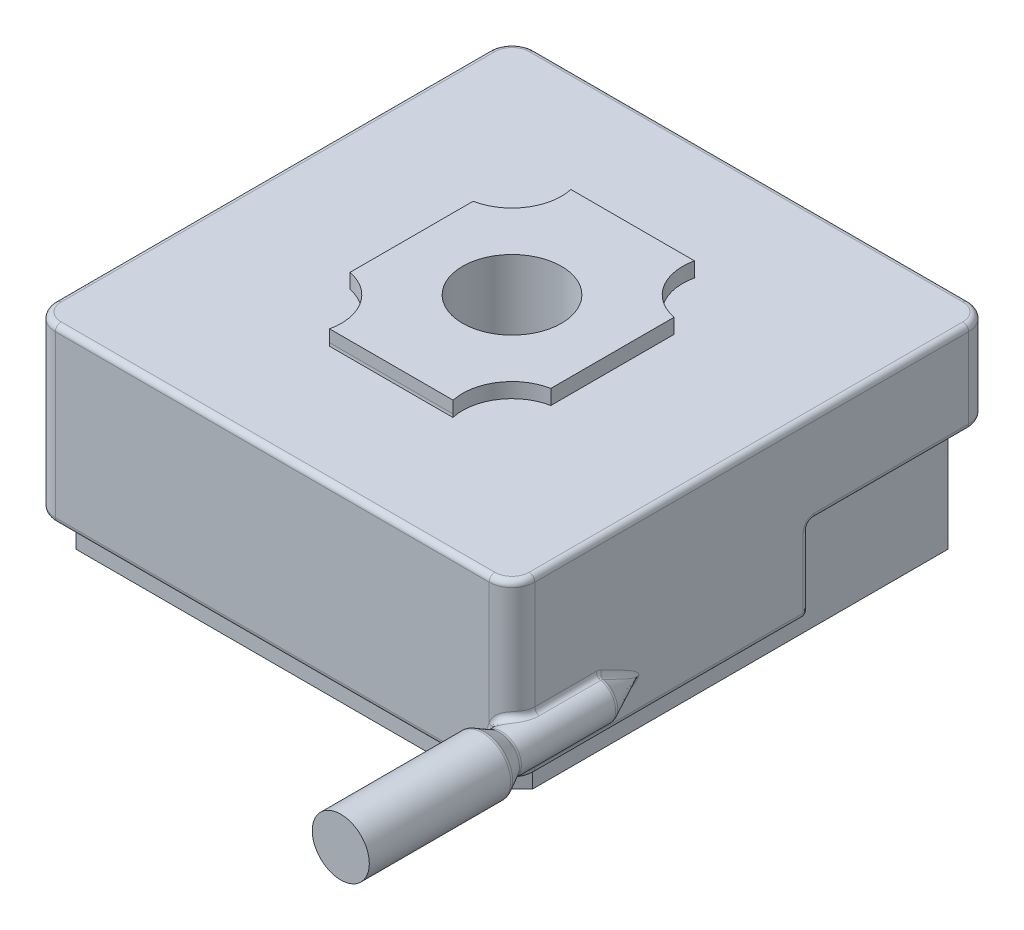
ISO-10303-21;
HEADER;
FILE_DESCRIPTION(('STEP AP214'),'2;1');
FILE_NAME('part.step','',(''),(''),'','','');
FILE_SCHEMA(('AUTOMOTIVE_DESIGN { 1 0 10303 214 1 1 1 1 }'));
ENDSEC;
DATA;
#1=APPLICATION_CONTEXT('core data for automotive mechanical design processes');
#2=APPLICATION_PROTOCOL_DEFINITION('international standard','automotive_design',2000,#1);
#3=PRODUCT_CONTEXT('',#1,'mechanical');
#4=PRODUCT('Part','Part','',(#3));
#5=PRODUCT_RELATED_PRODUCT_CATEGORY('part','',(#4));
#6=PRODUCT_DEFINITION_FORMATION('','',#4);
#7=PRODUCT_DEFINITION_CONTEXT('part definition',#1,'design');
#8=PRODUCT_DEFINITION('design','',#6,#7);
#9=PRODUCT_DEFINITION_SHAPE('','',#8);
#10=(LENGTH_UNIT() NAMED_UNIT(*) SI_UNIT(.MILLI.,.METRE.));
#11=(NAMED_UNIT(*) PLANE_ANGLE_UNIT() SI_UNIT($,.RADIAN.));
#12=(NAMED_UNIT(*) SI_UNIT($,.STERADIAN.) SOLID_ANGLE_UNIT());
#13=UNCERTAINTY_MEASURE_WITH_UNIT(LENGTH_MEASURE(1.E-05),#10,'distance_accuracy_value','');
#14=(GEOMETRIC_REPRESENTATION_CONTEXT(3) GLOBAL_UNCERTAINTY_ASSIGNED_CONTEXT((#13)) GLOBAL_UNIT_ASSIGNED_CONTEXT((#10,
#11,#12)) REPRESENTATION_CONTEXT('',''));
#15=CARTESIAN_POINT('',(0.,0.,0.));
#16=DIRECTION('',(0.,0.,1.));
#17=DIRECTION('',(1.,0.,0.));
#18=AXIS2_PLACEMENT_3D('',#15,#16,#17);
#19=CARTESIAN_POINT('',(53.34,19.05,91.44));
#20=DIRECTION('',(0.,0.,1.));
#21=DIRECTION('',(0.,-1.,0.));
#22=AXIS2_PLACEMENT_3D('',#19,#20,#21);
#23=PLANE('',#22);
#24=CARTESIAN_POINT('',(53.34,12.7,91.44));
#25=DIRECTION('',(0.,0.,-1.));
#26=DIRECTION('',(0.,1.,0.));
#27=AXIS2_PLACEMENT_3D('',#24,#25,#26);
#28=CIRCLE('',#27,6.35);
#29=CARTESIAN_POINT('',(53.34,19.05,91.44));
#30=VERTEX_POINT('',#29);
#31=EDGE_CURVE('E1880',#30,#30,#28,.T.);
#32=ORIENTED_EDGE('',*,*,#31,.F.);
#33=EDGE_LOOP('',(#32));
#34=FACE_BOUND('',#33,.T.);
#35=ADVANCED_FACE('F26',(#34),#23,.T.);
#36=CARTESIAN_POINT('',(53.34,12.7,29.9954547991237));
#37=DIRECTION('',(0.,0.,-1.));
#38=DIRECTION('',(0.,1.,0.));
#39=AXIS2_PLACEMENT_3D('',#36,#37,#38);
#40=CYLINDRICAL_SURFACE('',#39,6.35);
#41=CARTESIAN_POINT('',(53.34,12.7,60.0075));
#42=DIRECTION('',(0.,0.,1.));
#43=DIRECTION('',(0.,-1.,0.));
#44=AXIS2_PLACEMENT_3D('',#41,#42,#43);
#45=CIRCLE('',#44,6.35);
#46=CARTESIAN_POINT('',(53.34,6.34999999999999,60.0075));
#47=VERTEX_POINT('',#46);
#48=EDGE_CURVE('E1879',#47,#47,#45,.F.);
#49=ORIENTED_EDGE('',*,*,#48,.F.);
#50=EDGE_LOOP('',(#49));
#51=FACE_BOUND('',#50,.T.);
#52=ORIENTED_EDGE('',*,*,#31,.T.);
#53=EDGE_LOOP('',(#52));
#54=FACE_BOUND('',#53,.T.);
#55=ADVANCED_FACE('F1913',(#51,#54),#40,.T.);
#56=CARTESIAN_POINT('',(0.,16.129,0.));
#57=DIRECTION('',(0.,-1.,0.));
#58=DIRECTION('',(0.,0.,-1.));
#59=AXIS2_PLACEMENT_3D('',#56,#57,#58);
#60=PLANE('',#59);
#61=CARTESIAN_POINT('',(34.925,16.129,-34.925));
#62=DIRECTION('',(0.,-1.,0.));
#63=DIRECTION('',(0.,0.,-1.));
#64=AXIS2_PLACEMENT_3D('',#61,#62,#63);
#65=CIRCLE('',#64,6.79449999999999);
#66=CARTESIAN_POINT('',(34.925,16.129,-41.7195));
#67=VERTEX_POINT('',#66);
#68=EDGE_CURVE('E1877',#67,#67,#65,.T.);
#69=ORIENTED_EDGE('',*,*,#68,.T.);
#70=EDGE_LOOP('',(#69));
#71=FACE_BOUND('',#70,.T.);
#72=ADVANCED_FACE('F1910',(#71),#60,.T.);
#73=CARTESIAN_POINT('',(0.,16.129,0.));
#74=DIRECTION('',(0.,-1.,0.));
#75=DIRECTION('',(0.,0.,-1.));
#76=AXIS2_PLACEMENT_3D('',#73,#74,#75);
#77=PLANE('',#76);
#78=CARTESIAN_POINT('',(-34.925,16.129,-34.925));
#79=DIRECTION('',(0.,-1.,0.));
#80=DIRECTION('',(0.,0.,-1.));
#81=AXIS2_PLACEMENT_3D('',#78,#79,#80);
#82=CIRCLE('',#81,6.79449999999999);
#83=CARTESIAN_POINT('',(-34.925,16.129,-41.7195));
#84=VERTEX_POINT('',#83);
#85=EDGE_CURVE('E1874',#84,#84,#82,.T.);
#86=ORIENTED_EDGE('',*,*,#85,.T.);
#87=EDGE_LOOP('',(#86));
#88=FACE_BOUND('',#87,.T.);
#89=ADVANCED_FACE('F1906',(#88),#77,.T.);
#90=CARTESIAN_POINT('',(0.,16.129,0.));
#91=DIRECTION('',(0.,-1.,0.));
#92=DIRECTION('',(0.,0.,-1.));
#93=AXIS2_PLACEMENT_3D('',#90,#91,#92);
#94=PLANE('',#93);
#95=CARTESIAN_POINT('',(-34.925,16.129,34.925));
#96=DIRECTION('',(0.,-1.,0.));
#97=DIRECTION('',(0.,0.,-1.));
#98=AXIS2_PLACEMENT_3D('',#95,#96,#97);
#99=CIRCLE('',#98,6.79449999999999);
#100=CARTESIAN_POINT('',(-34.925,16.129,28.1305));
#101=VERTEX_POINT('',#100);
#102=EDGE_CURVE('E1871',#101,#101,#99,.T.);
#103=ORIENTED_EDGE('',*,*,#102,.T.);
#104=EDGE_LOOP('',(#103));
#105=FACE_BOUND('',#104,.T.);
#106=ADVANCED_FACE('F1902',(#105),#94,.T.);
#107=CARTESIAN_POINT('',(0.,16.129,0.));
#108=DIRECTION('',(0.,-1.,0.));
#109=DIRECTION('',(0.,0.,-1.));
#110=AXIS2_PLACEMENT_3D('',#107,#108,#109);
#111=PLANE('',#110);
#112=CARTESIAN_POINT('',(34.925,16.129,34.925));
#113=DIRECTION('',(0.,-1.,0.));
#114=DIRECTION('',(0.,0.,-1.));
#115=AXIS2_PLACEMENT_3D('',#112,#113,#114);
#116=CIRCLE('',#115,6.79449999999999);
#117=CARTESIAN_POINT('',(34.925,16.129,28.1305));
#118=VERTEX_POINT('',#117);
#119=EDGE_CURVE('E1867',#118,#118,#116,.T.);
#120=ORIENTED_EDGE('',*,*,#119,.T.);
#121=EDGE_LOOP('',(#120));
#122=FACE_BOUND('',#121,.T.);
#123=ADVANCED_FACE('F1898',(#122),#111,.T.);
#124=CARTESIAN_POINT('',(53.34,12.7,60.0075));
#125=DIRECTION('',(0.,0.,1.));
#126=DIRECTION('',(0.,-1.,0.));
#127=AXIS2_PLACEMENT_3D('',#124,#125,#126);
#128=TOROIDAL_SURFACE('',#127,5.08,1.27);
#129=ORIENTED_EDGE('',*,*,#48,.T.);
#130=EDGE_LOOP('',(#129));
#131=FACE_BOUND('',#130,.T.);
#132=CARTESIAN_POINT('',(53.34,12.7,59.4098529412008));
#133=DIRECTION('',(0.,0.,1.));
#134=DIRECTION('',(0.,-1.,0.));
#135=AXIS2_PLACEMENT_3D('',#132,#133,#134);
#136=CIRCLE('',#135,6.20058823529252);
#137=CARTESIAN_POINT('',(53.34,6.49941176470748,59.4098529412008));
#138=VERTEX_POINT('',#137);
#139=EDGE_CURVE('E1866',#138,#138,#136,.F.);
#140=ORIENTED_EDGE('',*,*,#139,.F.);
#141=EDGE_LOOP('',(#140));
#142=FACE_BOUND('',#141,.T.);
#143=ADVANCED_FACE('F1893',(#131,#142),#128,.T.);
#144=CARTESIAN_POINT('',(34.925,0.,-34.925));
#145=DIRECTION('',(0.,-1.,0.));
#146=DIRECTION('',(0.,0.,-1.));
#147=AXIS2_PLACEMENT_3D('',#144,#145,#146);
#148=CYLINDRICAL_SURFACE('',#147,6.79449999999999);
#149=CARTESIAN_POINT('',(34.925,0.,-34.925));
#150=DIRECTION('',(0.,-1.,0.));
#151=DIRECTION('',(0.,0.,-1.));
#152=AXIS2_PLACEMENT_3D('',#149,#150,#151);
#153=CIRCLE('',#152,6.79449999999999);
#154=CARTESIAN_POINT('',(34.925,0.,-41.7195));
#155=VERTEX_POINT('',#154);
#156=EDGE_CURVE('E1862',#155,#155,#153,.F.);
#157=ORIENTED_EDGE('',*,*,#156,.F.);
#158=EDGE_LOOP('',(#157));
#159=FACE_BOUND('',#158,.T.);
#160=ORIENTED_EDGE('',*,*,#68,.F.);
#161=EDGE_LOOP('',(#160));
#162=FACE_BOUND('',#161,.T.);
#163=ADVANCED_FACE('F1897',(#159,#162),#148,.F.);
#164=CARTESIAN_POINT('',(-34.925,0.,-34.925));
#165=DIRECTION('',(0.,-1.,0.));
#166=DIRECTION('',(0.,0.,-1.));
#167=AXIS2_PLACEMENT_3D('',#164,#165,#166);
#168=CYLINDRICAL_SURFACE('',#167,6.79449999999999);
#169=CARTESIAN_POINT('',(-34.925,0.,-34.925));
#170=DIRECTION('',(0.,-1.,0.));
#171=DIRECTION('',(0.,0.,-1.));
#172=AXIS2_PLACEMENT_3D('',#169,#170,#171);
#173=CIRCLE('',#172,6.79449999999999);
#174=CARTESIAN_POINT('',(-34.925,0.,-41.7195));
#175=VERTEX_POINT('',#174);
#176=EDGE_CURVE('E1859',#175,#175,#173,.F.);
#177=ORIENTED_EDGE('',*,*,#176,.F.);
#178=EDGE_LOOP('',(#177));
#179=FACE_BOUND('',#178,.T.);
#180=ORIENTED_EDGE('',*,*,#85,.F.);
#181=EDGE_LOOP('',(#180));
#182=FACE_BOUND('',#181,.T.);
#183=ADVANCED_FACE('F2063',(#179,#182),#168,.F.);
#184=CARTESIAN_POINT('',(-34.925,0.,34.925));
#185=DIRECTION('',(0.,-1.,0.));
#186=DIRECTION('',(0.,0.,-1.));
#187=AXIS2_PLACEMENT_3D('',#184,#185,#186);
#188=CYLINDRICAL_SURFACE('',#187,6.79449999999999);
#189=CARTESIAN_POINT('',(-34.925,0.,34.925));
#190=DIRECTION('',(0.,-1.,0.));
#191=DIRECTION('',(0.,0.,-1.));
#192=AXIS2_PLACEMENT_3D('',#189,#190,#191);
#193=CIRCLE('',#192,6.79449999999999);
#194=CARTESIAN_POINT('',(-34.925,0.,28.1305));
#195=VERTEX_POINT('',#194);
#196=EDGE_CURVE('E1856',#195,#195,#193,.F.);
#197=ORIENTED_EDGE('',*,*,#196,.F.);
#198=EDGE_LOOP('',(#197));
#199=FACE_BOUND('',#198,.T.);
#200=ORIENTED_EDGE('',*,*,#102,.F.);
#201=EDGE_LOOP('',(#200));
#202=FACE_BOUND('',#201,.T.);
#203=ADVANCED_FACE('F2047',(#199,#202),#188,.F.);
#204=CARTESIAN_POINT('',(34.925,0.,34.925));
#205=DIRECTION('',(0.,-1.,0.));
#206=DIRECTION('',(0.,0.,-1.));
#207=AXIS2_PLACEMENT_3D('',#204,#205,#206);
#208=CYLINDRICAL_SURFACE('',#207,6.79449999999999);
#209=CARTESIAN_POINT('',(34.925,0.,34.925));
#210=DIRECTION('',(0.,-1.,0.));
#211=DIRECTION('',(0.,0.,-1.));
#212=AXIS2_PLACEMENT_3D('',#209,#210,#211);
#213=CIRCLE('',#212,6.79449999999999);
#214=CARTESIAN_POINT('',(34.925,0.,28.1305));
#215=VERTEX_POINT('',#214);
#216=EDGE_CURVE('E1006',#215,#215,#213,.F.);
#217=ORIENTED_EDGE('',*,*,#216,.F.);
#218=EDGE_LOOP('',(#217));
#219=FACE_BOUND('',#218,.T.);
#220=ORIENTED_EDGE('',*,*,#119,.F.);
#221=EDGE_LOOP('',(#220));
#222=FACE_BOUND('',#221,.T.);
#223=ADVANCED_FACE('F2012',(#219,#222),#208,.F.);
#224=CARTESIAN_POINT('',(-50.8,46.736,46.1867661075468));
#225=DIRECTION('',(0.707106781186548,0.,-0.707106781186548));
#226=DIRECTION('',(-0.707106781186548,0.,-0.707106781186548));
#227=AXIS2_PLACEMENT_3D('',#224,#225,#226);
#228=PLANE('',#227);
#229=DIRECTION('',(-0.707106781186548,0.,-0.707106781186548));
#230=VECTOR('',#229,1.);
#231=CARTESIAN_POINT('',(-50.8,3.81,46.1867661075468));
#232=LINE('',#231,#230);
#233=CARTESIAN_POINT('',(-46.1867661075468,3.81,50.8));
#234=VERTEX_POINT('',#233);
#235=CARTESIAN_POINT('',(-50.8,3.81,46.1867661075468));
#236=VERTEX_POINT('',#235);
#237=EDGE_CURVE('E970',#234,#236,#232,.T.);
#238=ORIENTED_EDGE('',*,*,#237,.T.);
#239=DIRECTION('',(0.,1.,0.));
#240=VECTOR('',#239,1.);
#241=CARTESIAN_POINT('',(-50.8,46.736,46.1867661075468));
#242=LINE('',#241,#240);
#243=CARTESIAN_POINT('',(-50.8,0.,46.1867661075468));
#244=VERTEX_POINT('',#243);
#245=EDGE_CURVE('E983',#236,#244,#242,.F.);
#246=ORIENTED_EDGE('',*,*,#245,.T.);
#247=DIRECTION('',(-0.707106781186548,0.,-0.707106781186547));
#248=VECTOR('',#247,1.);
#249=CARTESIAN_POINT('',(-46.1867661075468,0.,50.8));
#250=LINE('',#249,#248);
#251=CARTESIAN_POINT('',(-46.1867661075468,0.,50.8));
#252=VERTEX_POINT('',#251);
#253=EDGE_CURVE('E1001',#252,#244,#250,.T.);
#254=ORIENTED_EDGE('',*,*,#253,.F.);
#255=DIRECTION('',(0.,1.,0.));
#256=VECTOR('',#255,1.);
#257=CARTESIAN_POINT('',(-46.1867661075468,46.736,50.8));
#258=LINE('',#257,#256);
#259=EDGE_CURVE('E2949',#252,#234,#258,.T.);
#260=ORIENTED_EDGE('',*,*,#259,.T.);
#261=EDGE_LOOP('',(#238,#246,#254,#260));
#262=FACE_BOUND('',#261,.T.);
#263=ADVANCED_FACE('F2006',(#262),#228,.F.);
#264=CARTESIAN_POINT('',(46.1867661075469,46.736,50.8));
#265=DIRECTION('',(-0.707106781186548,0.,-0.707106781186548));
#266=DIRECTION('',(-0.707106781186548,0.,0.707106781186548));
#267=AXIS2_PLACEMENT_3D('',#264,#265,#266);
#268=PLANE('',#267);
#269=DIRECTION('',(-0.707106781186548,0.,0.707106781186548));
#270=VECTOR('',#269,1.);
#271=CARTESIAN_POINT('',(46.1867661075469,3.81,50.8));
#272=LINE('',#271,#270);
#273=CARTESIAN_POINT('',(50.8,3.81,46.1867661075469));
#274=VERTEX_POINT('',#273);
#275=CARTESIAN_POINT('',(46.1867661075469,3.81,50.8));
#276=VERTEX_POINT('',#275);
#277=EDGE_CURVE('E918',#274,#276,#272,.T.);
#278=ORIENTED_EDGE('',*,*,#277,.T.);
#279=DIRECTION('',(0.,1.,0.));
#280=VECTOR('',#279,1.);
#281=CARTESIAN_POINT('',(46.1867661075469,46.736,50.8));
#282=LINE('',#281,#280);
#283=CARTESIAN_POINT('',(46.1867661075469,0.,50.8));
#284=VERTEX_POINT('',#283);
#285=EDGE_CURVE('E1276',#276,#284,#282,.F.);
#286=ORIENTED_EDGE('',*,*,#285,.T.);
#287=DIRECTION('',(-0.707106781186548,0.,0.707106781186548));
#288=VECTOR('',#287,1.);
#289=CARTESIAN_POINT('',(50.8,0.,46.1867661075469));
#290=LINE('',#289,#288);
#291=CARTESIAN_POINT('',(50.8,0.,46.1867661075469));
#292=VERTEX_POINT('',#291);
#293=EDGE_CURVE('E893',#292,#284,#290,.T.);
#294=ORIENTED_EDGE('',*,*,#293,.F.);
#295=DIRECTION('',(0.,1.,0.));
#296=VECTOR('',#295,1.);
#297=CARTESIAN_POINT('',(50.8,46.736,46.1867661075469));
#298=LINE('',#297,#296);
#299=EDGE_CURVE('E879',#292,#274,#298,.T.);
#300=ORIENTED_EDGE('',*,*,#299,.T.);
#301=EDGE_LOOP('',(#278,#286,#294,#300));
#302=FACE_BOUND('',#301,.T.);
#303=ADVANCED_FACE('F2011',(#302),#268,.F.);
#304=CARTESIAN_POINT('',(53.34,12.7,59.4098529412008));
#305=DIRECTION('',(0.,0.,1.));
#306=DIRECTION('',(1.,0.,0.));
#307=AXIS2_PLACEMENT_3D('',#304,#305,#306);
#308=CONICAL_SURFACE('',#307,6.20058823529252,0.489957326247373);
#309=ORIENTED_EDGE('',*,*,#139,.T.);
#310=EDGE_LOOP('',(#309));
#311=FACE_BOUND('',#310,.T.);
#312=CARTESIAN_POINT('',(53.34,12.7,56.1601470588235));
#313=DIRECTION('',(0.,0.,-1.));
#314=DIRECTION('',(0.,1.,0.));
#315=AXIS2_PLACEMENT_3D('',#312,#313,#314);
#316=CIRCLE('',#315,4.46741176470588);
#317=CARTESIAN_POINT('',(53.34,17.1674117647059,56.1601470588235));
#318=VERTEX_POINT('',#317);
#319=EDGE_CURVE('E865',#318,#318,#316,.F.);
#320=ORIENTED_EDGE('',*,*,#319,.T.);
#321=EDGE_LOOP('',(#320));
#322=FACE_BOUND('',#321,.T.);
#323=ADVANCED_FACE('F1991',(#311,#322),#308,.T.);
#324=CARTESIAN_POINT('',(-50.8,46.736,-46.1867661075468));
#325=DIRECTION('',(0.707106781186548,0.,0.707106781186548));
#326=DIRECTION('',(0.707106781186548,0.,-0.707106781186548));
#327=AXIS2_PLACEMENT_3D('',#324,#325,#326);
#328=PLANE('',#327);
#329=DIRECTION('',(0.707106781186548,0.,-0.707106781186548));
#330=VECTOR('',#329,1.);
#331=CARTESIAN_POINT('',(-96.7533830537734,21.844,-0.233383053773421));
#332=LINE('',#331,#330);
#333=CARTESIAN_POINT('',(-50.8,21.844,-46.1867661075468));
#334=VERTEX_POINT('',#333);
#335=CARTESIAN_POINT('',(-46.1867661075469,21.844,-50.8));
#336=VERTEX_POINT('',#335);
#337=EDGE_CURVE('E996',#334,#336,#332,.T.);
#338=ORIENTED_EDGE('',*,*,#337,.T.);
#339=DIRECTION('',(0.,1.,0.));
#340=VECTOR('',#339,1.);
#341=CARTESIAN_POINT('',(-46.1867661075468,46.736,-50.8));
#342=LINE('',#341,#340);
#343=CARTESIAN_POINT('',(-46.1867661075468,0.,-50.8));
#344=VERTEX_POINT('',#343);
#345=EDGE_CURVE('E2809',#336,#344,#342,.F.);
#346=ORIENTED_EDGE('',*,*,#345,.T.);
#347=DIRECTION('',(0.707106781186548,0.,-0.707106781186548));
#348=VECTOR('',#347,1.);
#349=CARTESIAN_POINT('',(-50.8,0.,-46.1867661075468));
#350=LINE('',#349,#348);
#351=CARTESIAN_POINT('',(-50.8,0.,-46.1867661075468));
#352=VERTEX_POINT('',#351);
#353=EDGE_CURVE('E999',#352,#344,#350,.T.);
#354=ORIENTED_EDGE('',*,*,#353,.F.);
#355=DIRECTION('',(0.,1.,0.));
#356=VECTOR('',#355,1.);
#357=CARTESIAN_POINT('',(-50.8,46.736,-46.1867661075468));
#358=LINE('',#357,#356);
#359=EDGE_CURVE('E963',#352,#334,#358,.T.);
#360=ORIENTED_EDGE('',*,*,#359,.T.);
#361=EDGE_LOOP('',(#338,#346,#354,#360));
#362=FACE_BOUND('',#361,.T.);
#363=ADVANCED_FACE('F1952',(#362),#328,.F.);
#364=CARTESIAN_POINT('',(46.1867661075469,46.736,-50.8));
#365=DIRECTION('',(-0.707106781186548,0.,0.707106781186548));
#366=DIRECTION('',(0.707106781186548,0.,0.707106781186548));
#367=AXIS2_PLACEMENT_3D('',#364,#365,#366);
#368=PLANE('',#367);
#369=DIRECTION('',(0.707106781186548,0.,0.707106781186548));
#370=VECTOR('',#369,1.);
#371=CARTESIAN_POINT('',(48.4933830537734,21.844,-48.4933830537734));
#372=LINE('',#371,#370);
#373=CARTESIAN_POINT('',(46.1867661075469,21.844,-50.8));
#374=VERTEX_POINT('',#373);
#375=CARTESIAN_POINT('',(50.8,21.844,-46.1867661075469));
#376=VERTEX_POINT('',#375);
#377=EDGE_CURVE('E1420',#374,#376,#372,.T.);
#378=ORIENTED_EDGE('',*,*,#377,.T.);
#379=DIRECTION('',(0.,1.,0.));
#380=VECTOR('',#379,1.);
#381=CARTESIAN_POINT('',(50.8,46.736,-46.1867661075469));
#382=LINE('',#381,#380);
#383=CARTESIAN_POINT('',(50.8,0.,-46.1867661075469));
#384=VERTEX_POINT('',#383);
#385=EDGE_CURVE('E874',#376,#384,#382,.F.);
#386=ORIENTED_EDGE('',*,*,#385,.T.);
#387=DIRECTION('',(0.707106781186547,0.,0.707106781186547));
#388=VECTOR('',#387,1.);
#389=CARTESIAN_POINT('',(46.1867661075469,0.,-50.8));
#390=LINE('',#389,#388);
#391=CARTESIAN_POINT('',(46.1867661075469,0.,-50.8));
#392=VERTEX_POINT('',#391);
#393=EDGE_CURVE('E1004',#392,#384,#390,.T.);
#394=ORIENTED_EDGE('',*,*,#393,.F.);
#395=DIRECTION('',(0.,1.,0.));
#396=VECTOR('',#395,1.);
#397=CARTESIAN_POINT('',(46.1867661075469,46.736,-50.8));
#398=LINE('',#397,#396);
#399=EDGE_CURVE('E995',#392,#374,#398,.T.);
#400=ORIENTED_EDGE('',*,*,#399,.T.);
#401=EDGE_LOOP('',(#378,#386,#394,#400));
#402=FACE_BOUND('',#401,.T.);
#403=ADVANCED_FACE('F1946',(#402),#368,.F.);
#404=CARTESIAN_POINT('',(0.,0.,0.));
#405=DIRECTION('',(0.,-1.,0.));
#406=DIRECTION('',(0.,0.,-1.));
#407=AXIS2_PLACEMENT_3D('',#404,#405,#406);
#408=PLANE('',#407);
#409=CARTESIAN_POINT('',(0.,0.,0.));
#410=DIRECTION('',(0.,-1.,0.));
#411=DIRECTION('',(0.,0.,-1.));
#412=AXIS2_PLACEMENT_3D('',#409,#410,#411);
#413=CIRCLE('',#412,25.4);
#414=CARTESIAN_POINT('',(0.,0.,-25.4));
#415=VERTEX_POINT('',#414);
#416=EDGE_CURVE('E1406',#415,#415,#413,.F.);
#417=ORIENTED_EDGE('',*,*,#416,.T.);
#418=EDGE_LOOP('',(#417));
#419=FACE_BOUND('',#418,.T.);
#420=DIRECTION('',(0.,0.,-1.));
#421=VECTOR('',#420,1.);
#422=CARTESIAN_POINT('',(-50.8,0.,-46.1867661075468));
#423=LINE('',#422,#421);
#424=EDGE_CURVE('E971',#244,#352,#423,.T.);
#425=ORIENTED_EDGE('',*,*,#424,.T.);
#426=ORIENTED_EDGE('',*,*,#353,.T.);
#427=DIRECTION('',(1.,0.,0.));
#428=VECTOR('',#427,1.);
#429=CARTESIAN_POINT('',(-46.1867661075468,0.,-50.8));
#430=LINE('',#429,#428);
#431=EDGE_CURVE('E992',#344,#392,#430,.T.);
#432=ORIENTED_EDGE('',*,*,#431,.T.);
#433=ORIENTED_EDGE('',*,*,#393,.T.);
#434=DIRECTION('',(0.,0.,1.));
#435=VECTOR('',#434,1.);
#436=CARTESIAN_POINT('',(50.8,0.,-46.1867661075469));
#437=LINE('',#436,#435);
#438=EDGE_CURVE('E875',#384,#292,#437,.T.);
#439=ORIENTED_EDGE('',*,*,#438,.T.);
#440=ORIENTED_EDGE('',*,*,#293,.T.);
#441=DIRECTION('',(-1.,0.,0.));
#442=VECTOR('',#441,1.);
#443=CARTESIAN_POINT('',(-46.1867661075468,0.,50.8));
#444=LINE('',#443,#442);
#445=EDGE_CURVE('E2947',#284,#252,#444,.T.);
#446=ORIENTED_EDGE('',*,*,#445,.T.);
#447=ORIENTED_EDGE('',*,*,#253,.T.);
#448=EDGE_LOOP('',(#425,#426,#432,#433,#439,#440,#446,#447));
#449=FACE_BOUND('',#448,.T.);
#450=ORIENTED_EDGE('',*,*,#216,.T.);
#451=EDGE_LOOP('',(#450));
#452=FACE_BOUND('',#451,.T.);
#453=ORIENTED_EDGE('',*,*,#196,.T.);
#454=EDGE_LOOP('',(#453));
#455=FACE_BOUND('',#454,.T.);
#456=ORIENTED_EDGE('',*,*,#176,.T.);
#457=EDGE_LOOP('',(#456));
#458=FACE_BOUND('',#457,.T.);
#459=ORIENTED_EDGE('',*,*,#156,.T.);
#460=EDGE_LOOP('',(#459));
#461=FACE_BOUND('',#460,.T.);
#462=ADVANCED_FACE('F1951',(#419,#449,#452,#455,#458,#461),#408,.T.);
#463=CARTESIAN_POINT('',(-52.07,6.34999999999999,-11.43));
#464=DIRECTION('',(1.,0.,0.));
#465=DIRECTION('',(0.,0.,-1.));
#466=AXIS2_PLACEMENT_3D('',#463,#464,#465);
#467=TOROIDAL_SURFACE('',#466,2.54,1.27);
#468=CARTESIAN_POINT('',(-52.07,6.35,-11.43));
#469=DIRECTION('',(1.,0.,0.));
#470=DIRECTION('',(0.,0.,-1.));
#471=AXIS2_PLACEMENT_3D('',#468,#469,#470);
#472=CIRCLE('',#471,1.27);
#473=CARTESIAN_POINT('',(-52.07,6.35,-12.7));
#474=VERTEX_POINT('',#473);
#475=CARTESIAN_POINT('',(-52.07,5.08,-11.43));
#476=VERTEX_POINT('',#475);
#477=EDGE_CURVE('E1369',#474,#476,#472,.F.);
#478=ORIENTED_EDGE('',*,*,#477,.F.);
#479=CARTESIAN_POINT('',(-52.07,6.34999999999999,-13.97));
#480=DIRECTION('',(0.,1.,0.));
#481=DIRECTION('',(0.,0.,1.));
#482=AXIS2_PLACEMENT_3D('',#479,#480,#481);
#483=CIRCLE('',#482,1.27);
#484=CARTESIAN_POINT('',(-50.8,6.34999999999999,-13.97));
#485=VERTEX_POINT('',#484);
#486=EDGE_CURVE('E979',#474,#485,#483,.T.);
#487=ORIENTED_EDGE('',*,*,#486,.T.);
#488=CARTESIAN_POINT('',(-50.8,6.34999999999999,-11.43));
#489=DIRECTION('',(-1.,0.,0.));
#490=DIRECTION('',(0.,0.,-1.));
#491=AXIS2_PLACEMENT_3D('',#488,#489,#490);
#492=CIRCLE('',#491,2.53999999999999);
#493=CARTESIAN_POINT('',(-50.8,3.81,-11.43));
#494=VERTEX_POINT('',#493);
#495=EDGE_CURVE('E985',#485,#494,#492,.T.);
#496=ORIENTED_EDGE('',*,*,#495,.T.);
#497=CARTESIAN_POINT('',(-52.07,3.81,-11.43));
#498=DIRECTION('',(0.,0.,-1.));
#499=DIRECTION('',(-1.,0.,0.));
#500=AXIS2_PLACEMENT_3D('',#497,#498,#499);
#501=CIRCLE('',#500,1.27);
#502=EDGE_CURVE('E170',#494,#476,#501,.F.);
#503=ORIENTED_EDGE('',*,*,#502,.T.);
#504=EDGE_LOOP('',(#478,#487,#496,#503));
#505=FACE_BOUND('',#504,.T.);
#506=ADVANCED_FACE('F951',(#505),#467,.F.);
#507=CARTESIAN_POINT('',(-50.8,46.736,-46.1867661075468));
#508=DIRECTION('',(1.,0.,0.));
#509=DIRECTION('',(0.,0.,-1.));
#510=AXIS2_PLACEMENT_3D('',#507,#508,#509);
#511=PLANE('',#510);
#512=DIRECTION('',(0.,0.,-1.));
#513=VECTOR('',#512,1.);
#514=CARTESIAN_POINT('',(-50.8,21.844,48.26));
#515=LINE('',#514,#513);
#516=CARTESIAN_POINT('',(-50.8,21.844,-13.97));
#517=VERTEX_POINT('',#516);
#518=EDGE_CURVE('E1769',#517,#334,#515,.T.);
#519=ORIENTED_EDGE('',*,*,#518,.T.);
#520=ORIENTED_EDGE('',*,*,#359,.F.);
#521=ORIENTED_EDGE('',*,*,#424,.F.);
#522=ORIENTED_EDGE('',*,*,#245,.F.);
#523=DIRECTION('',(0.,0.,-1.));
#524=VECTOR('',#523,1.);
#525=CARTESIAN_POINT('',(-50.8,3.81,-46.1867661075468));
#526=LINE('',#525,#524);
#527=EDGE_CURVE('E1849',#236,#494,#526,.T.);
#528=ORIENTED_EDGE('',*,*,#527,.T.);
#529=ORIENTED_EDGE('',*,*,#495,.F.);
#530=DIRECTION('',(0.,1.,0.));
#531=VECTOR('',#530,1.);
#532=CARTESIAN_POINT('',(-50.8,46.736,-13.97));
#533=LINE('',#532,#531);
#534=EDGE_CURVE('E974',#485,#517,#533,.T.);
#535=ORIENTED_EDGE('',*,*,#534,.T.);
#536=EDGE_LOOP('',(#519,#520,#521,#522,#528,#529,#535));
#537=FACE_BOUND('',#536,.T.);
#538=ADVANCED_FACE('F947',(#537),#511,.F.);
#539=CARTESIAN_POINT('',(-51.6980256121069,3.81,47.0847917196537));
#540=DIRECTION('',(-0.707106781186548,0.,-0.707106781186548));
#541=DIRECTION('',(-0.707106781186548,0.,0.707106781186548));
#542=AXIS2_PLACEMENT_3D('',#539,#540,#541);
#543=CYLINDRICAL_SURFACE('',#542,1.27);
#544=DIRECTION('',(0.707106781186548,0.,0.707106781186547));
#545=VECTOR('',#544,1.);
#546=CARTESIAN_POINT('',(-52.07,5.08,46.7128173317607));
#547=LINE('',#546,#545);
#548=CARTESIAN_POINT('',(-52.07,5.08,46.7128173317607));
#549=VERTEX_POINT('',#548);
#550=CARTESIAN_POINT('',(-46.7128173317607,5.08,52.07));
#551=VERTEX_POINT('',#550);
#552=EDGE_CURVE('E160',#549,#551,#547,.T.);
#553=ORIENTED_EDGE('',*,*,#552,.F.);
#554=CARTESIAN_POINT('',(-52.07,3.81,46.7128173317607));
#555=DIRECTION('',(-0.38268343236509,0.,-0.923879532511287));
#556=DIRECTION('',(-0.923879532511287,0.,0.38268343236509));
#557=AXIS2_PLACEMENT_3D('',#554,#555,#556);
#558=ELLIPSE('',#557,1.37463809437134,1.27);
#559=EDGE_CURVE('E1847',#549,#236,#558,.T.);
#560=ORIENTED_EDGE('',*,*,#559,.T.);
#561=ORIENTED_EDGE('',*,*,#237,.F.);
#562=CARTESIAN_POINT('',(-46.7128173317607,3.81,52.07));
#563=DIRECTION('',(-0.923879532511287,0.,-0.38268343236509));
#564=DIRECTION('',(0.38268343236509,0.,-0.923879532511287));
#565=AXIS2_PLACEMENT_3D('',#562,#563,#564);
#566=ELLIPSE('',#565,1.37463809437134,1.27);
#567=EDGE_CURVE('E1845',#234,#551,#566,.F.);
#568=ORIENTED_EDGE('',*,*,#567,.T.);
#569=EDGE_LOOP('',(#553,#560,#561,#568));
#570=FACE_BOUND('',#569,.T.);
#571=ADVANCED_FACE('F943',(#570),#543,.F.);
#572=CARTESIAN_POINT('',(-46.1867661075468,46.736,50.8));
#573=DIRECTION('',(0.,0.,-1.));
#574=DIRECTION('',(-1.,0.,0.));
#575=AXIS2_PLACEMENT_3D('',#572,#573,#574);
#576=PLANE('',#575);
#577=DIRECTION('',(-1.,0.,0.));
#578=VECTOR('',#577,1.);
#579=CARTESIAN_POINT('',(-46.1867661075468,3.81,50.8));
#580=LINE('',#579,#578);
#581=EDGE_CURVE('E1310',#276,#234,#580,.T.);
#582=ORIENTED_EDGE('',*,*,#581,.T.);
#583=ORIENTED_EDGE('',*,*,#259,.F.);
#584=ORIENTED_EDGE('',*,*,#445,.F.);
#585=ORIENTED_EDGE('',*,*,#285,.F.);
#586=EDGE_LOOP('',(#582,#583,#584,#585));
#587=FACE_BOUND('',#586,.T.);
#588=ADVANCED_FACE('F940',(#587),#576,.F.);
#589=CARTESIAN_POINT('',(0.,5.08,0.));
#590=DIRECTION('',(0.,-1.,0.));
#591=DIRECTION('',(0.,0.,-1.));
#592=AXIS2_PLACEMENT_3D('',#589,#590,#591);
#593=PLANE('',#592);
#594=CARTESIAN_POINT('',(48.26,5.08,48.26));
#595=DIRECTION('',(0.,1.,0.));
#596=DIRECTION('',(0.,0.,1.));
#597=AXIS2_PLACEMENT_3D('',#594,#595,#596);
#598=CIRCLE('',#597,3.81);
#599=CARTESIAN_POINT('',(48.26,5.08,52.07));
#600=VERTEX_POINT('',#599);
#601=CARTESIAN_POINT('',(52.07,5.08,48.26));
#602=VERTEX_POINT('',#601);
#603=EDGE_CURVE('E925',#600,#602,#598,.T.);
#604=ORIENTED_EDGE('',*,*,#603,.F.);
#605=DIRECTION('',(1.,0.,0.));
#606=VECTOR('',#605,1.);
#607=CARTESIAN_POINT('',(0.,5.08,52.07));
#608=LINE('',#607,#606);
#609=CARTESIAN_POINT('',(46.7128173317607,5.08,52.07));
#610=VERTEX_POINT('',#609);
#611=EDGE_CURVE('E920',#600,#610,#608,.F.);
#612=ORIENTED_EDGE('',*,*,#611,.T.);
#613=DIRECTION('',(-0.707106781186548,0.,0.707106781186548));
#614=VECTOR('',#613,1.);
#615=CARTESIAN_POINT('',(47.0847917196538,5.08,51.6980256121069));
#616=LINE('',#615,#614);
#617=CARTESIAN_POINT('',(52.07,5.08,46.7128173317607));
#618=VERTEX_POINT('',#617);
#619=EDGE_CURVE('E880',#610,#618,#616,.F.);
#620=ORIENTED_EDGE('',*,*,#619,.T.);
#621=DIRECTION('',(0.,0.,-1.));
#622=VECTOR('',#621,1.);
#623=CARTESIAN_POINT('',(52.07,5.08,0.));
#624=LINE('',#623,#622);
#625=EDGE_CURVE('E2948',#618,#602,#624,.F.);
#626=ORIENTED_EDGE('',*,*,#625,.T.);
#627=EDGE_LOOP('',(#604,#612,#620,#626));
#628=FACE_BOUND('',#627,.T.);
#629=ADVANCED_FACE('F931',(#628),#593,.T.);
#630=CARTESIAN_POINT('',(47.0847917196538,3.81,51.6980256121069));
#631=DIRECTION('',(-0.707106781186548,0.,0.707106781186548));
#632=DIRECTION('',(0.707106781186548,0.,0.707106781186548));
#633=AXIS2_PLACEMENT_3D('',#630,#631,#632);
#634=CYLINDRICAL_SURFACE('',#633,1.27);
#635=ORIENTED_EDGE('',*,*,#619,.F.);
#636=CARTESIAN_POINT('',(46.7128173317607,3.81,52.07));
#637=DIRECTION('',(-0.923879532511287,0.,0.38268343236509));
#638=DIRECTION('',(0.38268343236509,0.,0.923879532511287));
#639=AXIS2_PLACEMENT_3D('',#636,#637,#638);
#640=ELLIPSE('',#639,1.37463809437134,1.27);
#641=EDGE_CURVE('E1320',#610,#276,#640,.T.);
#642=ORIENTED_EDGE('',*,*,#641,.T.);
#643=ORIENTED_EDGE('',*,*,#277,.F.);
#644=CARTESIAN_POINT('',(52.07,3.81,46.7128173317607));
#645=DIRECTION('',(-0.38268343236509,0.,0.923879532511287));
#646=DIRECTION('',(-0.923879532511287,0.,-0.38268343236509));
#647=AXIS2_PLACEMENT_3D('',#644,#645,#646);
#648=ELLIPSE('',#647,1.37463809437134,1.27);
#649=EDGE_CURVE('E1236',#274,#618,#648,.F.);
#650=ORIENTED_EDGE('',*,*,#649,.T.);
#651=EDGE_LOOP('',(#635,#642,#643,#650));
#652=FACE_BOUND('',#651,.T.);
#653=ADVANCED_FACE('F907',(#652),#634,.F.);
#654=CARTESIAN_POINT('',(52.07,6.34999999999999,-11.43));
#655=DIRECTION('',(-1.,0.,0.));
#656=DIRECTION('',(0.,0.,1.));
#657=AXIS2_PLACEMENT_3D('',#654,#655,#656);
#658=TOROIDAL_SURFACE('',#657,2.54,1.27);
#659=CARTESIAN_POINT('',(52.07,6.35,-11.43));
#660=DIRECTION('',(1.,0.,0.));
#661=DIRECTION('',(0.,0.,-1.));
#662=AXIS2_PLACEMENT_3D('',#659,#660,#661);
#663=CIRCLE('',#662,1.27);
#664=CARTESIAN_POINT('',(52.07,5.08,-11.4300000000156));
#665=VERTEX_POINT('',#664);
#666=CARTESIAN_POINT('',(52.07,6.35,-12.7));
#667=VERTEX_POINT('',#666);
#668=EDGE_CURVE('E2999',#665,#667,#663,.T.);
#669=ORIENTED_EDGE('',*,*,#668,.F.);
#670=CARTESIAN_POINT('',(52.07,3.81,-11.43));
#671=DIRECTION('',(0.,0.,1.));
#672=DIRECTION('',(1.,0.,0.));
#673=AXIS2_PLACEMENT_3D('',#670,#671,#672);
#674=CIRCLE('',#673,1.27);
#675=CARTESIAN_POINT('',(50.8,3.81,-11.43));
#676=VERTEX_POINT('',#675);
#677=EDGE_CURVE('E1233',#665,#676,#674,.T.);
#678=ORIENTED_EDGE('',*,*,#677,.T.);
#679=CARTESIAN_POINT('',(50.8,6.34999999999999,-11.43));
#680=DIRECTION('',(1.,0.,0.));
#681=DIRECTION('',(0.,-1.,0.));
#682=AXIS2_PLACEMENT_3D('',#679,#680,#681);
#683=CIRCLE('',#682,2.54);
#684=CARTESIAN_POINT('',(50.8,6.34999999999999,-13.97));
#685=VERTEX_POINT('',#684);
#686=EDGE_CURVE('E887',#676,#685,#683,.T.);
#687=ORIENTED_EDGE('',*,*,#686,.T.);
#688=CARTESIAN_POINT('',(52.07,6.34999999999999,-13.97));
#689=DIRECTION('',(0.,-1.,0.));
#690=DIRECTION('',(0.,0.,-1.));
#691=AXIS2_PLACEMENT_3D('',#688,#689,#690);
#692=CIRCLE('',#691,1.27);
#693=EDGE_CURVE('E1263',#685,#667,#692,.F.);
#694=ORIENTED_EDGE('',*,*,#693,.T.);
#695=EDGE_LOOP('',(#669,#678,#687,#694));
#696=FACE_BOUND('',#695,.T.);
#697=ADVANCED_FACE('F895',(#696),#658,.F.);
#698=CARTESIAN_POINT('',(50.8,46.736,-46.1867661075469));
#699=DIRECTION('',(-1.,0.,0.));
#700=DIRECTION('',(0.,0.,1.));
#701=AXIS2_PLACEMENT_3D('',#698,#699,#700);
#702=PLANE('',#701);
#703=DIRECTION('',(0.,0.,1.));
#704=VECTOR('',#703,1.);
#705=CARTESIAN_POINT('',(50.8,21.844,48.26));
#706=LINE('',#705,#704);
#707=CARTESIAN_POINT('',(50.8,21.844,-13.97));
#708=VERTEX_POINT('',#707);
#709=EDGE_CURVE('E1841',#376,#708,#706,.T.);
#710=ORIENTED_EDGE('',*,*,#709,.T.);
#711=DIRECTION('',(0.,-1.,0.));
#712=VECTOR('',#711,1.);
#713=CARTESIAN_POINT('',(50.8,46.736,-13.97));
#714=LINE('',#713,#712);
#715=EDGE_CURVE('E1256',#708,#685,#714,.T.);
#716=ORIENTED_EDGE('',*,*,#715,.T.);
#717=ORIENTED_EDGE('',*,*,#686,.F.);
#718=DIRECTION('',(0.,0.,1.));
#719=VECTOR('',#718,1.);
#720=CARTESIAN_POINT('',(50.8,3.81,-46.1867661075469));
#721=LINE('',#720,#719);
#722=EDGE_CURVE('E1235',#676,#274,#721,.T.);
#723=ORIENTED_EDGE('',*,*,#722,.T.);
#724=ORIENTED_EDGE('',*,*,#299,.F.);
#725=ORIENTED_EDGE('',*,*,#438,.F.);
#726=ORIENTED_EDGE('',*,*,#385,.F.);
#727=EDGE_LOOP('',(#710,#716,#717,#723,#724,#725,#726));
#728=FACE_BOUND('',#727,.T.);
#729=ADVANCED_FACE('F906',(#728),#702,.F.);
#730=CARTESIAN_POINT('',(53.34,12.7,55.5625));
#731=DIRECTION('',(0.,0.,-1.));
#732=DIRECTION('',(0.,1.,0.));
#733=AXIS2_PLACEMENT_3D('',#730,#731,#732);
#734=TOROIDAL_SURFACE('',#733,5.588,1.27);
#735=CARTESIAN_POINT('',(53.34,12.7,55.5625));
#736=DIRECTION('',(0.,0.,-1.));
#737=DIRECTION('',(0.,1.,0.));
#738=AXIS2_PLACEMENT_3D('',#735,#736,#737);
#739=CIRCLE('',#738,4.318);
#740=CARTESIAN_POINT('',(53.34,17.018,55.5625));
#741=VERTEX_POINT('',#740);
#742=EDGE_CURVE('E2885',#741,#741,#739,.T.);
#743=ORIENTED_EDGE('',*,*,#742,.F.);
#744=EDGE_LOOP('',(#743));
#745=FACE_BOUND('',#744,.T.);
#746=ORIENTED_EDGE('',*,*,#319,.F.);
#747=EDGE_LOOP('',(#746));
#748=FACE_BOUND('',#747,.T.);
#749=ADVANCED_FACE('F1938',(#745,#748),#734,.F.);
#750=CARTESIAN_POINT('',(53.34,12.7,34.5821114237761));
#751=DIRECTION('',(0.,0.,1.));
#752=DIRECTION('',(0.,-1.,0.));
#753=AXIS2_PLACEMENT_3D('',#750,#751,#752);
#754=TOROIDAL_SURFACE('',#753,3.048,1.27);
#755=CARTESIAN_POINT('',(54.3213636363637,8.49499709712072,34.5821114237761));
#756=CARTESIAN_POINT('',(54.3213636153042,8.49499701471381,34.5698083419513));
#757=CARTESIAN_POINT('',(54.3213840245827,8.49518543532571,34.557505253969));
#758=CARTESIAN_POINT('',(54.3214667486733,8.49593765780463,34.532954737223));
#759=CARTESIAN_POINT('',(54.3215289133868,8.49650011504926,34.5207072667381));
#760=CARTESIAN_POINT('',(54.3216958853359,8.49799618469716,34.4962781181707));
#761=CARTESIAN_POINT('',(54.3218005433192,8.49892849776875,34.4840963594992));
#762=CARTESIAN_POINT('',(54.3220530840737,8.501159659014,34.459808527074));
#763=CARTESIAN_POINT('',(54.3222008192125,8.50245725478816,34.4477023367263));
#764=CARTESIAN_POINT('',(54.3225399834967,8.50541413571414,34.423575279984));
#765=CARTESIAN_POINT('',(54.3227312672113,8.50707221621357,34.4115542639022));
#766=CARTESIAN_POINT('',(54.3231578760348,8.51074496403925,34.3876069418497));
#767=CARTESIAN_POINT('',(54.3233930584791,8.51275847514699,34.3756804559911));
#768=CARTESIAN_POINT('',(54.323907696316,8.51713675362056,34.3519313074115));
#769=CARTESIAN_POINT('',(54.3241870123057,8.51950041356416,34.34010843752));
#770=CARTESIAN_POINT('',(54.3247900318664,8.52457341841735,34.316575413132));
#771=CARTESIAN_POINT('',(54.3251135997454,8.52728170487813,34.3048650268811));
#772=CARTESIAN_POINT('',(54.3258051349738,8.53303824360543,34.2815654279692));
#773=CARTESIAN_POINT('',(54.326172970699,8.53608548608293,34.2699759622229));
#774=CARTESIAN_POINT('',(54.3269529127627,8.54251378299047,34.2469270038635));
#775=CARTESIAN_POINT('',(54.3273648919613,8.54589387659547,34.2354672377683));
#776=CARTESIAN_POINT('',(54.3286652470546,8.55651182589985,34.201339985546));
#777=CARTESIAN_POINT('',(54.329620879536,8.5642510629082,34.1788287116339));
#778=CARTESIAN_POINT('',(54.3317062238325,8.58099300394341,34.1344209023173));
#779=CARTESIAN_POINT('',(54.3328350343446,8.58998914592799,34.112521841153));
#780=CARTESIAN_POINT('',(54.3352620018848,8.60919003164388,34.0693927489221));
#781=CARTESIAN_POINT('',(54.336559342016,8.61938892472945,34.0481600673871));
#782=CARTESIAN_POINT('',(54.3379421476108,8.63018954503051,34.0272433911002));
#783=B_SPLINE_CURVE_WITH_KNOTS('',3,(#755,#756,#757,#758,#759,#760,#761,#762,#763,#764,#765,
#766,#767,#768,#769,#770,#771,#772,#773,#774,#775,#776,#777,#778,#779,#780,#781,#782),
.UNSPECIFIED.,.F.,.F.,(4,2,2,2,2,2,2,2,2,2,2,2,2,4),(0.,0.0369077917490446,0.0736836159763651,
0.110331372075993,0.146854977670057,0.183258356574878,0.219545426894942,0.255720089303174,
0.291786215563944,0.327747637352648,0.363608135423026,0.435033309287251,0.506098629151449,
0.576831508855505),.UNSPECIFIED.);
#784=CARTESIAN_POINT('',(54.3213636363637,8.49499709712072,34.5821114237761));
#785=VERTEX_POINT('',#784);
#786=CARTESIAN_POINT('',(54.3379421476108,8.63018954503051,34.0272433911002));
#787=VERTEX_POINT('',#786);
#788=EDGE_CURVE('E1009',#785,#787,#783,.T.);
#789=ORIENTED_EDGE('',*,*,#788,.T.);
#790=CARTESIAN_POINT('',(53.34,12.7,34.0272433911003));
#791=DIRECTION('',(0.,0.,1.));
#792=DIRECTION('',(0.,-1.,0.));
#793=AXIS2_PLACEMENT_3D('',#790,#791,#792);
#794=CIRCLE('',#793,4.1903753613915);
#795=CARTESIAN_POINT('',(54.3379421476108,16.7698104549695,34.0272433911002));
#796=VERTEX_POINT('',#795);
#797=EDGE_CURVE('E1842',#796,#787,#794,.F.);
#798=ORIENTED_EDGE('',*,*,#797,.F.);
#799=CARTESIAN_POINT('',(54.3379421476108,16.7698104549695,34.0272433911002));
#800=CARTESIAN_POINT('',(54.3365593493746,16.7806110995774,34.0481601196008));
#801=CARTESIAN_POINT('',(54.3352620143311,16.7908100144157,34.0693928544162));
#802=CARTESIAN_POINT('',(54.3328350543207,16.8100109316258,34.11252204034));
#803=CARTESIAN_POINT('',(54.3317062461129,16.8190070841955,34.1344211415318));
#804=CARTESIAN_POINT('',(54.32962090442,16.8357490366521,34.178829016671));
#805=CARTESIAN_POINT('',(54.3286652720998,16.8434882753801,34.2013403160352));
#806=CARTESIAN_POINT('',(54.3273649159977,16.8541062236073,34.2354676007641));
#807=CARTESIAN_POINT('',(54.3269529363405,16.8574863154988,34.2469273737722));
#808=CARTESIAN_POINT('',(54.3261729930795,16.8639146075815,34.2699763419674));
#809=CARTESIAN_POINT('',(54.325805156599,16.8669618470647,34.281565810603));
#810=CARTESIAN_POINT('',(54.3251136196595,16.8727183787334,34.3048654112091));
#811=CARTESIAN_POINT('',(54.3247900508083,16.8754266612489,34.3165757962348));
#812=CARTESIAN_POINT('',(54.3241870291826,16.8804996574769,34.340108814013));
#813=CARTESIAN_POINT('',(54.3239077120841,16.8828633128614,34.3519316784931));
#814=CARTESIAN_POINT('',(54.3233930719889,16.8872415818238,34.3756808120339));
#815=CARTESIAN_POINT('',(54.3231578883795,16.8892550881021,34.3876072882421));
#816=CARTESIAN_POINT('',(54.3227312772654,16.8929278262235,34.4115545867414));
#817=CARTESIAN_POINT('',(54.3225399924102,16.8945859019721,34.4235755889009));
#818=CARTESIAN_POINT('',(54.3222008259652,16.8975427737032,34.4477026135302));
#819=CARTESIAN_POINT('',(54.3220530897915,16.8988403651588,34.4598087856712));
#820=CARTESIAN_POINT('',(54.3218005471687,16.9010715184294,34.4840965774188));
#821=CARTESIAN_POINT('',(54.3216958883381,16.9020038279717,34.4962783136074));
#822=CARTESIAN_POINT('',(54.3215289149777,16.903499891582,34.5207074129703));
#823=CARTESIAN_POINT('',(54.3214667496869,16.9040623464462,34.5329548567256));
#824=CARTESIAN_POINT('',(54.3213840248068,16.9048145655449,34.5575053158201));
#825=CARTESIAN_POINT('',(54.3213636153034,16.9050029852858,34.5698083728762));
#826=CARTESIAN_POINT('',(54.3213636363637,16.9050029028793,34.5821114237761));
#827=B_SPLINE_CURVE_WITH_KNOTS('',3,(#799,#800,#801,#802,#803,#804,#805,#806,#807,#808,#809,
#810,#811,#812,#813,#814,#815,#816,#817,#818,#819,#820,#821,#822,#823,#824,#825,#826),
.UNSPECIFIED.,.F.,.F.,(4,2,2,2,2,2,2,2,2,2,2,2,2,4),(0.,0.0707330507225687,0.141798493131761,
0.213223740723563,0.249084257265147,0.285045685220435,0.321111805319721,0.357286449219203,
0.3935734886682,0.429976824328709,0.46650037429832,0.503148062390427,0.539923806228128,
0.576831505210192),.UNSPECIFIED.);
#828=CARTESIAN_POINT('',(54.3213636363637,16.9050029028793,34.5821114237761));
#829=VERTEX_POINT('',#828);
#830=EDGE_CURVE('E873',#796,#829,#827,.T.);
#831=ORIENTED_EDGE('',*,*,#830,.T.);
#832=CARTESIAN_POINT('',(53.34,12.7,34.5821114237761));
#833=DIRECTION('',(0.,0.,-1.));
#834=DIRECTION('',(0.,1.,0.));
#835=AXIS2_PLACEMENT_3D('',#832,#833,#834);
#836=CIRCLE('',#835,4.318);
#837=EDGE_CURVE('E1023',#785,#829,#836,.F.);
#838=ORIENTED_EDGE('',*,*,#837,.F.);
#839=EDGE_LOOP('',(#789,#798,#831,#838));
#840=FACE_BOUND('',#839,.T.);
#841=ADVANCED_FACE('F1025',(#840),#754,.T.);
#842=CARTESIAN_POINT('',(-97.6514086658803,21.844,-1.13140866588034));
#843=DIRECTION('',(0.707106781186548,0.,-0.707106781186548));
#844=DIRECTION('',(-0.707106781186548,0.,-0.707106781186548));
#845=AXIS2_PLACEMENT_3D('',#842,#843,#844);
#846=CYLINDRICAL_SURFACE('',#845,1.27);
#847=ORIENTED_EDGE('',*,*,#337,.F.);
#848=CARTESIAN_POINT('',(-52.07,21.844,-46.7128173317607));
#849=DIRECTION('',(0.38268343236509,0.,-0.923879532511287));
#850=DIRECTION('',(0.923879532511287,0.,0.38268343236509));
#851=AXIS2_PLACEMENT_3D('',#848,#849,#850);
#852=ELLIPSE('',#851,1.37463809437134,1.27);
#853=CARTESIAN_POINT('',(-52.07,23.114,-46.7128173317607));
#854=VERTEX_POINT('',#853);
#855=EDGE_CURVE('E1787',#334,#854,#852,.F.);
#856=ORIENTED_EDGE('',*,*,#855,.T.);
#857=DIRECTION('',(0.707106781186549,0.,-0.707106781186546));
#858=VECTOR('',#857,1.);
#859=CARTESIAN_POINT('',(-52.07,23.114,-46.7128173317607));
#860=LINE('',#859,#858);
#861=CARTESIAN_POINT('',(-46.7128173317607,23.114,-52.07));
#862=VERTEX_POINT('',#861);
#863=EDGE_CURVE('E988',#854,#862,#860,.T.);
#864=ORIENTED_EDGE('',*,*,#863,.T.);
#865=CARTESIAN_POINT('',(-46.7128173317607,21.844,-52.07));
#866=DIRECTION('',(0.923879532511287,0.,-0.38268343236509));
#867=DIRECTION('',(-0.38268343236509,0.,-0.923879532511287));
#868=AXIS2_PLACEMENT_3D('',#865,#866,#867);
#869=ELLIPSE('',#868,1.37463809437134,1.27);
#870=EDGE_CURVE('E1446',#862,#336,#869,.T.);
#871=ORIENTED_EDGE('',*,*,#870,.T.);
#872=EDGE_LOOP('',(#847,#856,#864,#871));
#873=FACE_BOUND('',#872,.T.);
#874=ADVANCED_FACE('F1970',(#873),#846,.F.);
#875=CARTESIAN_POINT('',(-46.1867661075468,46.736,-50.8));
#876=DIRECTION('',(0.,0.,1.));
#877=DIRECTION('',(1.,0.,0.));
#878=AXIS2_PLACEMENT_3D('',#875,#876,#877);
#879=PLANE('',#878);
#880=DIRECTION('',(1.,0.,0.));
#881=VECTOR('',#880,1.);
#882=CARTESIAN_POINT('',(-48.26,21.844,-50.8));
#883=LINE('',#882,#881);
#884=EDGE_CURVE('E1441',#336,#374,#883,.T.);
#885=ORIENTED_EDGE('',*,*,#884,.T.);
#886=ORIENTED_EDGE('',*,*,#399,.F.);
#887=ORIENTED_EDGE('',*,*,#431,.F.);
#888=ORIENTED_EDGE('',*,*,#345,.F.);
#889=EDGE_LOOP('',(#885,#886,#887,#888));
#890=FACE_BOUND('',#889,.T.);
#891=ADVANCED_FACE('F1963',(#890),#879,.F.);
#892=CARTESIAN_POINT('',(49.3914086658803,21.844,-49.3914086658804));
#893=DIRECTION('',(0.707106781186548,0.,0.707106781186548));
#894=DIRECTION('',(0.707106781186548,0.,-0.707106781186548));
#895=AXIS2_PLACEMENT_3D('',#892,#893,#894);
#896=CYLINDRICAL_SURFACE('',#895,1.27);
#897=ORIENTED_EDGE('',*,*,#377,.F.);
#898=CARTESIAN_POINT('',(46.7128173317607,21.844,-52.07));
#899=DIRECTION('',(0.923879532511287,0.,0.38268343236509));
#900=DIRECTION('',(-0.38268343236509,0.,0.923879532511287));
#901=AXIS2_PLACEMENT_3D('',#898,#899,#900);
#902=ELLIPSE('',#901,1.37463809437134,1.27);
#903=CARTESIAN_POINT('',(46.7128173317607,23.114,-52.07));
#904=VERTEX_POINT('',#903);
#905=EDGE_CURVE('E1445',#374,#904,#902,.F.);
#906=ORIENTED_EDGE('',*,*,#905,.T.);
#907=DIRECTION('',(0.707106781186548,0.,0.707106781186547));
#908=VECTOR('',#907,1.);
#909=CARTESIAN_POINT('',(46.7128173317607,23.114,-52.07));
#910=LINE('',#909,#908);
#911=CARTESIAN_POINT('',(52.07,23.114,-46.7128173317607));
#912=VERTEX_POINT('',#911);
#913=EDGE_CURVE('E1030',#904,#912,#910,.T.);
#914=ORIENTED_EDGE('',*,*,#913,.T.);
#915=CARTESIAN_POINT('',(52.07,21.844,-46.7128173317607));
#916=DIRECTION('',(0.38268343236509,0.,0.923879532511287));
#917=DIRECTION('',(0.923879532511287,0.,-0.38268343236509));
#918=AXIS2_PLACEMENT_3D('',#915,#916,#917);
#919=ELLIPSE('',#918,1.37463809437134,1.27);
#920=EDGE_CURVE('E1838',#912,#376,#919,.T.);
#921=ORIENTED_EDGE('',*,*,#920,.T.);
#922=EDGE_LOOP('',(#897,#906,#914,#921));
#923=FACE_BOUND('',#922,.T.);
#924=ADVANCED_FACE('F1969',(#923),#896,.F.);
#925=CARTESIAN_POINT('',(0.,21.336,0.));
#926=DIRECTION('',(0.,-1.,0.));
#927=DIRECTION('',(0.,0.,-1.));
#928=AXIS2_PLACEMENT_3D('',#925,#926,#927);
#929=CYLINDRICAL_SURFACE('',#928,25.4);
#930=ORIENTED_EDGE('',*,*,#416,.F.);
#931=EDGE_LOOP('',(#930));
#932=FACE_BOUND('',#931,.T.);
#933=CARTESIAN_POINT('',(0.,21.336,0.));
#934=DIRECTION('',(0.,-1.,0.));
#935=DIRECTION('',(0.,0.,-1.));
#936=AXIS2_PLACEMENT_3D('',#933,#934,#935);
#937=CIRCLE('',#936,25.4);
#938=CARTESIAN_POINT('',(0.,21.336,-25.4));
#939=VERTEX_POINT('',#938);
#940=EDGE_CURVE('E1820',#939,#939,#937,.F.);
#941=ORIENTED_EDGE('',*,*,#940,.T.);
#942=EDGE_LOOP('',(#941));
#943=FACE_BOUND('',#942,.T.);
#944=ADVANCED_FACE('F1387',(#932,#943),#929,.F.);
#945=CARTESIAN_POINT('',(-48.26,23.114,48.26));
#946=DIRECTION('',(0.,1.,0.));
#947=DIRECTION('',(0.,0.,1.));
#948=AXIS2_PLACEMENT_3D('',#945,#946,#947);
#949=PLANE('',#948);
#950=DIRECTION('',(1.,0.,0.));
#951=VECTOR('',#950,1.);
#952=CARTESIAN_POINT('',(-48.26,23.114,-52.07));
#953=LINE('',#952,#951);
#954=CARTESIAN_POINT('',(-48.26,23.114,-52.07));
#955=VERTEX_POINT('',#954);
#956=EDGE_CURVE('E990',#862,#955,#953,.F.);
#957=ORIENTED_EDGE('',*,*,#956,.F.);
#958=ORIENTED_EDGE('',*,*,#863,.F.);
#959=DIRECTION('',(0.,0.,1.));
#960=VECTOR('',#959,1.);
#961=CARTESIAN_POINT('',(-52.07,23.114,48.26));
#962=LINE('',#961,#960);
#963=CARTESIAN_POINT('',(-52.07,23.114,-48.26));
#964=VERTEX_POINT('',#963);
#965=EDGE_CURVE('E991',#964,#854,#962,.T.);
#966=ORIENTED_EDGE('',*,*,#965,.F.);
#967=CARTESIAN_POINT('',(-48.26,23.114,-48.26));
#968=DIRECTION('',(0.,1.,0.));
#969=DIRECTION('',(0.,0.,-1.));
#970=AXIS2_PLACEMENT_3D('',#967,#968,#969);
#971=CIRCLE('',#970,3.80999999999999);
#972=EDGE_CURVE('E1414',#955,#964,#971,.T.);
#973=ORIENTED_EDGE('',*,*,#972,.F.);
#974=EDGE_LOOP('',(#957,#958,#966,#973));
#975=FACE_BOUND('',#974,.T.);
#976=ADVANCED_FACE('F1382',(#975),#949,.F.);
#977=CARTESIAN_POINT('',(-52.07,3.81,-46.1867661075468));
#978=DIRECTION('',(0.,0.,-1.));
#979=DIRECTION('',(-1.,0.,0.));
#980=AXIS2_PLACEMENT_3D('',#977,#978,#979);
#981=CYLINDRICAL_SURFACE('',#980,1.27);
#982=ORIENTED_EDGE('',*,*,#559,.F.);
#983=DIRECTION('',(0.,0.,-1.));
#984=VECTOR('',#983,1.);
#985=CARTESIAN_POINT('',(-52.07,5.08,-48.26));
#986=LINE('',#985,#984);
#987=EDGE_CURVE('E1807',#476,#549,#986,.F.);
#988=ORIENTED_EDGE('',*,*,#987,.F.);
#989=ORIENTED_EDGE('',*,*,#502,.F.);
#990=ORIENTED_EDGE('',*,*,#527,.F.);
#991=EDGE_LOOP('',(#982,#988,#989,#990));
#992=FACE_BOUND('',#991,.T.);
#993=ADVANCED_FACE('F1378',(#992),#981,.F.);
#994=CARTESIAN_POINT('',(-52.07,6.35,-11.43));
#995=DIRECTION('',(1.,0.,0.));
#996=DIRECTION('',(0.,0.,-1.));
#997=AXIS2_PLACEMENT_3D('',#994,#995,#996);
#998=SPHERICAL_SURFACE('',#997,1.27);
#999=CARTESIAN_POINT('',(-52.07,6.35,-11.43));
#1000=DIRECTION('',(0.,0.,-1.));
#1001=DIRECTION('',(-1.,0.,0.));
#1002=AXIS2_PLACEMENT_3D('',#999,#1000,#1001);
#1003=CIRCLE('',#1002,1.27);
#1004=CARTESIAN_POINT('',(-53.34,6.35,-11.43));
#1005=VERTEX_POINT('',#1004);
#1006=EDGE_CURVE('E1814',#1005,#476,#1003,.F.);
#1007=ORIENTED_EDGE('',*,*,#1006,.F.);
#1008=CARTESIAN_POINT('',(-52.07,6.34999999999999,-11.43));
#1009=DIRECTION('',(0.,-1.,0.));
#1010=DIRECTION('',(0.,0.,-1.));
#1011=AXIS2_PLACEMENT_3D('',#1008,#1009,#1010);
#1012=CIRCLE('',#1011,1.27);
#1013=EDGE_CURVE('E1798',#474,#1005,#1012,.F.);
#1014=ORIENTED_EDGE('',*,*,#1013,.F.);
#1015=ORIENTED_EDGE('',*,*,#477,.T.);
#1016=EDGE_LOOP('',(#1007,#1014,#1015));
#1017=FACE_BOUND('',#1016,.T.);
#1018=ADVANCED_FACE('F1375',(#1017),#998,.T.);
#1019=CARTESIAN_POINT('',(-52.07,46.736,-13.97));
#1020=DIRECTION('',(0.,1.,0.));
#1021=DIRECTION('',(0.,0.,1.));
#1022=AXIS2_PLACEMENT_3D('',#1019,#1020,#1021);
#1023=CYLINDRICAL_SURFACE('',#1022,1.27);
#1024=ORIENTED_EDGE('',*,*,#486,.F.);
#1025=DIRECTION('',(0.,-1.,0.));
#1026=VECTOR('',#1025,1.);
#1027=CARTESIAN_POINT('',(-52.07,-125.466744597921,-12.7));
#1028=LINE('',#1027,#1026);
#1029=CARTESIAN_POINT('',(-52.07,21.844,-12.7));
#1030=VERTEX_POINT('',#1029);
#1031=EDGE_CURVE('E1777',#1030,#474,#1028,.T.);
#1032=ORIENTED_EDGE('',*,*,#1031,.F.);
#1033=CARTESIAN_POINT('',(-52.07,21.844,-13.97));
#1034=DIRECTION('',(0.,-1.,0.));
#1035=DIRECTION('',(1.,0.,0.));
#1036=AXIS2_PLACEMENT_3D('',#1033,#1034,#1035);
#1037=CIRCLE('',#1036,1.27);
#1038=EDGE_CURVE('E978',#1030,#517,#1037,.F.);
#1039=ORIENTED_EDGE('',*,*,#1038,.T.);
#1040=ORIENTED_EDGE('',*,*,#534,.F.);
#1041=EDGE_LOOP('',(#1024,#1032,#1039,#1040));
#1042=FACE_BOUND('',#1041,.T.);
#1043=ADVANCED_FACE('F1355',(#1042),#1023,.F.);
#1044=CARTESIAN_POINT('',(-52.07,21.844,-13.97));
#1045=DIRECTION('',(1.,0.,0.));
#1046=DIRECTION('',(0.,0.,-1.));
#1047=AXIS2_PLACEMENT_3D('',#1044,#1045,#1046);
#1048=SPHERICAL_SURFACE('',#1047,1.27);
#1049=CARTESIAN_POINT('',(-52.07,21.844,-13.97));
#1050=DIRECTION('',(0.,0.,-1.));
#1051=DIRECTION('',(-1.,0.,0.));
#1052=AXIS2_PLACEMENT_3D('',#1049,#1050,#1051);
#1053=CIRCLE('',#1052,1.27);
#1054=CARTESIAN_POINT('',(-52.07,23.114,-13.97));
#1055=VERTEX_POINT('',#1054);
#1056=EDGE_CURVE('E1365',#1055,#517,#1053,.T.);
#1057=ORIENTED_EDGE('',*,*,#1056,.T.);
#1058=ORIENTED_EDGE('',*,*,#1038,.F.);
#1059=CARTESIAN_POINT('',(-52.07,21.844,-13.97));
#1060=DIRECTION('',(1.,0.,0.));
#1061=DIRECTION('',(0.,0.,-1.));
#1062=AXIS2_PLACEMENT_3D('',#1059,#1060,#1061);
#1063=CIRCLE('',#1062,1.27);
#1064=EDGE_CURVE('E1781',#1055,#1030,#1063,.T.);
#1065=ORIENTED_EDGE('',*,*,#1064,.F.);
#1066=EDGE_LOOP('',(#1057,#1058,#1065));
#1067=FACE_BOUND('',#1066,.T.);
#1068=ADVANCED_FACE('F1350',(#1067),#1048,.F.);
#1069=CARTESIAN_POINT('',(-52.07,21.844,48.26));
#1070=DIRECTION('',(0.,0.,-1.));
#1071=DIRECTION('',(-1.,0.,0.));
#1072=AXIS2_PLACEMENT_3D('',#1069,#1070,#1071);
#1073=CYLINDRICAL_SURFACE('',#1072,1.27);
#1074=ORIENTED_EDGE('',*,*,#518,.F.);
#1075=ORIENTED_EDGE('',*,*,#1056,.F.);
#1076=DIRECTION('',(0.,0.,1.));
#1077=VECTOR('',#1076,1.);
#1078=CARTESIAN_POINT('',(-52.07,23.114,-48.26));
#1079=LINE('',#1078,#1077);
#1080=EDGE_CURVE('E2702',#854,#1055,#1079,.T.);
#1081=ORIENTED_EDGE('',*,*,#1080,.F.);
#1082=ORIENTED_EDGE('',*,*,#855,.F.);
#1083=EDGE_LOOP('',(#1074,#1075,#1081,#1082));
#1084=FACE_BOUND('',#1083,.T.);
#1085=ADVANCED_FACE('F1347',(#1084),#1073,.F.);
#1086=CARTESIAN_POINT('',(0.,5.08,0.));
#1087=DIRECTION('',(0.,-1.,0.));
#1088=DIRECTION('',(0.,0.,-1.));
#1089=AXIS2_PLACEMENT_3D('',#1086,#1087,#1088);
#1090=PLANE('',#1089);
#1091=DIRECTION('',(1.,0.,0.));
#1092=VECTOR('',#1091,1.);
#1093=CARTESIAN_POINT('',(0.,5.08,52.07));
#1094=LINE('',#1093,#1092);
#1095=CARTESIAN_POINT('',(-48.26,5.08,52.07));
#1096=VERTEX_POINT('',#1095);
#1097=EDGE_CURVE('E1336',#551,#1096,#1094,.F.);
#1098=ORIENTED_EDGE('',*,*,#1097,.T.);
#1099=CARTESIAN_POINT('',(-48.26,5.08,48.26));
#1100=DIRECTION('',(0.,1.,0.));
#1101=DIRECTION('',(-1.,0.,0.));
#1102=AXIS2_PLACEMENT_3D('',#1099,#1100,#1101);
#1103=CIRCLE('',#1102,3.81);
#1104=CARTESIAN_POINT('',(-52.07,5.08,48.26));
#1105=VERTEX_POINT('',#1104);
#1106=EDGE_CURVE('E1331',#1105,#1096,#1103,.T.);
#1107=ORIENTED_EDGE('',*,*,#1106,.F.);
#1108=DIRECTION('',(0.,0.,-1.));
#1109=VECTOR('',#1108,1.);
#1110=CARTESIAN_POINT('',(-52.07,5.08,-48.26));
#1111=LINE('',#1110,#1109);
#1112=EDGE_CURVE('E1804',#549,#1105,#1111,.F.);
#1113=ORIENTED_EDGE('',*,*,#1112,.F.);
#1114=ORIENTED_EDGE('',*,*,#552,.T.);
#1115=EDGE_LOOP('',(#1098,#1107,#1113,#1114));
#1116=FACE_BOUND('',#1115,.T.);
#1117=ADVANCED_FACE('F1338',(#1116),#1090,.T.);
#1118=CARTESIAN_POINT('',(-46.1867661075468,3.81,52.07));
#1119=DIRECTION('',(-1.,0.,0.));
#1120=DIRECTION('',(0.,0.,1.));
#1121=AXIS2_PLACEMENT_3D('',#1118,#1119,#1120);
#1122=CYLINDRICAL_SURFACE('',#1121,1.27);
#1123=ORIENTED_EDGE('',*,*,#641,.F.);
#1124=DIRECTION('',(-1.,0.,0.));
#1125=VECTOR('',#1124,1.);
#1126=CARTESIAN_POINT('',(-48.26,5.08,52.07));
#1127=LINE('',#1126,#1125);
#1128=EDGE_CURVE('E1314',#551,#610,#1127,.F.);
#1129=ORIENTED_EDGE('',*,*,#1128,.F.);
#1130=ORIENTED_EDGE('',*,*,#567,.F.);
#1131=ORIENTED_EDGE('',*,*,#581,.F.);
#1132=EDGE_LOOP('',(#1123,#1129,#1130,#1131));
#1133=FACE_BOUND('',#1132,.T.);
#1134=ADVANCED_FACE('F1289',(#1133),#1122,.F.);
#1135=CARTESIAN_POINT('',(53.34,7.25823153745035,48.26));
#1136=CARTESIAN_POINT('',(53.34,8.26596643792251,48.26));
#1137=CARTESIAN_POINT('',(54.3213636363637,8.49499709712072,48.2599999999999));
#1138=CARTESIAN_POINT('',(53.34,7.25823153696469,48.6380064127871));
#1139=CARTESIAN_POINT('',(53.3399999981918,8.26596643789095,48.6555162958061));
#1140=CARTESIAN_POINT('',(54.3213636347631,8.49499709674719,48.7325080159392));
#1141=CARTESIAN_POINT('',(53.2983336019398,7.24534497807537,49.0086728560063));
#1142=CARTESIAN_POINT('',(53.2932968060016,8.26456618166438,49.0465546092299));
#1143=CARTESIAN_POINT('',(54.2811176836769,8.48503930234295,49.1958410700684));
#1144=CARTESIAN_POINT('',(53.1351103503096,7.20376361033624,49.7360134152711));
#1145=CARTESIAN_POINT('',(53.1182538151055,8.26754023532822,49.7954167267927));
#1146=CARTESIAN_POINT('',(54.1234588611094,8.45290824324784,50.1050167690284));
#1147=CARTESIAN_POINT('',(53.0112758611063,7.17478563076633,50.0959624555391));
#1148=CARTESIAN_POINT('',(52.9849263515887,8.27270168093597,50.1614277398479));
#1149=CARTESIAN_POINT('',(54.003846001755,8.43051617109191,50.5549530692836));
#1150=CARTESIAN_POINT('',(52.6923495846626,7.12738522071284,50.7699118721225));
#1151=CARTESIAN_POINT('',(52.6639065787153,8.30907296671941,50.8199101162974));
#1152=CARTESIAN_POINT('',(53.6957922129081,8.39388857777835,51.3973898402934));
#1153=CARTESIAN_POINT('',(52.4972716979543,7.10864725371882,51.087473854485));
#1154=CARTESIAN_POINT('',(52.4728471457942,8.34154229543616,51.1175362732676));
#1155=CARTESIAN_POINT('',(53.507364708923,8.37940924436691,51.7943423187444));
#1156=CARTESIAN_POINT('',(52.0325059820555,7.11632980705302,51.6830510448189));
#1157=CARTESIAN_POINT('',(52.0613818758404,8.45222521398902,51.6473359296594));
#1158=CARTESIAN_POINT('',(53.0584432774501,8.3853457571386,52.5388138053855));
#1159=CARTESIAN_POINT('',(51.7706834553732,7.14298071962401,51.9504055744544));
#1160=CARTESIAN_POINT('',(51.8488689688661,8.53021382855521,51.866745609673));
#1161=CARTESIAN_POINT('',(52.8055465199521,8.40593964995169,52.8730069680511));
#1162=CARTESIAN_POINT('',(51.3406979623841,7.24580320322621,52.3035254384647));
#1163=CARTESIAN_POINT('',(51.54169491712,8.67784984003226,52.1484363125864));
#1164=CARTESIAN_POINT('',(52.3902196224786,8.48539338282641,53.3144067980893));
#1165=CARTESIAN_POINT('',(51.1896693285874,7.29123397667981,52.4140939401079));
#1166=CARTESIAN_POINT('',(51.4393799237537,8.73327005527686,52.2356060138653));
#1167=CARTESIAN_POINT('',(52.2443396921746,8.52049898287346,53.4526174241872));
#1168=CARTESIAN_POINT('',(50.8851907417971,7.40560822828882,52.6129107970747));
#1169=CARTESIAN_POINT('',(51.2425027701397,8.85103913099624,52.3952123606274));
#1170=CARTESIAN_POINT('',(51.9502410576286,8.6088790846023,53.7011384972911));
#1171=CARTESIAN_POINT('',(50.7311080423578,7.47453458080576,52.7018841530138));
#1172=CARTESIAN_POINT('',(51.1480394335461,8.91321553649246,52.4676378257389));
#1173=CARTESIAN_POINT('',(51.8014111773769,8.66214035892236,53.8123551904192));
#1174=CARTESIAN_POINT('',(50.4212110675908,7.63908791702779,52.8606387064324));
#1175=CARTESIAN_POINT('',(50.9611382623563,9.04568309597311,52.6048015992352));
#1176=CARTESIAN_POINT('',(51.5020788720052,8.78929520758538,54.0107983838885));
#1177=CARTESIAN_POINT('',(50.2653876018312,7.73469792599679,52.9304131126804));
#1178=CARTESIAN_POINT('',(50.8693540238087,9.11547424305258,52.6689986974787));
#1179=CARTESIAN_POINT('',(51.3515675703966,8.86317567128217,54.0980163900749));
#1180=CARTESIAN_POINT('',(49.9540420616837,7.95660193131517,53.0521351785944));
#1181=CARTESIAN_POINT('',(50.6818086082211,9.2676405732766,52.7928250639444));
#1182=CARTESIAN_POINT('',(51.050836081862,9.0346469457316,54.2501689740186));
#1183=CARTESIAN_POINT('',(49.801933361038,8.08059737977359,53.1027241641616));
#1184=CARTESIAN_POINT('',(50.5886212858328,9.34791873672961,52.8506557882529));
#1185=CARTESIAN_POINT('',(50.9039129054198,9.13046161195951,54.3134052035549));
#1186=CARTESIAN_POINT('',(49.5094305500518,8.35260449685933,53.1863027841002));
#1187=CARTESIAN_POINT('',(50.4002602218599,9.52208629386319,52.9587776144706));
#1188=CARTESIAN_POINT('',(50.6213817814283,9.34064892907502,54.4178784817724));
#1189=CARTESIAN_POINT('',(49.3685024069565,8.50098149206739,53.2194851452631));
#1190=CARTESIAN_POINT('',(50.305342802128,9.61562939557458,53.00896356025));
#1191=CARTESIAN_POINT('',(50.4852580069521,9.45530388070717,54.4593564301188));
#1192=CARTESIAN_POINT('',(49.0988563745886,8.82344008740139,53.2721442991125));
#1193=CARTESIAN_POINT('',(50.1130969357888,9.82297294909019,53.1012429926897));
#1194=CARTESIAN_POINT('',(50.2248044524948,9.70447643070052,54.5251803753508));
#1195=CARTESIAN_POINT('',(48.9707921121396,8.99708152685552,53.2914260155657));
#1196=CARTESIAN_POINT('',(50.0165400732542,9.9359732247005,53.1429867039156));
#1197=CARTESIAN_POINT('',(50.1011060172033,9.83865390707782,54.5492825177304));
#1198=CARTESIAN_POINT('',(48.6173337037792,9.54145048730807,53.3329680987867));
#1199=CARTESIAN_POINT('',(49.7391655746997,10.2980149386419,53.2509458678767));
#1200=CARTESIAN_POINT('',(49.7596973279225,10.2593026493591,54.6012101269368));
#1201=CARTESIAN_POINT('',(48.4175557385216,9.94228303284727,53.34));
#1202=CARTESIAN_POINT('',(49.5621088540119,10.5791210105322,53.3036461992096));
#1203=CARTESIAN_POINT('',(49.5667316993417,10.5690331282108,54.6100000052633));
#1204=CARTESIAN_POINT('',(48.26,10.3720515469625,53.34));
#1205=CARTESIAN_POINT('',(49.4145454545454,10.9011307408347,53.34));
#1206=CARTESIAN_POINT('',(49.4145454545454,10.9011307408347,54.61));
#1207=(BOUNDED_SURFACE() B_SPLINE_SURFACE(3,2,((#1135,#1136,#1137),(#1138,#1139,#1140),(#1141,
#1142,#1143),(#1144,#1145,#1146),(#1147,#1148,#1149),(#1150,#1151,#1152),(#1153,#1154,#1155),
(#1156,#1157,#1158),(#1159,#1160,#1161),(#1162,#1163,#1164),(#1165,#1166,#1167),(#1168,#1169,
#1170),(#1171,#1172,#1173),(#1174,#1175,#1176),(#1177,#1178,#1179),(#1180,#1181,#1182),(#1183,
#1184,#1185),(#1186,#1187,#1188),(#1189,#1190,#1191),(#1192,#1193,#1194),(#1195,#1196,#1197),
(#1198,#1199,#1200),(#1201,#1202,#1203),(#1204,#1205,#1206)),.UNSPECIFIED.,.F.,.F.,
.F.) B_SPLINE_SURFACE_WITH_KNOTS((4,2,2,2,2,2,2,2,2,2,2,4),(3,3),(0.,0.00139700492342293,
0.00279400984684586,0.00419101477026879,0.00558801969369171,0.00628652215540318,
0.00698502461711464,0.0076835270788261,0.00838202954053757,0.00908053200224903,
0.00977903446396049,0.0111760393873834),(0.,1.),
.UNSPECIFIED.) GEOMETRIC_REPRESENTATION_ITEM() RATIONAL_B_SPLINE_SURFACE(((1.,0.783349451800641,
1.),(1.,0.783350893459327,1.),(1.,0.779731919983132,1.),(1.,0.766133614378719,1.),(1.,
0.755963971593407,1.),(1.,0.731800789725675,1.),(1.,0.717761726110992,1.),(1.,0.689061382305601,
1.),(1.,0.674944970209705,1.),(1.,0.657939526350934,1.),(1.,0.652944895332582,1.),(1.,
0.645246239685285,1.),(1.,0.642502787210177,1.),(1.,0.639478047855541,1.),(1.,0.639197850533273,
1.),(1.,0.641149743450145,1.),(1.,0.643364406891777,1.),(1.,0.649702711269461,1.),(1.,
0.653827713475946,1.),(1.,0.663367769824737,1.),(1.,0.668766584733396,1.),(1.,0.685374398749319,
1.),(1.,0.697164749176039,1.),(1.,0.707106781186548,1.))) REPRESENTATION_ITEM('') SURFACE());
#1208=CARTESIAN_POINT('',(48.26,10.3720515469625,53.34));
#1209=CARTESIAN_POINT('',(48.2885024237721,10.2943055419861,53.3399980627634));
#1210=CARTESIAN_POINT('',(48.3185300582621,10.2171138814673,53.3397697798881));
#1211=CARTESIAN_POINT('',(48.3813309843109,10.0647651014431,53.3386771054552));
#1212=CARTESIAN_POINT('',(48.4140737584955,9.98959534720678,53.3378191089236));
#1213=CARTESIAN_POINT('',(48.4822287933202,9.84139672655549,53.3353036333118));
#1214=CARTESIAN_POINT('',(48.5176111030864,9.76835397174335,53.3336542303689));
#1215=CARTESIAN_POINT('',(48.5909684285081,9.62451921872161,53.3293899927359));
#1216=CARTESIAN_POINT('',(48.628914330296,9.55371210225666,53.3267848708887));
#1217=CARTESIAN_POINT('',(48.707320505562,9.41445685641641,53.3204429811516));
#1218=CARTESIAN_POINT('',(48.7477528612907,9.34599251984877,53.3167174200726));
#1219=CARTESIAN_POINT('',(48.8310907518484,9.21148200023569,53.3079691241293));
#1220=CARTESIAN_POINT('',(48.8739720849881,9.1454201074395,53.3029577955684));
#1221=CARTESIAN_POINT('',(48.9622540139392,9.01566078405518,53.2914167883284));
#1222=CARTESIAN_POINT('',(49.0076397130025,8.95195248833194,53.2848954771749));
#1223=CARTESIAN_POINT('',(49.1006325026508,8.82727303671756,53.2701745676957));
#1224=CARTESIAN_POINT('',(49.1482158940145,8.76628239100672,53.2619906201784));
#1225=CARTESIAN_POINT('',(49.2452730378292,8.64751140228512,53.2437791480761));
#1226=CARTESIAN_POINT('',(49.2947118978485,8.58969849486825,53.233778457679));
#1227=CARTESIAN_POINT('',(49.3951910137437,8.4774677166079,53.2118047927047));
#1228=CARTESIAN_POINT('',(49.4461955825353,8.42301163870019,53.1998640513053));
#1229=CARTESIAN_POINT('',(49.5497214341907,8.31745258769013,53.1738433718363));
#1230=CARTESIAN_POINT('',(49.6022157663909,8.26631619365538,53.1597920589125));
#1231=CARTESIAN_POINT('',(49.7086812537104,8.16731981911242,53.1293683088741));
#1232=CARTESIAN_POINT('',(49.7626355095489,8.11943512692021,53.1130172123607));
#1233=CARTESIAN_POINT('',(49.8718932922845,8.02695940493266,53.0778244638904));
#1234=CARTESIAN_POINT('',(49.9271857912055,7.98234901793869,53.0589996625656));
#1235=CARTESIAN_POINT('',(50.0110703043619,7.91789432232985,53.0287539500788));
#1236=CARTESIAN_POINT('',(50.0391285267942,7.89686187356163,53.0183616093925));
#1237=CARTESIAN_POINT('',(50.0954695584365,7.85567510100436,52.9969142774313));
#1238=CARTESIAN_POINT('',(50.1237512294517,7.83551794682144,52.985861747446));
#1239=CARTESIAN_POINT('',(50.1803487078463,7.79619274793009,52.9631461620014));
#1240=CARTESIAN_POINT('',(50.2086620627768,7.7770176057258,52.9514892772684));
#1241=CARTESIAN_POINT('',(50.2652827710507,7.73965325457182,52.9275670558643));
#1242=CARTESIAN_POINT('',(50.2935880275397,7.72145691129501,52.9153079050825));
#1243=CARTESIAN_POINT('',(50.3501793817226,7.68602510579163,52.8901736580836));
#1244=CARTESIAN_POINT('',(50.378463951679,7.6687833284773,52.8773040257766));
#1245=CARTESIAN_POINT('',(50.4350011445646,7.63523574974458,52.8509412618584));
#1246=CARTESIAN_POINT('',(50.4632527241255,7.61892447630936,52.8374528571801));
#1247=CARTESIAN_POINT('',(50.5197109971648,7.58721272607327,52.8098449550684));
#1248=CARTESIAN_POINT('',(50.547917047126,7.57180763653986,52.7957294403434));
#1249=CARTESIAN_POINT('',(50.6042718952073,7.54188397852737,52.7668601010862));
#1250=CARTESIAN_POINT('',(50.6324203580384,7.52736165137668,52.752109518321));
#1251=CARTESIAN_POINT('',(50.688648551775,7.49918394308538,52.7219608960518));
#1252=CARTESIAN_POINT('',(50.7167281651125,7.48552562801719,52.706565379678));
#1253=CARTESIAN_POINT('',(50.7728065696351,7.4590555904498,52.6751174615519));
#1254=CARTESIAN_POINT('',(50.8008053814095,7.44624176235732,52.6590668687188));
#1255=CARTESIAN_POINT('',(50.856710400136,7.42144049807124,52.6262994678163));
#1256=CARTESIAN_POINT('',(50.884616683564,7.40945177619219,52.609583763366));
#1257=CARTESIAN_POINT('',(50.9403246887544,7.38628072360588,52.5754766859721));
#1258=CARTESIAN_POINT('',(50.9681264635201,7.37509790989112,52.5580857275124));
#1259=CARTESIAN_POINT('',(51.0236187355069,7.35351609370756,52.5226162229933));
#1260=CARTESIAN_POINT('',(51.0513091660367,7.34311750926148,52.5045373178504));
#1261=CARTESIAN_POINT('',(51.1065621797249,7.32309876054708,52.4676696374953));
#1262=CARTESIAN_POINT('',(51.1341245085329,7.31347978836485,52.4488798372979));
#1263=CARTESIAN_POINT('',(51.216478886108,7.28578059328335,52.391543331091));
#1264=CARTESIAN_POINT('',(51.2709739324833,7.26884433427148,52.3520067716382));
#1265=CARTESIAN_POINT('',(51.378540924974,7.23799935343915,52.2706495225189));
#1266=CARTESIAN_POINT('',(51.4316196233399,7.22407242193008,52.2288446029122));
#1267=CARTESIAN_POINT('',(51.5360104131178,7.19908687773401,52.1431402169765));
#1268=CARTESIAN_POINT('',(51.5873333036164,7.18800602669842,52.0992603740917));
#1269=CARTESIAN_POINT('',(51.6882751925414,7.16838781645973,52.0094056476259));
#1270=CARTESIAN_POINT('',(51.7378996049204,7.15984154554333,51.9634387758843));
#1271=CARTESIAN_POINT('',(51.8353878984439,7.14506981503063,51.8694237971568));
#1272=CARTESIAN_POINT('',(51.8832536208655,7.13884186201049,51.8213779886));
#1273=CARTESIAN_POINT('',(51.977174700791,7.12846724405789,51.7232314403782));
#1274=CARTESIAN_POINT('',(52.0232279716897,7.12432291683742,51.6731284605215));
#1275=CARTESIAN_POINT('',(52.1134723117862,7.11788401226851,51.5708883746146));
#1276=CARTESIAN_POINT('',(52.157657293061,7.11559509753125,51.5187455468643));
#1277=CARTESIAN_POINT('',(52.2440476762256,7.11263233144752,51.4125327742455));
#1278=CARTESIAN_POINT('',(52.2862464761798,7.11196353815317,51.3584573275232));
#1279=CARTESIAN_POINT('',(52.3682482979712,7.11201133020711,51.2489111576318));
#1280=CARTESIAN_POINT('',(52.4080614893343,7.11272152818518,51.193448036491));
#1281=CARTESIAN_POINT('',(52.4852368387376,7.11532627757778,51.0812125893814));
#1282=CARTESIAN_POINT('',(52.5226085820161,7.11721584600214,51.024446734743));
#1283=CARTESIAN_POINT('',(52.5949285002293,7.12196133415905,50.9096155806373));
#1284=CARTESIAN_POINT('',(52.6298820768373,7.12481501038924,50.8515535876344));
#1285=CARTESIAN_POINT('',(52.6973858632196,7.13127565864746,50.7341349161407));
#1286=CARTESIAN_POINT('',(52.7299374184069,7.1348822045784,50.674778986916));
#1287=CARTESIAN_POINT('',(52.7926768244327,7.14263397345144,50.5547862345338));
#1288=CARTESIAN_POINT('',(52.8228621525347,7.14677975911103,50.4941481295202));
#1289=CARTESIAN_POINT('',(52.8808657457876,7.15540632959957,50.3715095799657));
#1290=CARTESIAN_POINT('',(52.9086752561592,7.15988824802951,50.3095050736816));
#1291=CARTESIAN_POINT('',(52.9618596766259,7.16903882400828,50.1842093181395));
#1292=CARTESIAN_POINT('',(52.9872254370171,7.17370809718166,50.1209142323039));
#1293=CARTESIAN_POINT('',(53.0354535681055,7.18307159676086,49.9932725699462));
#1294=CARTESIAN_POINT('',(53.0583121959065,7.18776584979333,49.9289245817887));
#1295=CARTESIAN_POINT('',(53.1014363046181,7.19701735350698,49.7994038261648));
#1296=CARTESIAN_POINT('',(53.1217035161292,7.20157469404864,49.7342316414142));
#1297=CARTESIAN_POINT('',(53.1595654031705,7.21039288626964,49.6032929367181));
#1298=CARTESIAN_POINT('',(53.1771673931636,7.21465453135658,49.53752858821));
#1299=CARTESIAN_POINT('',(53.2096066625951,7.22271038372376,49.4055972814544));
#1300=CARTESIAN_POINT('',(53.2244556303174,7.22650654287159,49.3394333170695));
#1301=CARTESIAN_POINT('',(53.2514949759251,7.23353637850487,49.2066648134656));
#1302=CARTESIAN_POINT('',(53.2636902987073,7.23677109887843,49.1400613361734));
#1303=CARTESIAN_POINT('',(53.2854046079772,7.24262935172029,49.0063840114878));
#1304=CARTESIAN_POINT('',(53.2949232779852,7.24525281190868,48.9393101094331));
#1305=CARTESIAN_POINT('',(53.3112704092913,7.24982741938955,48.8046892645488));
#1306=CARTESIAN_POINT('',(53.3180939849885,7.25177734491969,48.7371416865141));
#1307=CARTESIAN_POINT('',(53.3290332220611,7.25494643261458,48.6015697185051));
#1308=CARTESIAN_POINT('',(53.3331392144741,7.25616298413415,48.5335444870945));
#1309=CARTESIAN_POINT('',(53.3386315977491,7.2578083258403,48.3970131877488));
#1310=CARTESIAN_POINT('',(53.340003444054,7.25823290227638,48.3285064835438));
#1311=CARTESIAN_POINT('',(53.34,7.25823153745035,48.26));
#1312=B_SPLINE_CURVE_WITH_KNOTS('',3,(#1208,#1209,#1210,#1211,#1212,#1213,#1214,#1215,#1216,
#1217,#1218,#1219,#1220,#1221,#1222,#1223,#1224,#1225,#1226,#1227,#1228,#1229,#1230,#1231,#1232,
#1233,#1234,#1235,#1236,#1237,#1238,#1239,#1240,#1241,#1242,#1243,#1244,#1245,#1246,#1247,#1248,
#1249,#1250,#1251,#1252,#1253,#1254,#1255,#1256,#1257,#1258,#1259,#1260,#1261,#1262,#1263,#1264,
#1265,#1266,#1267,#1268,#1269,#1270,#1271,#1272,#1273,#1274,#1275,#1276,#1277,#1278,#1279,#1280,
#1281,#1282,#1283,#1284,#1285,#1286,#1287,#1288,#1289,#1290,#1291,#1292,#1293,#1294,#1295,#1296,
#1297,#1298,#1299,#1300,#1301,#1302,#1303,#1304,#1305,#1306,#1307,#1308,#1309,#1310,#1311),
.UNSPECIFIED.,.F.,.F.,(4,2,2,2,2,2,2,2,2,2,2,2,2,2,2,2,2,2,2,2,2,2,2,2,2,2,2,2,2,2,2,2,2,2,2,2,
2,2,2,2,2,2,2,2,2,2,2,2,2,2,2,4),(0.,0.24840839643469,0.494328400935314,0.737790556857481,
0.978844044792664,1.21756242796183,1.45423220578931,1.68962060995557,1.92288815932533,
2.15295530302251,2.37953109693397,2.60327288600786,2.82506086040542,3.04540957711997,
3.15511644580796,3.26443714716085,3.37280368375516,3.48022608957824,3.58682210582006,
3.69270771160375,3.79799689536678,3.90280080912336,4.00722727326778,4.11138266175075,
4.21537189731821,4.31929828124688,4.42327967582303,4.52741717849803,4.73555908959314,
4.94240387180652,5.14757957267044,5.3520250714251,5.55625004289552,5.76070363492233,
5.96577888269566,6.17149355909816,6.37625765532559,6.58016239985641,6.78359588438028,
6.98691454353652,7.19044710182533,7.39469993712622,7.5996899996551,7.8049820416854,
8.01013626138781,8.21471683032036,8.4184078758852,8.62171604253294,8.82504823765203,
9.02874735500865,9.23316737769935,9.4386719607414),.UNSPECIFIED.);
#1313=CARTESIAN_POINT('',(53.34,7.25823153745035,48.2599999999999));
#1314=VERTEX_POINT('',#1313);
#1315=CARTESIAN_POINT('',(48.26,10.3720515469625,53.34));
#1316=VERTEX_POINT('',#1315);
#1317=EDGE_CURVE('E1062',#1314,#1316,#1312,.F.);
#1318=CARTESIAN_POINT('',(54.61,7.25823153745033,48.2599999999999));
#1319=DIRECTION('',(0.,0.,1.));
#1320=DIRECTION('',(1.,0.,0.));
#1321=AXIS2_PLACEMENT_3D('',#1318,#1319,#1320);
#1322=CIRCLE('',#1321,1.27000000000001);
#1323=CARTESIAN_POINT('',(54.3213636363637,8.49499709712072,48.26));
#1324=VERTEX_POINT('',#1323);
#1325=EDGE_CURVE('E1047',#1324,#1314,#1322,.T.);
#1326=CARTESIAN_POINT('',(54.3213636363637,8.49499709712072,48.2599999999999));
#1327=CARTESIAN_POINT('',(54.3213653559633,8.49499781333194,48.3457667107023));
#1328=CARTESIAN_POINT('',(54.3200373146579,8.49466895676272,48.4315340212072));
#1329=CARTESIAN_POINT('',(54.3147152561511,8.49339354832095,48.6024643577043));
#1330=CARTESIAN_POINT('',(54.3107373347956,8.49245072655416,48.6876279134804));
#1331=CARTESIAN_POINT('',(54.3001360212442,8.48999406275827,48.8573557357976));
#1332=CARTESIAN_POINT('',(54.2935259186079,8.48848309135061,48.9419208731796));
#1333=CARTESIAN_POINT('',(54.277684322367,8.48493721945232,49.1104567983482));
#1334=CARTESIAN_POINT('',(54.2684632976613,8.48290441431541,49.194428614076));
#1335=CARTESIAN_POINT('',(54.2474205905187,8.47836392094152,49.36178250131));
#1336=CARTESIAN_POINT('',(54.2356066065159,8.47585764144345,49.4451655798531));
#1337=CARTESIAN_POINT('',(54.2094035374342,8.47040949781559,49.6113799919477));
#1338=CARTESIAN_POINT('',(54.1950184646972,8.46746831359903,49.6942119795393));
#1339=CARTESIAN_POINT('',(54.1635813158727,8.46122618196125,49.8593771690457));
#1340=CARTESIAN_POINT('',(54.1465285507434,8.45792514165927,49.9417102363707));
#1341=CARTESIAN_POINT('',(54.1098369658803,8.4510946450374,50.1056292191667));
#1342=CARTESIAN_POINT('',(54.0902029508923,8.44756561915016,50.1872162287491));
#1343=CARTESIAN_POINT('',(54.0484135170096,8.44040232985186,50.3493499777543));
#1344=CARTESIAN_POINT('',(54.026269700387,8.43676860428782,50.4298997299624));
#1345=CARTESIAN_POINT('',(53.979536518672,8.42952214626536,50.5896682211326));
#1346=CARTESIAN_POINT('',(53.9549655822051,8.42590944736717,50.6688923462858));
#1347=CARTESIAN_POINT('',(53.9034304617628,8.41883200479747,50.8257105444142));
#1348=CARTESIAN_POINT('',(53.8764918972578,8.4153661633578,50.9033129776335));
#1349=CARTESIAN_POINT('',(53.8202876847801,8.40869916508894,51.0567999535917));
#1350=CARTESIAN_POINT('',(53.7910480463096,8.40549570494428,51.1326939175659));
#1351=CARTESIAN_POINT('',(53.7302555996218,8.39951296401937,51.2828634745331));
#1352=CARTESIAN_POINT('',(53.6987230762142,8.39673050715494,51.3571471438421));
#1353=CARTESIAN_POINT('',(53.6333131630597,8.39175584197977,51.5040854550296));
#1354=CARTESIAN_POINT('',(53.599453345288,8.38955971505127,51.576747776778));
#1355=CARTESIAN_POINT('',(53.5293747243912,8.3859226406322,51.7204402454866));
#1356=CARTESIAN_POINT('',(53.4931702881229,8.38447750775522,51.7914772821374));
#1357=CARTESIAN_POINT('',(53.4183892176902,8.38250687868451,51.9319136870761));
#1358=CARTESIAN_POINT('',(53.3798233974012,8.38197747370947,52.0013187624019));
#1359=CARTESIAN_POINT('',(53.3399999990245,8.38199016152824,52.0700000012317));
#1360=B_SPLINE_CURVE_WITH_KNOTS('',3,(#1326,#1327,#1328,#1329,#1330,#1331,#1332,#1333,#1334,
#1335,#1336,#1337,#1338,#1339,#1340,#1341,#1342,#1343,#1344,#1345,#1346,#1347,#1348,#1349,#1350,
#1351,#1352,#1353,#1354,#1355,#1356,#1357,#1358,#1359),.UNSPECIFIED.,.F.,.F.,(4,2,2,2,2,2,2,2,2,
2,2,2,2,2,2,2,4),(0.,0.25729003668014,0.513031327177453,0.767497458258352,1.02095737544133,
1.27367471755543,1.52600106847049,1.77839270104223,2.03032101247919,2.28112887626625,
2.53016064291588,2.77676872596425,3.02090687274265,3.26309998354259,3.50363145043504,
3.74280762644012,3.9809603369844),.UNSPECIFIED.);
#1361=CARTESIAN_POINT('',(53.3399999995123,8.38199508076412,52.0700000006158));
#1362=VERTEX_POINT('',#1361);
#1363=EDGE_CURVE('E1031',#1362,#1324,#1360,.F.);
#1364=CARTESIAN_POINT('',(53.3399999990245,8.38199016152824,52.0700000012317));
#1365=CARTESIAN_POINT('',(53.3092166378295,8.38200090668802,52.1230978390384));
#1366=CARTESIAN_POINT('',(53.2776858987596,8.38233019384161,52.1757656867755));
#1367=CARTESIAN_POINT('',(53.2134300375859,8.3837314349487,52.2796676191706));
#1368=CARTESIAN_POINT('',(53.1807190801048,8.38479631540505,52.3309105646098));
#1369=CARTESIAN_POINT('',(53.1141793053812,8.38775436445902,52.4318528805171));
#1370=CARTESIAN_POINT('',(53.0803663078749,8.38963849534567,52.4815629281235));
#1371=CARTESIAN_POINT('',(53.0116495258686,8.3943186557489,52.5794288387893));
#1372=CARTESIAN_POINT('',(52.9767602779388,8.39710524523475,52.6275953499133));
#1373=CARTESIAN_POINT('',(52.9059170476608,8.40367401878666,52.722363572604));
#1374=CARTESIAN_POINT('',(52.8699761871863,8.40744657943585,52.7689757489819));
#1375=CARTESIAN_POINT('',(52.7970565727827,8.4160700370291,52.8606253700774));
#1376=CARTESIAN_POINT('',(52.7600893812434,8.4209113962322,52.9056728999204));
#1377=CARTESIAN_POINT('',(52.6851426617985,8.43175748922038,52.99418156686));
#1378=CARTESIAN_POINT('',(52.6471730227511,8.43775305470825,53.037652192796));
#1379=CARTESIAN_POINT('',(52.5702438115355,8.4509842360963,53.123011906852));
#1380=CARTESIAN_POINT('',(52.5312920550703,8.45821173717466,53.1649092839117));
#1381=CARTESIAN_POINT('',(52.4523430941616,8.47404187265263,53.2471421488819));
#1382=CARTESIAN_POINT('',(52.4123502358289,8.48263937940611,53.2874827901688));
#1383=CARTESIAN_POINT('',(52.3315442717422,8.50124337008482,53.3664373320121));
#1384=CARTESIAN_POINT('',(52.2907384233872,8.51124006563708,53.4050609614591));
#1385=CARTESIAN_POINT('',(52.2085830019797,8.53267103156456,53.4803476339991));
#1386=CARTESIAN_POINT('',(52.1672446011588,8.54408798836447,53.5170277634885));
#1387=CARTESIAN_POINT('',(52.0842481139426,8.56840434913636,53.5882418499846));
#1388=CARTESIAN_POINT('',(52.042603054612,8.5812802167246,53.6227989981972));
#1389=CARTESIAN_POINT('',(51.95905543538,8.6085413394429,53.6898478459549));
#1390=CARTESIAN_POINT('',(51.9171624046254,8.6229059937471,53.7223597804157));
#1391=CARTESIAN_POINT('',(51.8331581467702,8.65320456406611,53.7853642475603));
#1392=CARTESIAN_POINT('',(51.7910535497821,8.66912089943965,53.8158740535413));
#1393=CARTESIAN_POINT('',(51.706672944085,8.70257404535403,53.8749268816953));
#1394=CARTESIAN_POINT('',(51.6644010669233,8.72009672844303,53.9034837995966));
#1395=CARTESIAN_POINT('',(51.5797293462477,8.75681615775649,53.9586782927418));
#1396=CARTESIAN_POINT('',(51.5373316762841,8.77600257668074,53.9853260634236));
#1397=CARTESIAN_POINT('',(51.4524545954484,8.81611663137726,54.036744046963));
#1398=CARTESIAN_POINT('',(51.409975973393,8.8370380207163,54.0615204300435));
#1399=CARTESIAN_POINT('',(51.3249829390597,8.88068718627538,54.1092391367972));
#1400=CARTESIAN_POINT('',(51.2824686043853,8.90341314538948,54.1321832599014));
#1401=CARTESIAN_POINT('',(51.1975790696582,8.95066610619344,54.1762123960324));
#1402=CARTESIAN_POINT('',(51.1552037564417,8.97519033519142,54.1973001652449));
#1403=CARTESIAN_POINT('',(51.071051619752,9.02585581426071,54.2374763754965));
#1404=CARTESIAN_POINT('',(51.0292727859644,9.05198130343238,54.256580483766));
#1405=CARTESIAN_POINT('',(50.9464374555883,9.10579443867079,54.2928639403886));
#1406=CARTESIAN_POINT('',(50.9053778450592,9.1334675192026,54.3100577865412));
#1407=CARTESIAN_POINT('',(50.8240821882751,9.19034215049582,54.3426035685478));
#1408=CARTESIAN_POINT('',(50.7838423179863,9.21953106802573,54.3579680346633));
#1409=CARTESIAN_POINT('',(50.7042162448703,9.27943673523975,54.3869727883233));
#1410=CARTESIAN_POINT('',(50.6648268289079,9.3101453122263,54.4006211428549));
#1411=CARTESIAN_POINT('',(50.5869114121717,9.37311311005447,54.4263089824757));
#1412=CARTESIAN_POINT('',(50.5483838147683,9.40536904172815,54.4383516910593));
#1413=CARTESIAN_POINT('',(50.4722247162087,9.47144465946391,54.4609306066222));
#1414=CARTESIAN_POINT('',(50.434593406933,9.50526467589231,54.4714664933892));
#1415=CARTESIAN_POINT('',(50.3602819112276,9.57446375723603,54.4911271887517));
#1416=CARTESIAN_POINT('',(50.3236035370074,9.60984549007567,54.5002494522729));
#1417=CARTESIAN_POINT('',(50.2513824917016,9.68204874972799,54.517141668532));
#1418=CARTESIAN_POINT('',(50.2158396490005,9.71887005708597,54.5249118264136));
#1419=CARTESIAN_POINT('',(50.1460420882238,9.79378296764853,54.539193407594));
#1420=CARTESIAN_POINT('',(50.1117845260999,9.83187136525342,54.5457077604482));
#1421=CARTESIAN_POINT('',(50.0447164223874,9.90916766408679,54.5575596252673));
#1422=CARTESIAN_POINT('',(50.0118999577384,9.94836962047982,54.5629024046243));
#1423=CARTESIAN_POINT('',(49.9477301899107,10.0278748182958,54.5725396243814));
#1424=CARTESIAN_POINT('',(49.9163726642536,10.0681742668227,54.5768372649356));
#1425=CARTESIAN_POINT('',(49.8550776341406,10.1498991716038,54.5845067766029));
#1426=CARTESIAN_POINT('',(49.8251395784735,10.1913241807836,54.5878790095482));
#1427=CARTESIAN_POINT('',(49.7667193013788,10.275262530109,54.5937913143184));
#1428=CARTESIAN_POINT('',(49.7382374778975,10.3177761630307,54.5963311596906));
#1429=CARTESIAN_POINT('',(49.6827626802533,10.4038514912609,54.6006761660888));
#1430=CARTESIAN_POINT('',(49.6557709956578,10.4474140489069,54.6024806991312));
#1431=CARTESIAN_POINT('',(49.6033102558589,10.5355478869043,54.6054512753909));
#1432=CARTESIAN_POINT('',(49.5778433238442,10.5801204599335,54.606616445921));
#1433=CARTESIAN_POINT('',(49.5284659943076,10.6702348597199,54.6084046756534));
#1434=CARTESIAN_POINT('',(49.5045585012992,10.7157782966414,54.6090267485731));
#1435=CARTESIAN_POINT('',(49.4583330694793,10.8077953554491,54.6098248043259));
#1436=CARTESIAN_POINT('',(49.4360187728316,10.8542708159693,54.6099997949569));
#1437=CARTESIAN_POINT('',(49.4145454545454,10.9011307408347,54.61));
#1438=B_SPLINE_CURVE_WITH_KNOTS('',3,(#1364,#1365,#1366,#1367,#1368,#1369,#1370,#1371,#1372,
#1373,#1374,#1375,#1376,#1377,#1378,#1379,#1380,#1381,#1382,#1383,#1384,#1385,#1386,#1387,#1388,
#1389,#1390,#1391,#1392,#1393,#1394,#1395,#1396,#1397,#1398,#1399,#1400,#1401,#1402,#1403,#1404,
#1405,#1406,#1407,#1408,#1409,#1410,#1411,#1412,#1413,#1414,#1415,#1416,#1417,#1418,#1419,#1420,
#1421,#1422,#1423,#1424,#1425,#1426,#1427,#1428,#1429,#1430,#1431,#1432,#1433,#1434,#1435,#1436,
#1437),.UNSPECIFIED.,.F.,.F.,(4,2,2,2,2,2,2,2,2,2,2,2,2,2,2,2,2,2,2,2,2,2,2,2,2,2,2,2,2,2,2,2,2,
2,2,2,4),(0.,0.184124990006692,0.366503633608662,0.546919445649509,0.725505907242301,
0.902410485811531,1.07779600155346,1.25184192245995,1.42478281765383,1.59709101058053,
1.76824900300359,1.93749427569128,2.10431908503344,2.26908397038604,2.43216120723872,
2.59392122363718,2.75474059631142,2.91500420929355,3.0751084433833,3.23497080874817,
3.39345516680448,3.55064001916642,3.70667736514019,3.86195137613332,4.01690880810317,
4.17189912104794,4.32716531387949,4.4824079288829,4.63728388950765,4.79144856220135,
4.9451350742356,5.09876140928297,5.25242950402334,5.40622856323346,5.56023702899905,
5.71452460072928,5.86915428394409),.UNSPECIFIED.);
#1439=CARTESIAN_POINT('',(49.4145454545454,10.9011307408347,54.6100000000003));
#1440=VERTEX_POINT('',#1439);
#1441=EDGE_CURVE('E1127',#1440,#1362,#1438,.F.);
#1442=CARTESIAN_POINT('',(48.26,10.3720515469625,54.61));
#1443=DIRECTION('',(-0.416597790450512,0.909090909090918,0.));
#1444=DIRECTION('',(-0.909090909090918,-0.416597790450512,0.));
#1445=AXIS2_PLACEMENT_3D('',#1442,#1443,#1444);
#1446=CIRCLE('',#1445,1.27);
#1447=EDGE_CURVE('E1068',#1440,#1316,#1446,.T.);
#1448=ORIENTED_EDGE('',*,*,#1317,.F.);
#1449=ORIENTED_EDGE('',*,*,#1325,.F.);
#1450=ORIENTED_EDGE('',*,*,#1363,.F.);
#1451=ORIENTED_EDGE('',*,*,#1441,.F.);
#1452=ORIENTED_EDGE('',*,*,#1447,.T.);
#1453=EDGE_LOOP('',(#1448,#1449,#1450,#1451,#1452));
#1454=FACE_BOUND('',#1453,.T.);
#1455=ADVANCED_FACE('F1064',(#1454),#1207,.F.);
#1456=CARTESIAN_POINT('',(53.34,12.7,34.0272433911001));
#1457=DIRECTION('',(0.,0.,1.));
#1458=DIRECTION('',(1.,0.,0.));
#1459=AXIS2_PLACEMENT_3D('',#1456,#1457,#1458);
#1460=CONICAL_SURFACE('',#1459,4.1903753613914,0.452153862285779);
#1461=CARTESIAN_POINT('',(54.3379421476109,16.7698104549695,34.0272433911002));
#1462=CARTESIAN_POINT('',(54.3195333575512,16.4027942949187,33.2843364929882));
#1463=CARTESIAN_POINT('',(54.2976382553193,16.0352892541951,32.5422041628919));
#1464=CARTESIAN_POINT('',(54.2399213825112,15.2997574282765,31.0615111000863));
#1465=CARTESIAN_POINT('',(54.2045607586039,14.9313761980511,30.3225215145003));
#1466=CARTESIAN_POINT('',(54.1276820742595,14.3814801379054,29.221511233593));
#1467=CARTESIAN_POINT('',(54.0979834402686,14.1986849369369,28.8558746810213));
#1468=CARTESIAN_POINT('',(54.0248438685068,13.8367501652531,28.1299457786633));
#1469=CARTESIAN_POINT('',(53.98151834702,13.6573338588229,27.7694450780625));
#1470=CARTESIAN_POINT('',(53.8705205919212,13.3105390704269,27.060751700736));
#1471=CARTESIAN_POINT('',(53.8024063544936,13.1416657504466,26.7108160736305));
#1472=CARTESIAN_POINT('',(53.6921719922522,12.9597900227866,26.3004751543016));
#1473=CARTESIAN_POINT('',(53.6688916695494,12.9250320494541,26.2199263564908));
#1474=CARTESIAN_POINT('',(53.6202316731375,12.8602743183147,26.0639873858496));
#1475=CARTESIAN_POINT('',(53.5945248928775,12.8300255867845,25.9877901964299));
#1476=CARTESIAN_POINT('',(53.5442450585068,12.777762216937,25.8491001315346));
#1477=CARTESIAN_POINT('',(53.5194967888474,12.7559026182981,25.7862923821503));
#1478=CARTESIAN_POINT('',(53.4806599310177,12.7220831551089,25.6921270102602));
#1479=CARTESIAN_POINT('',(53.4676246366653,12.7105375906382,25.662756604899));
#1480=CARTESIAN_POINT('',(53.4676246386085,12.7,25.6627566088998));
#1481=(BOUNDED_CURVE() B_SPLINE_CURVE(3,(#1461,#1462,#1463,#1464,#1465,#1466,#1467,#1468,#1469,
#1470,#1471,#1472,#1473,#1474,#1475,#1476,#1477,#1478,#1479,#1480),.UNSPECIFIED.,.F.,
.F.) B_SPLINE_CURVE_WITH_KNOTS((4,2,2,2,2,2,2,2,2,4),(0.0933524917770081,0.0958444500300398,
0.0983364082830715,0.0995823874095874,0.100828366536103,0.102074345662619,0.102385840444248,
0.102697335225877,0.103008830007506,0.103320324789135),
.UNSPECIFIED.) CURVE() GEOMETRIC_REPRESENTATION_ITEM() RATIONAL_B_SPLINE_CURVE((1.,1.,1.,1.,1.,
1.,1.,1.,1.,1.,1.,1.,1.,1.,1.,1.,1.,1.,1.,1.)) REPRESENTATION_ITEM(''));
#1482=CARTESIAN_POINT('',(53.4676246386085,12.7,25.6627566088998));
#1483=VERTEX_POINT('',#1482);
#1484=EDGE_CURVE('E2827',#1483,#796,#1481,.F.);
#1485=ORIENTED_EDGE('',*,*,#1484,.T.);
#1486=ORIENTED_EDGE('',*,*,#797,.T.);
#1487=CARTESIAN_POINT('',(53.4676246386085,12.7,25.6627566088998));
#1488=CARTESIAN_POINT('',(53.4676246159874,12.6998532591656,25.6627565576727));
#1489=CARTESIAN_POINT('',(53.467627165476,12.6997065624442,25.662762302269));
#1490=CARTESIAN_POINT('',(53.4676372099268,12.6994127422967,25.6627849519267));
#1491=CARTESIAN_POINT('',(53.467644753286,12.699265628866,25.6628019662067));
#1492=CARTESIAN_POINT('',(53.4676647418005,12.69897096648,25.6628470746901));
#1493=CARTESIAN_POINT('',(53.4676772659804,12.6988234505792,25.662875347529));
#1494=CARTESIAN_POINT('',(53.4677071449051,12.6985279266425,25.6629428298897));
#1495=CARTESIAN_POINT('',(53.4677246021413,12.698379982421,25.6629822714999));
#1496=CARTESIAN_POINT('',(53.4677642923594,12.6980835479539,25.6630719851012));
#1497=CARTESIAN_POINT('',(53.4677866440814,12.697935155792,25.6631225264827));
#1498=CARTESIAN_POINT('',(53.4678360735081,12.6976377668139,25.663234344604));
#1499=CARTESIAN_POINT('',(53.4678632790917,12.6974889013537,25.6632959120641));
#1500=CARTESIAN_POINT('',(53.4679223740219,12.6971905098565,25.663429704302));
#1501=CARTESIAN_POINT('',(53.4679543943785,12.6970411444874,25.6635022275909));
#1502=CARTESIAN_POINT('',(53.4680230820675,12.6967417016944,25.6636578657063));
#1503=CARTESIAN_POINT('',(53.4680598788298,12.6965918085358,25.6637412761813));
#1504=CARTESIAN_POINT('',(53.4681380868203,12.6962912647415,25.6639186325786));
#1505=CARTESIAN_POINT('',(53.4681796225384,12.6961408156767,25.6640128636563));
#1506=CARTESIAN_POINT('',(53.4682672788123,12.6958391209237,25.6642118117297));
#1507=CARTESIAN_POINT('',(53.4683135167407,12.695688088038,25.6643167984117));
#1508=CARTESIAN_POINT('',(53.4684105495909,12.6953851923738,25.6645372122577));
#1509=CARTESIAN_POINT('',(53.4684614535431,12.695233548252,25.6646528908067));
#1510=CARTESIAN_POINT('',(53.4685677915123,12.6949294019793,25.6648946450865));
#1511=CARTESIAN_POINT('',(53.4686233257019,12.694777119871,25.6650209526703));
#1512=CARTESIAN_POINT('',(53.468738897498,12.6944716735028,25.6652839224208));
#1513=CARTESIAN_POINT('',(53.4687990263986,12.6943187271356,25.6654207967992));
#1514=CARTESIAN_POINT('',(53.4689237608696,12.6940119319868,25.6657048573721));
#1515=CARTESIAN_POINT('',(53.4689884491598,12.6938582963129,25.6658522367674));
#1516=CARTESIAN_POINT('',(53.4691222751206,12.6935501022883,25.6661572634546));
#1517=CARTESIAN_POINT('',(53.469191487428,12.6933957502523,25.666315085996));
#1518=CARTESIAN_POINT('',(53.469334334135,12.6930861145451,25.6666409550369));
#1519=CARTESIAN_POINT('',(53.4694080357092,12.6929310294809,25.6668091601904));
#1520=CARTESIAN_POINT('',(53.4696400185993,12.6924555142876,25.6673388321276));
#1521=CARTESIAN_POINT('',(53.4698009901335,12.6921435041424,25.667706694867));
#1522=CARTESIAN_POINT('',(53.4701400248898,12.6915148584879,25.6684821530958));
#1523=CARTESIAN_POINT('',(53.4703184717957,12.6911995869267,25.6688906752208));
#1524=CARTESIAN_POINT('',(53.470692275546,12.6905643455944,25.6697471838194));
#1525=CARTESIAN_POINT('',(53.4708879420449,12.6902455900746,25.6701959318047));
#1526=CARTESIAN_POINT('',(53.4712959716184,12.689603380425,25.6711325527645));
#1527=CARTESIAN_POINT('',(53.4715085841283,12.6892810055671,25.671621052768));
#1528=CARTESIAN_POINT('',(53.4721910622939,12.6882770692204,25.673190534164));
#1529=CARTESIAN_POINT('',(53.4726667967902,12.6876232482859,25.6742866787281));
#1530=CARTESIAN_POINT('',(53.4736813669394,12.6862924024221,25.6766285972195));
#1531=CARTESIAN_POINT('',(53.474221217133,12.6856212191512,25.6778771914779));
#1532=CARTESIAN_POINT('',(53.4753622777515,12.6842556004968,25.6805212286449));
#1533=CARTESIAN_POINT('',(53.4759641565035,12.6835657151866,25.6819187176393));
#1534=CARTESIAN_POINT('',(53.4772272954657,12.6821624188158,25.6848572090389));
#1535=CARTESIAN_POINT('',(53.4778889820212,12.6814525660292,25.6863997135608));
#1536=CARTESIAN_POINT('',(53.4800401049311,12.6792019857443,25.6914244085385));
#1537=CARTESIAN_POINT('',(53.4815354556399,12.677725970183,25.6949328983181));
#1538=CARTESIAN_POINT('',(53.4866410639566,12.6728340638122,25.7069596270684));
#1539=CARTESIAN_POINT('',(53.4902561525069,12.6696219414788,25.7155564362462));
#1540=CARTESIAN_POINT('',(53.5030960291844,12.6582963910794,25.7463835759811));
#1541=CARTESIAN_POINT('',(53.5121867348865,12.6504329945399,25.7687573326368));
#1542=CARTESIAN_POINT('',(53.5319209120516,12.6327895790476,25.8184851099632));
#1543=CARTESIAN_POINT('',(53.5424706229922,12.6229655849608,25.8458610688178));
#1544=CARTESIAN_POINT('',(53.5765902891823,12.5894705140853,25.9369987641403));
#1545=CARTESIAN_POINT('',(53.5988667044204,12.5647189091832,26.0008515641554));
#1546=CARTESIAN_POINT('',(53.642725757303,12.5108268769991,26.1344789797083));
#1547=CARTESIAN_POINT('',(53.6640548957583,12.4814922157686,26.2042565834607));
#1548=CARTESIAN_POINT('',(53.7050036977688,12.4198599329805,26.3469019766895));
#1549=CARTESIAN_POINT('',(53.724507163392,12.3874887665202,26.4197709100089));
#1550=CARTESIAN_POINT('',(53.7617092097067,12.3206867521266,26.5675224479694));
#1551=CARTESIAN_POINT('',(53.7793447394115,12.2862238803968,26.6424062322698));
#1552=CARTESIAN_POINT('',(53.8301655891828,12.1794259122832,26.8713490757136));
#1553=CARTESIAN_POINT('',(53.8600804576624,12.1055687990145,27.0254205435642));
#1554=CARTESIAN_POINT('',(53.9145782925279,11.9545597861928,27.3369719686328));
#1555=CARTESIAN_POINT('',(53.9390351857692,11.8773712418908,27.4944551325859));
#1556=CARTESIAN_POINT('',(53.9837328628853,11.7211097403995,27.8114969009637));
#1557=CARTESIAN_POINT('',(54.0039188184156,11.6420252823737,27.9710574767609));
#1558=CARTESIAN_POINT('',(54.040965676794,11.4826709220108,28.2916319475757));
#1559=CARTESIAN_POINT('',(54.0577976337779,11.4023966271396,28.452646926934));
#1560=CARTESIAN_POINT('',(54.0889414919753,11.2412194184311,28.7756892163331));
#1561=CARTESIAN_POINT('',(54.1032394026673,11.1603154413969,28.9377173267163));
#1562=CARTESIAN_POINT('',(54.1297267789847,10.9980686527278,29.2625364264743));
#1563=CARTESIAN_POINT('',(54.1419076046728,10.9167253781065,29.4253278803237));
#1564=CARTESIAN_POINT('',(54.1646919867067,10.7538387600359,29.7514575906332));
#1565=CARTESIAN_POINT('',(54.1752913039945,10.6722954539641,29.9147961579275));
#1566=CARTESIAN_POINT('',(54.1951341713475,10.5090819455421,30.2418901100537));
#1567=CARTESIAN_POINT('',(54.204375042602,10.427411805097,30.4056456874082));
#1568=CARTESIAN_POINT('',(54.2217016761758,10.2639981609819,30.7334953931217));
#1569=CARTESIAN_POINT('',(54.2297856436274,10.1822547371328,30.897589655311));
#1570=CARTESIAN_POINT('',(54.2450002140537,10.0187458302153,31.2260373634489));
#1571=CARTESIAN_POINT('',(54.2521297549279,9.93698042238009,31.3903908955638));
#1572=CARTESIAN_POINT('',(54.2656593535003,9.77347977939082,31.7192858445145));
#1573=CARTESIAN_POINT('',(54.2720588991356,9.6917446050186,31.8838273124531));
#1574=CARTESIAN_POINT('',(54.2842147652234,9.52830266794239,32.2130756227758));
#1575=CARTESIAN_POINT('',(54.2899706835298,9.44659595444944,32.3777825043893));
#1576=CARTESIAN_POINT('',(54.3009079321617,9.28321378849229,32.7073432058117));
#1577=CARTESIAN_POINT('',(54.3060889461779,9.20153837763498,32.8721970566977));
#1578=CARTESIAN_POINT('',(54.315954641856,9.03822423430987,33.202028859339));
#1579=CARTESIAN_POINT('',(54.3206391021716,8.95658553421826,33.3670068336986));
#1580=CARTESIAN_POINT('',(54.3295874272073,8.79335006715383,33.6970642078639));
#1581=CARTESIAN_POINT('',(54.3338511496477,8.71175332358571,33.8621436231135));
#1582=CARTESIAN_POINT('',(54.3379421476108,8.63018954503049,34.0272433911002));
#1583=B_SPLINE_CURVE_WITH_KNOTS('',3,(#1487,#1488,#1489,#1490,#1491,#1492,#1493,#1494,#1495,
#1496,#1497,#1498,#1499,#1500,#1501,#1502,#1503,#1504,#1505,#1506,#1507,#1508,#1509,#1510,#1511,
#1512,#1513,#1514,#1515,#1516,#1517,#1518,#1519,#1520,#1521,#1522,#1523,#1524,#1525,#1526,#1527,
#1528,#1529,#1530,#1531,#1532,#1533,#1534,#1535,#1536,#1537,#1538,#1539,#1540,#1541,#1542,#1543,
#1544,#1545,#1546,#1547,#1548,#1549,#1550,#1551,#1552,#1553,#1554,#1555,#1556,#1557,#1558,#1559,
#1560,#1561,#1562,#1563,#1564,#1565,#1566,#1567,#1568,#1569,#1570,#1571,#1572,#1573,#1574,#1575,
#1576,#1577,#1578,#1579,#1580,#1581,#1582),.UNSPECIFIED.,.F.,.F.,(4,2,2,2,2,2,2,2,2,2,2,2,2,2,2,
2,2,2,2,2,2,2,2,2,2,2,2,2,2,2,2,2,2,2,2,2,2,2,2,2,2,2,2,2,2,2,2,4),(0.,0.000440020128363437,
0.000884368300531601,0.00133606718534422,0.00179794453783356,0.00227259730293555,
0.00276237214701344,0.00326936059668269,0.00379540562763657,0.00434211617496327,
0.00491088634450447,0.00550291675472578,0.0061192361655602,0.00676072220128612,
0.00742812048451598,0.0081220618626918,0.00884307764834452,0.0103679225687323,
0.0120055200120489,0.0137576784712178,0.0156255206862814,0.0197099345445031,0.0242596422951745,
0.0292709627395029,0.0347376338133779,0.0470036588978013,0.0765897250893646,0.152782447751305,
0.245592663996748,0.461525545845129,0.697374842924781,0.943580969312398,1.19644336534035,
1.716619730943,2.24779166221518,2.7854164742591,3.32749730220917,3.87248357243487,
4.41964424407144,4.96824614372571,5.51791575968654,6.06842911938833,6.61955009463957,
7.17105531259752,7.72290321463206,8.27505325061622,8.82744838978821,9.38002969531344),.UNSPECIFIED.);
#1584=EDGE_CURVE('E2851',#787,#1483,#1583,.F.);
#1585=ORIENTED_EDGE('',*,*,#1584,.T.);
#1586=EDGE_LOOP('',(#1485,#1486,#1585));
#1587=FACE_BOUND('',#1586,.T.);
#1588=ADVANCED_FACE('F1288',(#1587),#1460,.T.);
#1589=CARTESIAN_POINT('',(52.07,21.844,48.26));
#1590=DIRECTION('',(0.,0.,1.));
#1591=DIRECTION('',(1.,0.,0.));
#1592=AXIS2_PLACEMENT_3D('',#1589,#1590,#1591);
#1593=CYLINDRICAL_SURFACE('',#1592,1.27);
#1594=ORIENTED_EDGE('',*,*,#709,.F.);
#1595=ORIENTED_EDGE('',*,*,#920,.F.);
#1596=DIRECTION('',(0.,0.,-1.));
#1597=VECTOR('',#1596,1.);
#1598=CARTESIAN_POINT('',(52.07,23.114,-48.26));
#1599=LINE('',#1598,#1597);
#1600=CARTESIAN_POINT('',(52.07,23.114,-13.97));
#1601=VERTEX_POINT('',#1600);
#1602=EDGE_CURVE('E821',#1601,#912,#1599,.T.);
#1603=ORIENTED_EDGE('',*,*,#1602,.F.);
#1604=CARTESIAN_POINT('',(52.07,21.844,-13.97));
#1605=DIRECTION('',(0.,0.,1.));
#1606=DIRECTION('',(1.,0.,0.));
#1607=AXIS2_PLACEMENT_3D('',#1604,#1605,#1606);
#1608=CIRCLE('',#1607,1.27);
#1609=EDGE_CURVE('E1504',#1601,#708,#1608,.T.);
#1610=ORIENTED_EDGE('',*,*,#1609,.T.);
#1611=EDGE_LOOP('',(#1594,#1595,#1603,#1610));
#1612=FACE_BOUND('',#1611,.T.);
#1613=ADVANCED_FACE('F1510',(#1612),#1593,.F.);
#1614=CARTESIAN_POINT('',(52.07,21.844,-13.97));
#1615=DIRECTION('',(1.,0.,0.));
#1616=DIRECTION('',(0.,0.,-1.));
#1617=AXIS2_PLACEMENT_3D('',#1614,#1615,#1616);
#1618=SPHERICAL_SURFACE('',#1617,1.27);
#1619=CARTESIAN_POINT('',(52.07,21.844,-13.97));
#1620=DIRECTION('',(0.,-1.,0.));
#1621=DIRECTION('',(0.,0.,-1.));
#1622=AXIS2_PLACEMENT_3D('',#1619,#1620,#1621);
#1623=CIRCLE('',#1622,1.27);
#1624=CARTESIAN_POINT('',(52.07,21.844,-12.7));
#1625=VERTEX_POINT('',#1624);
#1626=EDGE_CURVE('E1264',#1625,#708,#1623,.T.);
#1627=ORIENTED_EDGE('',*,*,#1626,.T.);
#1628=ORIENTED_EDGE('',*,*,#1609,.F.);
#1629=CARTESIAN_POINT('',(52.07,21.844,-13.97));
#1630=DIRECTION('',(-1.,0.,0.));
#1631=DIRECTION('',(0.,0.,1.));
#1632=AXIS2_PLACEMENT_3D('',#1629,#1630,#1631);
#1633=CIRCLE('',#1632,1.27);
#1634=EDGE_CURVE('E808',#1625,#1601,#1633,.T.);
#1635=ORIENTED_EDGE('',*,*,#1634,.F.);
#1636=EDGE_LOOP('',(#1627,#1628,#1635));
#1637=FACE_BOUND('',#1636,.T.);
#1638=ADVANCED_FACE('F1507',(#1637),#1618,.F.);
#1639=CARTESIAN_POINT('',(52.07,46.736,-13.97));
#1640=DIRECTION('',(0.,-1.,0.));
#1641=DIRECTION('',(0.,0.,-1.));
#1642=AXIS2_PLACEMENT_3D('',#1639,#1640,#1641);
#1643=CYLINDRICAL_SURFACE('',#1642,1.27);
#1644=ORIENTED_EDGE('',*,*,#693,.F.);
#1645=ORIENTED_EDGE('',*,*,#715,.F.);
#1646=ORIENTED_EDGE('',*,*,#1626,.F.);
#1647=DIRECTION('',(0.,-1.,0.));
#1648=VECTOR('',#1647,1.);
#1649=CARTESIAN_POINT('',(52.07,43.434,-12.7));
#1650=LINE('',#1649,#1648);
#1651=EDGE_CURVE('E764',#667,#1625,#1650,.F.);
#1652=ORIENTED_EDGE('',*,*,#1651,.F.);
#1653=EDGE_LOOP('',(#1644,#1645,#1646,#1652));
#1654=FACE_BOUND('',#1653,.T.);
#1655=ADVANCED_FACE('F1509',(#1654),#1643,.F.);
#1656=CARTESIAN_POINT('',(52.07,6.35,-11.43));
#1657=DIRECTION('',(1.,0.,0.));
#1658=DIRECTION('',(0.,0.,-1.));
#1659=AXIS2_PLACEMENT_3D('',#1656,#1657,#1658);
#1660=SPHERICAL_SURFACE('',#1659,1.27);
#1661=CARTESIAN_POINT('',(52.07,6.35,-11.43));
#1662=DIRECTION('',(0.,-1.,0.));
#1663=DIRECTION('',(0.,0.,-1.));
#1664=AXIS2_PLACEMENT_3D('',#1661,#1662,#1663);
#1665=CIRCLE('',#1664,1.27);
#1666=CARTESIAN_POINT('',(53.34,6.35,-11.43));
#1667=VERTEX_POINT('',#1666);
#1668=EDGE_CURVE('E767',#1667,#667,#1665,.F.);
#1669=ORIENTED_EDGE('',*,*,#1668,.F.);
#1670=CARTESIAN_POINT('',(52.07,6.35,-11.43));
#1671=DIRECTION('',(0.,0.,1.));
#1672=DIRECTION('',(1.,0.,0.));
#1673=AXIS2_PLACEMENT_3D('',#1670,#1671,#1672);
#1674=CIRCLE('',#1673,1.27);
#1675=EDGE_CURVE('E763',#665,#1667,#1674,.T.);
#1676=ORIENTED_EDGE('',*,*,#1675,.F.);
#1677=ORIENTED_EDGE('',*,*,#668,.T.);
#1678=EDGE_LOOP('',(#1669,#1676,#1677));
#1679=FACE_BOUND('',#1678,.T.);
#1680=ADVANCED_FACE('F1247',(#1679),#1660,.T.);
#1681=CARTESIAN_POINT('',(48.26,6.35,48.26));
#1682=DIRECTION('',(0.,-1.,0.));
#1683=DIRECTION('',(0.,0.,-1.));
#1684=AXIS2_PLACEMENT_3D('',#1681,#1682,#1683);
#1685=TOROIDAL_SURFACE('',#1684,3.81,1.27);
#1686=CARTESIAN_POINT('',(48.26,6.35,52.07));
#1687=DIRECTION('',(-1.,0.,0.));
#1688=DIRECTION('',(0.,0.,1.));
#1689=AXIS2_PLACEMENT_3D('',#1686,#1687,#1688);
#1690=CIRCLE('',#1689,1.27);
#1691=CARTESIAN_POINT('',(48.26,6.35,53.34));
#1692=VERTEX_POINT('',#1691);
#1693=EDGE_CURVE('E2740',#600,#1692,#1690,.T.);
#1694=ORIENTED_EDGE('',*,*,#1693,.F.);
#1695=ORIENTED_EDGE('',*,*,#603,.T.);
#1696=CARTESIAN_POINT('',(52.07,6.35,48.2599999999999));
#1697=DIRECTION('',(0.,0.,1.));
#1698=DIRECTION('',(1.,0.,0.));
#1699=AXIS2_PLACEMENT_3D('',#1696,#1697,#1698);
#1700=CIRCLE('',#1699,1.27);
#1701=CARTESIAN_POINT('',(53.34,6.35,48.26));
#1702=VERTEX_POINT('',#1701);
#1703=EDGE_CURVE('E775',#1702,#602,#1700,.F.);
#1704=ORIENTED_EDGE('',*,*,#1703,.F.);
#1705=CARTESIAN_POINT('',(48.26,6.35,48.26));
#1706=DIRECTION('',(0.,-1.,0.));
#1707=DIRECTION('',(0.,0.,-1.));
#1708=AXIS2_PLACEMENT_3D('',#1705,#1706,#1707);
#1709=CIRCLE('',#1708,5.08);
#1710=EDGE_CURVE('E1073',#1692,#1702,#1709,.F.);
#1711=ORIENTED_EDGE('',*,*,#1710,.F.);
#1712=EDGE_LOOP('',(#1694,#1695,#1704,#1711));
#1713=FACE_BOUND('',#1712,.T.);
#1714=ADVANCED_FACE('F1243',(#1713),#1685,.T.);
#1715=CARTESIAN_POINT('',(52.07,3.81,-46.1867661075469));
#1716=DIRECTION('',(0.,0.,1.));
#1717=DIRECTION('',(1.,0.,0.));
#1718=AXIS2_PLACEMENT_3D('',#1715,#1716,#1717);
#1719=CYLINDRICAL_SURFACE('',#1718,1.27);
#1720=ORIENTED_EDGE('',*,*,#677,.F.);
#1721=DIRECTION('',(0.,0.,1.));
#1722=VECTOR('',#1721,1.);
#1723=CARTESIAN_POINT('',(52.07,5.08,-48.26));
#1724=LINE('',#1723,#1722);
#1725=EDGE_CURVE('E1042',#618,#665,#1724,.F.);
#1726=ORIENTED_EDGE('',*,*,#1725,.F.);
#1727=ORIENTED_EDGE('',*,*,#649,.F.);
#1728=ORIENTED_EDGE('',*,*,#722,.F.);
#1729=EDGE_LOOP('',(#1720,#1726,#1727,#1728));
#1730=FACE_BOUND('',#1729,.T.);
#1731=ADVANCED_FACE('F1141',(#1730),#1719,.F.);
#1732=CARTESIAN_POINT('',(53.34,12.7,29.9954547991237));
#1733=DIRECTION('',(0.,0.,-1.));
#1734=DIRECTION('',(0.,1.,0.));
#1735=AXIS2_PLACEMENT_3D('',#1732,#1733,#1734);
#1736=CYLINDRICAL_SURFACE('',#1735,4.318);
#1737=ORIENTED_EDGE('',*,*,#1441,.T.);
#1738=ORIENTED_EDGE('',*,*,#1363,.T.);
#1739=DIRECTION('',(0.,0.,-1.));
#1740=VECTOR('',#1739,1.);
#1741=CARTESIAN_POINT('',(54.3213636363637,8.49499709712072,29.9954547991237));
#1742=LINE('',#1741,#1740);
#1743=EDGE_CURVE('E753',#1324,#785,#1742,.T.);
#1744=ORIENTED_EDGE('',*,*,#1743,.T.);
#1745=ORIENTED_EDGE('',*,*,#837,.T.);
#1746=DIRECTION('',(0.,0.,-1.));
#1747=VECTOR('',#1746,1.);
#1748=CARTESIAN_POINT('',(54.3213636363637,16.9050029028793,29.9954547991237));
#1749=LINE('',#1748,#1747);
#1750=CARTESIAN_POINT('',(54.3213636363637,16.9050029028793,48.2599999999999));
#1751=VERTEX_POINT('',#1750);
#1752=EDGE_CURVE('E814',#829,#1751,#1749,.F.);
#1753=ORIENTED_EDGE('',*,*,#1752,.T.);
#1754=CARTESIAN_POINT('',(53.3400044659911,17.0180079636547,52.0700025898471));
#1755=CARTESIAN_POINT('',(53.3798688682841,17.0180169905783,52.0012318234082));
#1756=CARTESIAN_POINT('',(53.4184703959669,17.0174819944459,51.9317347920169));
#1757=CARTESIAN_POINT('',(53.4933898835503,17.0154978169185,51.7909803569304));
#1758=CARTESIAN_POINT('',(53.5296922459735,17.0140430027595,51.7197147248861));
#1759=CARTESIAN_POINT('',(53.6000013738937,17.0103849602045,51.5754793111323));
#1760=CARTESIAN_POINT('',(53.6339908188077,17.0081767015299,51.5025012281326));
#1761=CARTESIAN_POINT('',(53.6996625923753,17.0031751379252,51.3548936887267));
#1762=CARTESIAN_POINT('',(53.7313261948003,17.0003776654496,51.2802560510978));
#1763=CARTESIAN_POINT('',(53.7923426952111,16.9943650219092,51.1293857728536));
#1764=CARTESIAN_POINT('',(53.8216757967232,16.9911467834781,51.053145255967));
#1765=CARTESIAN_POINT('',(53.8780492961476,16.9844381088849,50.8989599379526));
#1766=CARTESIAN_POINT('',(53.905063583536,16.9809452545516,50.8210057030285));
#1767=CARTESIAN_POINT('',(53.9567329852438,16.9738108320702,50.6635685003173));
#1768=CARTESIAN_POINT('',(53.9813653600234,16.970168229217,50.5840781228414));
#1769=CARTESIAN_POINT('',(54.0280956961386,16.9628871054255,50.4240445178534));
#1770=CARTESIAN_POINT('',(54.0501842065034,16.9592486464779,50.3434985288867));
#1771=CARTESIAN_POINT('',(54.0917374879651,16.9521146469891,50.1817207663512));
#1772=CARTESIAN_POINT('',(54.1112020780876,16.9486191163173,50.1004889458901));
#1773=CARTESIAN_POINT('',(54.1475333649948,16.9418645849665,49.9373930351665));
#1774=CARTESIAN_POINT('',(54.1643987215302,16.9386057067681,49.8555286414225));
#1775=CARTESIAN_POINT('',(54.1955630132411,16.9324217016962,49.6911703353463));
#1776=CARTESIAN_POINT('',(54.2098579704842,16.9294970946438,49.6086756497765));
#1777=CARTESIAN_POINT('',(54.2359158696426,16.9240763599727,49.4430578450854));
#1778=CARTESIAN_POINT('',(54.2476722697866,16.9215813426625,49.3599336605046));
#1779=CARTESIAN_POINT('',(54.2686223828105,16.9170593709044,49.1930488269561));
#1780=CARTESIAN_POINT('',(54.2778068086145,16.9150341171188,49.1092869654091));
#1781=CARTESIAN_POINT('',(54.2935932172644,16.9115000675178,48.94112047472));
#1782=CARTESIAN_POINT('',(54.3001831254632,16.9099936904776,48.8567146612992));
#1783=CARTESIAN_POINT('',(54.3107571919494,16.9075435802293,48.6872534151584));
#1784=CARTESIAN_POINT('',(54.3147264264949,16.9066030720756,48.6021970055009));
#1785=CARTESIAN_POINT('',(54.3200394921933,16.9053302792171,48.4314272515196));
#1786=CARTESIAN_POINT('',(54.3213655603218,16.9050021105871,48.3457133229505));
#1787=CARTESIAN_POINT('',(54.3213636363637,16.9050029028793,48.26));
#1788=B_SPLINE_CURVE_WITH_KNOTS('',3,(#1754,#1755,#1756,#1757,#1758,#1759,#1760,#1761,#1762,
#1763,#1764,#1765,#1766,#1767,#1768,#1769,#1770,#1771,#1772,#1773,#1774,#1775,#1776,#1777,#1778,
#1779,#1780,#1781,#1782,#1783,#1784,#1785,#1786,#1787),.UNSPECIFIED.,.F.,.F.,(4,2,2,2,2,2,2,2,2,
2,2,2,2,2,2,2,4),(0.,0.238446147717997,0.478366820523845,0.719921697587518,0.963246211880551,
1.20845533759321,1.45613784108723,1.70599005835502,1.95674246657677,2.20751216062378,
2.45841073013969,2.70969430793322,2.96161790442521,3.21443976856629,3.46842471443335,
3.72384381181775,3.98097370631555),.UNSPECIFIED.);
#1789=CARTESIAN_POINT('',(53.340001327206,17.0180041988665,52.0700007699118));
#1790=VERTEX_POINT('',#1789);
#1791=EDGE_CURVE('E1090',#1751,#1790,#1788,.F.);
#1792=ORIENTED_EDGE('',*,*,#1791,.T.);
#1793=CARTESIAN_POINT('',(49.4145454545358,14.4988692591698,54.6099948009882));
#1794=CARTESIAN_POINT('',(49.5666738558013,14.8308406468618,54.6099947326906));
#1795=CARTESIAN_POINT('',(49.7593426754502,15.1398187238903,54.6011304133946));
#1796=CARTESIAN_POINT('',(50.0981327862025,15.5579005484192,54.5497924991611));
#1797=CARTESIAN_POINT('',(50.2196329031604,15.6901441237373,54.5262860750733));
#1798=CARTESIAN_POINT('',(50.4798553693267,15.9399421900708,54.4609040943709));
#1799=CARTESIAN_POINT('',(50.6174265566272,16.056123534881,54.4191470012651));
#1800=CARTESIAN_POINT('',(50.8989892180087,16.2661516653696,54.3154023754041));
#1801=CARTESIAN_POINT('',(51.0439495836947,16.3609422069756,54.2532009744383));
#1802=CARTESIAN_POINT('',(51.3405430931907,16.5309943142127,54.1040078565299));
#1803=CARTESIAN_POINT('',(51.493650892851,16.6068165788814,54.0159922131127));
#1804=CARTESIAN_POINT('',(51.9478484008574,16.8006615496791,53.7160164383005));
#1805=CARTESIAN_POINT('',(52.2443160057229,16.8863534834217,53.4686663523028));
#1806=CARTESIAN_POINT('',(52.803106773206,16.9939288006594,52.8763735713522));
#1807=CARTESIAN_POINT('',(53.0559693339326,17.0145027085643,52.5423272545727));
#1808=CARTESIAN_POINT('',(53.5052954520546,17.0206810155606,51.798337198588));
#1809=CARTESIAN_POINT('',(53.6954931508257,17.0061619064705,51.3984083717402));
#1810=CARTESIAN_POINT('',(53.9275946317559,16.9785426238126,50.7633561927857));
#1811=CARTESIAN_POINT('',(53.9965378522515,16.968213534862,50.5440494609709));
#1812=CARTESIAN_POINT('',(54.114298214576,16.9484292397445,50.1002052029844));
#1813=CARTESIAN_POINT('',(54.1632254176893,16.9389893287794,49.8758802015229));
#1814=CARTESIAN_POINT('',(54.2810500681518,16.9149703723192,49.1957762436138));
#1815=CARTESIAN_POINT('',(54.3213591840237,16.9050039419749,48.732904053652));
#1816=CARTESIAN_POINT('',(54.3213591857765,16.9050039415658,48.26));
#1817=(BOUNDED_CURVE() B_SPLINE_CURVE(3,(#1793,#1794,#1795,#1796,#1797,#1798,#1799,#1800,#1801,
#1802,#1803,#1804,#1805,#1806,#1807,#1808,#1809,#1810,#1811,#1812,#1813,#1814,#1815,#1816),
.UNSPECIFIED.,.F.,.F.) B_SPLINE_CURVE_WITH_KNOTS((4,2,2,2,2,2,2,2,2,2,2,4),(0.0159487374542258,
0.0173446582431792,0.0180426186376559,0.0187405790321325,0.0194385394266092,0.0201364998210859,
0.0215324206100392,0.0229283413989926,0.0243242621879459,0.0250222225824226,0.0257201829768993,
0.0271161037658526),
.UNSPECIFIED.) CURVE() GEOMETRIC_REPRESENTATION_ITEM() RATIONAL_B_SPLINE_CURVE((0.999998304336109,
0.999998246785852,0.999998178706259,0.999998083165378,0.999998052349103,0.999997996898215,
0.999997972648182,0.999997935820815,0.999997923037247,0.999997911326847,0.99999791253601,
0.999997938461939,0.999997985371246,0.999998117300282,0.999998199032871,0.999998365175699,
0.9999984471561,0.999998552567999,0.999998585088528,0.999998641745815,0.999998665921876,
0.999998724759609,0.999998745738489,0.999998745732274)) REPRESENTATION_ITEM(''));
#1818=CARTESIAN_POINT('',(49.4145454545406,14.4988692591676,54.6099974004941));
#1819=VERTEX_POINT('',#1818);
#1820=EDGE_CURVE('E1165',#1790,#1819,#1817,.F.);
#1821=ORIENTED_EDGE('',*,*,#1820,.T.);
#1822=CARTESIAN_POINT('',(53.34,12.7,54.61));
#1823=DIRECTION('',(0.,0.,-1.));
#1824=DIRECTION('',(-1.,0.,0.));
#1825=AXIS2_PLACEMENT_3D('',#1822,#1823,#1824);
#1826=CIRCLE('',#1825,4.318);
#1827=EDGE_CURVE('E1080',#1819,#1440,#1826,.F.);
#1828=ORIENTED_EDGE('',*,*,#1827,.T.);
#1829=EDGE_LOOP('',(#1737,#1738,#1744,#1745,#1753,#1792,#1821,#1828));
#1830=FACE_BOUND('',#1829,.T.);
#1831=ORIENTED_EDGE('',*,*,#742,.T.);
#1832=EDGE_LOOP('',(#1831));
#1833=FACE_BOUND('',#1832,.T.);
#1834=ADVANCED_FACE('F1036',(#1830,#1833),#1736,.T.);
#1835=CARTESIAN_POINT('',(-48.26,23.114,48.26));
#1836=DIRECTION('',(0.,1.,0.));
#1837=DIRECTION('',(0.,0.,1.));
#1838=AXIS2_PLACEMENT_3D('',#1835,#1836,#1837);
#1839=PLANE('',#1838);
#1840=CARTESIAN_POINT('',(48.26,23.114,-48.26));
#1841=DIRECTION('',(0.,1.,0.));
#1842=DIRECTION('',(1.,0.,0.));
#1843=AXIS2_PLACEMENT_3D('',#1840,#1841,#1842);
#1844=CIRCLE('',#1843,3.81);
#1845=CARTESIAN_POINT('',(52.07,23.114,-48.26));
#1846=VERTEX_POINT('',#1845);
#1847=CARTESIAN_POINT('',(48.26,23.114,-52.07));
#1848=VERTEX_POINT('',#1847);
#1849=EDGE_CURVE('E734',#1846,#1848,#1844,.T.);
#1850=ORIENTED_EDGE('',*,*,#1849,.F.);
#1851=DIRECTION('',(0.,0.,-1.));
#1852=VECTOR('',#1851,1.);
#1853=CARTESIAN_POINT('',(52.07,23.114,-48.26));
#1854=LINE('',#1853,#1852);
#1855=EDGE_CURVE('E1476',#912,#1846,#1854,.T.);
#1856=ORIENTED_EDGE('',*,*,#1855,.F.);
#1857=ORIENTED_EDGE('',*,*,#913,.F.);
#1858=DIRECTION('',(1.,0.,0.));
#1859=VECTOR('',#1858,1.);
#1860=CARTESIAN_POINT('',(-48.26,23.114,-52.07));
#1861=LINE('',#1860,#1859);
#1862=EDGE_CURVE('E1461',#1848,#904,#1861,.F.);
#1863=ORIENTED_EDGE('',*,*,#1862,.F.);
#1864=EDGE_LOOP('',(#1850,#1856,#1857,#1863));
#1865=FACE_BOUND('',#1864,.T.);
#1866=ADVANCED_FACE('F1140',(#1865),#1839,.F.);
#1867=CARTESIAN_POINT('',(-48.26,21.844,-52.07));
#1868=DIRECTION('',(1.,0.,0.));
#1869=DIRECTION('',(0.,0.,-1.));
#1870=AXIS2_PLACEMENT_3D('',#1867,#1868,#1869);
#1871=CYLINDRICAL_SURFACE('',#1870,1.27);
#1872=ORIENTED_EDGE('',*,*,#884,.F.);
#1873=ORIENTED_EDGE('',*,*,#870,.F.);
#1874=DIRECTION('',(-1.,0.,0.));
#1875=VECTOR('',#1874,1.);
#1876=CARTESIAN_POINT('',(-48.26,23.114,-52.07));
#1877=LINE('',#1876,#1875);
#1878=EDGE_CURVE('E1447',#904,#862,#1877,.T.);
#1879=ORIENTED_EDGE('',*,*,#1878,.F.);
#1880=ORIENTED_EDGE('',*,*,#905,.F.);
#1881=EDGE_LOOP('',(#1872,#1873,#1879,#1880));
#1882=FACE_BOUND('',#1881,.T.);
#1883=ADVANCED_FACE('F2074',(#1882),#1871,.F.);
#1884=CARTESIAN_POINT('',(19.7895098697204,21.336,-50.8));
#1885=DIRECTION('',(0.,1.,0.));
#1886=DIRECTION('',(-1.,0.,0.));
#1887=AXIS2_PLACEMENT_3D('',#1884,#1885,#1886);
#1888=PLANE('',#1887);
#1889=CARTESIAN_POINT('',(0.,21.336,0.));
#1890=DIRECTION('',(0.,1.,0.));
#1891=DIRECTION('',(0.,0.,1.));
#1892=AXIS2_PLACEMENT_3D('',#1889,#1890,#1891);
#1893=CIRCLE('',#1892,11.);
#1894=CARTESIAN_POINT('',(0.,21.336,11.));
#1895=VERTEX_POINT('',#1894);
#1896=EDGE_CURVE('E1831',#1895,#1895,#1893,.T.);
#1897=ORIENTED_EDGE('',*,*,#1896,.T.);
#1898=EDGE_LOOP('',(#1897));
#1899=FACE_BOUND('',#1898,.T.);
#1900=ORIENTED_EDGE('',*,*,#940,.F.);
#1901=EDGE_LOOP('',(#1900));
#1902=FACE_BOUND('',#1901,.T.);
#1903=ADVANCED_FACE('F1434',(#1899,#1902),#1888,.F.);
#1904=CARTESIAN_POINT('',(-48.26,24.384,-48.26));
#1905=DIRECTION('',(0.,1.,0.));
#1906=DIRECTION('',(0.,0.,1.));
#1907=AXIS2_PLACEMENT_3D('',#1904,#1905,#1906);
#1908=TOROIDAL_SURFACE('',#1907,3.81,1.27);
#1909=CARTESIAN_POINT('',(-52.07,24.384,-48.26));
#1910=DIRECTION('',(0.,0.,1.));
#1911=DIRECTION('',(1.,0.,0.));
#1912=AXIS2_PLACEMENT_3D('',#1909,#1910,#1911);
#1913=CIRCLE('',#1912,1.27);
#1914=CARTESIAN_POINT('',(-53.34,24.384,-48.26));
#1915=VERTEX_POINT('',#1914);
#1916=EDGE_CURVE('E2701',#1915,#964,#1913,.T.);
#1917=ORIENTED_EDGE('',*,*,#1916,.F.);
#1918=CARTESIAN_POINT('',(-48.26,24.384,-48.26));
#1919=DIRECTION('',(0.,-1.,0.));
#1920=DIRECTION('',(0.,0.,-1.));
#1921=AXIS2_PLACEMENT_3D('',#1918,#1919,#1920);
#1922=CIRCLE('',#1921,5.08);
#1923=CARTESIAN_POINT('',(-48.26,24.384,-53.34));
#1924=VERTEX_POINT('',#1923);
#1925=EDGE_CURVE('E2686',#1924,#1915,#1922,.F.);
#1926=ORIENTED_EDGE('',*,*,#1925,.F.);
#1927=CARTESIAN_POINT('',(-48.26,24.384,-52.07));
#1928=DIRECTION('',(-1.,0.,0.));
#1929=DIRECTION('',(0.,0.,1.));
#1930=AXIS2_PLACEMENT_3D('',#1927,#1928,#1929);
#1931=CIRCLE('',#1930,1.27);
#1932=EDGE_CURVE('E1451',#955,#1924,#1931,.F.);
#1933=ORIENTED_EDGE('',*,*,#1932,.F.);
#1934=ORIENTED_EDGE('',*,*,#972,.T.);
#1935=EDGE_LOOP('',(#1917,#1926,#1933,#1934));
#1936=FACE_BOUND('',#1935,.T.);
#1937=ADVANCED_FACE('F1422',(#1936),#1908,.T.);
#1938=CARTESIAN_POINT('',(-52.07,6.35,-48.26));
#1939=DIRECTION('',(0.,0.,-1.));
#1940=DIRECTION('',(-1.,0.,0.));
#1941=AXIS2_PLACEMENT_3D('',#1938,#1939,#1940);
#1942=CYLINDRICAL_SURFACE('',#1941,1.27);
#1943=CARTESIAN_POINT('',(-52.07,6.35,48.26));
#1944=DIRECTION('',(0.,0.,-1.));
#1945=DIRECTION('',(-1.,0.,0.));
#1946=AXIS2_PLACEMENT_3D('',#1943,#1944,#1945);
#1947=CIRCLE('',#1946,1.27);
#1948=CARTESIAN_POINT('',(-53.34,6.35,48.26));
#1949=VERTEX_POINT('',#1948);
#1950=EDGE_CURVE('E2683',#1949,#1105,#1947,.F.);
#1951=ORIENTED_EDGE('',*,*,#1950,.F.);
#1952=DIRECTION('',(0.,0.,-1.));
#1953=VECTOR('',#1952,1.);
#1954=CARTESIAN_POINT('',(-53.34,6.35,-48.26));
#1955=LINE('',#1954,#1953);
#1956=EDGE_CURVE('E2682',#1949,#1005,#1955,.T.);
#1957=ORIENTED_EDGE('',*,*,#1956,.T.);
#1958=ORIENTED_EDGE('',*,*,#1006,.T.);
#1959=ORIENTED_EDGE('',*,*,#987,.T.);
#1960=ORIENTED_EDGE('',*,*,#1112,.T.);
#1961=EDGE_LOOP('',(#1951,#1957,#1958,#1959,#1960));
#1962=FACE_BOUND('',#1961,.T.);
#1963=ADVANCED_FACE('F1433',(#1962),#1942,.T.);
#1964=CARTESIAN_POINT('',(-52.07,-125.466744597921,-11.43));
#1965=DIRECTION('',(0.,-1.,0.));
#1966=DIRECTION('',(0.,0.,-1.));
#1967=AXIS2_PLACEMENT_3D('',#1964,#1965,#1966);
#1968=CYLINDRICAL_SURFACE('',#1967,1.27);
#1969=CARTESIAN_POINT('',(-52.07,21.844,-11.43));
#1970=DIRECTION('',(0.,-1.,0.));
#1971=DIRECTION('',(0.,0.,1.));
#1972=AXIS2_PLACEMENT_3D('',#1969,#1970,#1971);
#1973=CIRCLE('',#1972,1.27);
#1974=CARTESIAN_POINT('',(-53.34,21.844,-11.43));
#1975=VERTEX_POINT('',#1974);
#1976=EDGE_CURVE('E1802',#1030,#1975,#1973,.F.);
#1977=ORIENTED_EDGE('',*,*,#1976,.F.);
#1978=ORIENTED_EDGE('',*,*,#1031,.T.);
#1979=ORIENTED_EDGE('',*,*,#1013,.T.);
#1980=DIRECTION('',(0.,1.,0.));
#1981=VECTOR('',#1980,1.);
#1982=CARTESIAN_POINT('',(-53.34,43.434,-11.43));
#1983=LINE('',#1982,#1981);
#1984=EDGE_CURVE('E2685',#1005,#1975,#1983,.T.);
#1985=ORIENTED_EDGE('',*,*,#1984,.T.);
#1986=EDGE_LOOP('',(#1977,#1978,#1979,#1985));
#1987=FACE_BOUND('',#1986,.T.);
#1988=ADVANCED_FACE('F2426',(#1987),#1968,.T.);
#1989=CARTESIAN_POINT('',(-52.07,21.844,-13.97));
#1990=DIRECTION('',(1.,0.,0.));
#1991=DIRECTION('',(0.,0.,-1.));
#1992=AXIS2_PLACEMENT_3D('',#1989,#1990,#1991);
#1993=TOROIDAL_SURFACE('',#1992,2.54,1.27);
#1994=ORIENTED_EDGE('',*,*,#1976,.T.);
#1995=CARTESIAN_POINT('',(-53.34,21.844,-13.97));
#1996=DIRECTION('',(-1.,0.,0.));
#1997=DIRECTION('',(0.,0.,1.));
#1998=AXIS2_PLACEMENT_3D('',#1995,#1996,#1997);
#1999=CIRCLE('',#1998,2.54);
#2000=CARTESIAN_POINT('',(-53.34,24.384,-13.97));
#2001=VERTEX_POINT('',#2000);
#2002=EDGE_CURVE('E687',#1975,#2001,#1999,.T.);
#2003=ORIENTED_EDGE('',*,*,#2002,.T.);
#2004=CARTESIAN_POINT('',(-52.07,24.384,-13.97));
#2005=DIRECTION('',(0.,0.,1.));
#2006=DIRECTION('',(1.,0.,0.));
#2007=AXIS2_PLACEMENT_3D('',#2004,#2005,#2006);
#2008=CIRCLE('',#2007,1.27);
#2009=EDGE_CURVE('E2698',#1055,#2001,#2008,.F.);
#2010=ORIENTED_EDGE('',*,*,#2009,.F.);
#2011=ORIENTED_EDGE('',*,*,#1064,.T.);
#2012=EDGE_LOOP('',(#1994,#2003,#2010,#2011));
#2013=FACE_BOUND('',#2012,.T.);
#2014=ADVANCED_FACE('F2417',(#2013),#1993,.T.);
#2015=CARTESIAN_POINT('',(-52.07,24.384,-48.26));
#2016=DIRECTION('',(0.,0.,1.));
#2017=DIRECTION('',(1.,0.,0.));
#2018=AXIS2_PLACEMENT_3D('',#2015,#2016,#2017);
#2019=CYLINDRICAL_SURFACE('',#2018,1.27);
#2020=DIRECTION('',(0.,0.,-1.));
#2021=VECTOR('',#2020,1.);
#2022=CARTESIAN_POINT('',(-53.34,24.384,-48.26));
#2023=LINE('',#2022,#2021);
#2024=EDGE_CURVE('E691',#2001,#1915,#2023,.T.);
#2025=ORIENTED_EDGE('',*,*,#2024,.T.);
#2026=ORIENTED_EDGE('',*,*,#1916,.T.);
#2027=ORIENTED_EDGE('',*,*,#965,.T.);
#2028=ORIENTED_EDGE('',*,*,#1080,.T.);
#2029=ORIENTED_EDGE('',*,*,#2009,.T.);
#2030=EDGE_LOOP('',(#2025,#2026,#2027,#2028,#2029));
#2031=FACE_BOUND('',#2030,.T.);
#2032=ADVANCED_FACE('F2409',(#2031),#2019,.T.);
#2033=CARTESIAN_POINT('',(-48.26,6.35,48.26));
#2034=DIRECTION('',(0.,-1.,0.));
#2035=DIRECTION('',(0.,0.,-1.));
#2036=AXIS2_PLACEMENT_3D('',#2033,#2034,#2035);
#2037=TOROIDAL_SURFACE('',#2036,3.81,1.27);
#2038=ORIENTED_EDGE('',*,*,#1950,.T.);
#2039=ORIENTED_EDGE('',*,*,#1106,.T.);
#2040=CARTESIAN_POINT('',(-48.26,6.35,52.07));
#2041=DIRECTION('',(-1.,0.,0.));
#2042=DIRECTION('',(0.,0.,1.));
#2043=AXIS2_PLACEMENT_3D('',#2040,#2041,#2042);
#2044=CIRCLE('',#2043,1.27);
#2045=CARTESIAN_POINT('',(-48.26,6.35,53.34));
#2046=VERTEX_POINT('',#2045);
#2047=EDGE_CURVE('E1324',#2046,#1096,#2044,.F.);
#2048=ORIENTED_EDGE('',*,*,#2047,.F.);
#2049=CARTESIAN_POINT('',(-48.26,6.35,48.26));
#2050=DIRECTION('',(0.,-1.,0.));
#2051=DIRECTION('',(0.,0.,-1.));
#2052=AXIS2_PLACEMENT_3D('',#2049,#2050,#2051);
#2053=CIRCLE('',#2052,5.08);
#2054=EDGE_CURVE('E672',#1949,#2046,#2053,.F.);
#2055=ORIENTED_EDGE('',*,*,#2054,.F.);
#2056=EDGE_LOOP('',(#2038,#2039,#2048,#2055));
#2057=FACE_BOUND('',#2056,.T.);
#2058=ADVANCED_FACE('F2401',(#2057),#2037,.T.);
#2059=CARTESIAN_POINT('',(-48.26,6.35,52.07));
#2060=DIRECTION('',(-1.,0.,0.));
#2061=DIRECTION('',(0.,0.,1.));
#2062=AXIS2_PLACEMENT_3D('',#2059,#2060,#2061);
#2063=CYLINDRICAL_SURFACE('',#2062,1.27);
#2064=ORIENTED_EDGE('',*,*,#1128,.T.);
#2065=ORIENTED_EDGE('',*,*,#611,.F.);
#2066=ORIENTED_EDGE('',*,*,#1693,.T.);
#2067=DIRECTION('',(-1.,0.,0.));
#2068=VECTOR('',#2067,1.);
#2069=CARTESIAN_POINT('',(-48.26,6.35,53.34));
#2070=LINE('',#2069,#2068);
#2071=EDGE_CURVE('E662',#1692,#2046,#2070,.T.);
#2072=ORIENTED_EDGE('',*,*,#2071,.T.);
#2073=ORIENTED_EDGE('',*,*,#2047,.T.);
#2074=ORIENTED_EDGE('',*,*,#1097,.F.);
#2075=EDGE_LOOP('',(#2064,#2065,#2066,#2072,#2073,#2074));
#2076=FACE_BOUND('',#2075,.T.);
#2077=ADVANCED_FACE('F1106',(#2076),#2063,.T.);
#2078=CARTESIAN_POINT('',(53.34,12.7,54.61));
#2079=DIRECTION('',(0.,0.,-1.));
#2080=DIRECTION('',(-1.,0.,0.));
#2081=AXIS2_PLACEMENT_3D('',#2078,#2079,#2080);
#2082=TOROIDAL_SURFACE('',#2081,5.588,1.27);
#2083=CARTESIAN_POINT('',(53.34,12.7,53.34));
#2084=DIRECTION('',(0.,0.,1.));
#2085=DIRECTION('',(-1.,0.,0.));
#2086=AXIS2_PLACEMENT_3D('',#2083,#2084,#2085);
#2087=CIRCLE('',#2086,5.588);
#2088=CARTESIAN_POINT('',(47.752,12.7,53.34));
#2089=VERTEX_POINT('',#2088);
#2090=EDGE_CURVE('E655',#2089,#1316,#2087,.T.);
#2091=ORIENTED_EDGE('',*,*,#2090,.T.);
#2092=ORIENTED_EDGE('',*,*,#1447,.F.);
#2093=ORIENTED_EDGE('',*,*,#1827,.F.);
#2094=CARTESIAN_POINT('',(48.26,15.0279484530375,54.61));
#2095=DIRECTION('',(0.416597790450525,0.909090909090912,0.));
#2096=DIRECTION('',(-0.909090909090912,0.416597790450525,0.));
#2097=AXIS2_PLACEMENT_3D('',#2094,#2095,#2096);
#2098=CIRCLE('',#2097,1.27000000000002);
#2099=CARTESIAN_POINT('',(48.26,15.0279484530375,53.34));
#2100=VERTEX_POINT('',#2099);
#2101=EDGE_CURVE('E1174',#1819,#2100,#2098,.T.);
#2102=ORIENTED_EDGE('',*,*,#2101,.T.);
#2103=CARTESIAN_POINT('',(53.34,12.7,53.34));
#2104=DIRECTION('',(0.,0.,1.));
#2105=DIRECTION('',(-0.909090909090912,0.416597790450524,0.));
#2106=AXIS2_PLACEMENT_3D('',#2103,#2104,#2105);
#2107=CIRCLE('',#2106,5.588);
#2108=EDGE_CURVE('E628',#2100,#2089,#2107,.T.);
#2109=ORIENTED_EDGE('',*,*,#2108,.T.);
#2110=EDGE_LOOP('',(#2091,#2092,#2093,#2102,#2109));
#2111=FACE_BOUND('',#2110,.T.);
#2112=ADVANCED_FACE('F1102',(#2111),#2082,.F.);
#2113=CARTESIAN_POINT('',(48.26,43.434,48.26));
#2114=DIRECTION('',(0.,-1.,0.));
#2115=DIRECTION('',(0.,0.,-1.));
#2116=AXIS2_PLACEMENT_3D('',#2113,#2114,#2115);
#2117=CYLINDRICAL_SURFACE('',#2116,5.08);
#2118=DIRECTION('',(0.,1.,0.));
#2119=VECTOR('',#2118,1.);
#2120=CARTESIAN_POINT('',(48.26,43.434,53.34));
#2121=LINE('',#2120,#2119);
#2122=EDGE_CURVE('E613',#1316,#1692,#2121,.F.);
#2123=ORIENTED_EDGE('',*,*,#2122,.T.);
#2124=ORIENTED_EDGE('',*,*,#1710,.T.);
#2125=DIRECTION('',(0.,-1.,0.));
#2126=VECTOR('',#2125,1.);
#2127=CARTESIAN_POINT('',(53.34,43.434,48.26));
#2128=LINE('',#2127,#2126);
#2129=EDGE_CURVE('E1056',#1702,#1314,#2128,.F.);
#2130=ORIENTED_EDGE('',*,*,#2129,.T.);
#2131=ORIENTED_EDGE('',*,*,#1317,.T.);
#2132=EDGE_LOOP('',(#2123,#2124,#2130,#2131));
#2133=FACE_BOUND('',#2132,.T.);
#2134=ADVANCED_FACE('F1077',(#2133),#2117,.T.);
#2135=CARTESIAN_POINT('',(48.26,15.0279484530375,53.34));
#2136=CARTESIAN_POINT('',(49.4145454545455,14.4988692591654,53.34));
#2137=CARTESIAN_POINT('',(49.4145454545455,14.4988692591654,54.61));
#2138=CARTESIAN_POINT('',(48.4174974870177,15.4575580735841,53.34));
#2139=CARTESIAN_POINT('',(49.5620562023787,14.8207640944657,53.3036591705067));
#2140=CARTESIAN_POINT('',(49.5666738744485,14.8308406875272,54.6100000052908));
#2141=CARTESIAN_POINT('',(48.6169666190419,15.8574126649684,53.3329086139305));
#2142=CARTESIAN_POINT('',(49.7387238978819,15.101100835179,53.2510217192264));
#2143=CARTESIAN_POINT('',(49.7593427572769,15.1398188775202,54.6011357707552));
#2144=CARTESIAN_POINT('',(48.9677142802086,16.3984600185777,53.2918383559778));
#2145=CARTESIAN_POINT('',(50.0141494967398,15.4610619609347,53.1439656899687));
#2146=CARTESIAN_POINT('',(50.0981331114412,15.5579009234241,54.5497979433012));
#2147=CARTESIAN_POINT('',(49.0935027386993,16.5695988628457,53.2730332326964));
#2148=CARTESIAN_POINT('',(50.1091402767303,15.5725144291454,53.103017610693));
#2149=CARTESIAN_POINT('',(50.2196333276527,15.6901445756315,54.5262915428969));
#2150=CARTESIAN_POINT('',(49.3629097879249,16.8928671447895,53.2207276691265));
#2151=CARTESIAN_POINT('',(50.3014959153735,15.7804605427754,53.0109314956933));
#2152=CARTESIAN_POINT('',(50.4798560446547,15.9399427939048,54.4609095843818));
#2153=CARTESIAN_POINT('',(49.5053365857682,17.043219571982,53.1873219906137));
#2154=CARTESIAN_POINT('',(50.3975337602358,15.8752651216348,52.9602513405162));
#2155=CARTESIAN_POINT('',(50.6174273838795,16.0561242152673,54.4191524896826));
#2156=CARTESIAN_POINT('',(49.7968371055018,17.3150208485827,53.104326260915));
#2157=CARTESIAN_POINT('',(50.5854278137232,16.0492532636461,52.8525782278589));
#2158=CARTESIAN_POINT('',(50.8989903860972,16.2661524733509,54.3154078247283));
#2159=CARTESIAN_POINT('',(49.9469139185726,17.4376910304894,53.0545651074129));
#2160=CARTESIAN_POINT('',(50.677447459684,16.1286242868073,52.7955535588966));
#2161=CARTESIAN_POINT('',(51.0439509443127,16.3609430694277,54.253206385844));
#2162=CARTESIAN_POINT('',(50.2539758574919,17.6577585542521,52.9352105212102));
#2163=CARTESIAN_POINT('',(50.8625496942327,16.2791907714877,52.6736337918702));
#2164=CARTESIAN_POINT('',(51.3405448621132,16.5309952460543,54.1040131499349));
#2165=CARTESIAN_POINT('',(50.4124876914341,17.7558815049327,52.8647979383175));
#2166=CARTESIAN_POINT('',(50.9559325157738,16.3504759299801,52.6085198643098));
#2167=CARTESIAN_POINT('',(51.4936528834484,16.6068175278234,54.0159974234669));
#2168=CARTESIAN_POINT('',(50.8827163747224,18.0067396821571,52.6248170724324));
#2169=CARTESIAN_POINT('',(51.2387126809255,16.5513406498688,52.4012904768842));
#2170=CARTESIAN_POINT('',(51.9478510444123,16.800662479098,53.7160213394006));
#2171=CARTESIAN_POINT('',(51.1896479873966,18.1176349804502,52.4269367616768));
#2172=CARTESIAN_POINT('',(51.4304191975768,16.6683727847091,52.2501579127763));
#2173=CARTESIAN_POINT('',(52.2443190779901,16.8863543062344,53.4686709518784));
#2174=CARTESIAN_POINT('',(51.7681614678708,18.2568496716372,51.9531020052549));
#2175=CARTESIAN_POINT('',(51.8467274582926,16.8690372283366,51.8690157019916));
#2176=CARTESIAN_POINT('',(52.8031105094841,16.9939292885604,52.8763775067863));
#2177=CARTESIAN_POINT('',(52.0299488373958,18.2834744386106,51.6858646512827));
#2178=CARTESIAN_POINT('',(52.0592359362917,16.947064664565,51.6497322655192));
#2179=CARTESIAN_POINT('',(53.0559733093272,17.0145029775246,52.5423308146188));
#2180=CARTESIAN_POINT('',(52.4951338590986,18.2914693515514,51.0906720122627));
#2181=CARTESIAN_POINT('',(52.4708356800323,17.0580429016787,51.1204747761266));
#2182=CARTESIAN_POINT('',(53.5052997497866,17.0206808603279,51.798340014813));
#2183=CARTESIAN_POINT('',(52.6920444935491,18.2726796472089,50.7707286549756));
#2184=CARTESIAN_POINT('',(52.6635613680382,17.0909063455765,50.8207835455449));
#2185=CARTESIAN_POINT('',(53.6954975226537,17.0061615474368,51.3984108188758));
#2186=CARTESIAN_POINT('',(52.9323378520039,18.2369367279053,50.2626864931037));
#2187=CARTESIAN_POINT('',(52.9074099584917,17.1185067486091,50.3203499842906));
#2188=CARTESIAN_POINT('',(53.9275990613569,16.9785420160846,50.7633581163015));
#2189=CARTESIAN_POINT('',(53.0037143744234,18.2235695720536,50.0872409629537));
#2190=CARTESIAN_POINT('',(52.9813200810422,17.1243244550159,50.1456977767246));
#2191=CARTESIAN_POINT('',(53.9965422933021,16.9682128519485,50.5440512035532));
#2192=CARTESIAN_POINT('',(53.1256309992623,18.1979662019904,49.7321652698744));
#2193=CARTESIAN_POINT('',(53.1088362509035,17.1316194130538,49.7877579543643));
#2194=CARTESIAN_POINT('',(54.1143026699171,16.9484284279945,50.1002065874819));
#2195=CARTESIAN_POINT('',(53.1762850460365,18.1857497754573,49.5527051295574));
#2196=CARTESIAN_POINT('',(53.1629899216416,17.1332224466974,49.6042039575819));
#2197=CARTESIAN_POINT('',(54.1632298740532,16.9389884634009,49.8758814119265));
#2198=CARTESIAN_POINT('',(53.2982682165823,18.1546662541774,49.0086215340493));
#2199=CARTESIAN_POINT('',(53.2932351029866,17.1354276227,49.0464707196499));
#2200=CARTESIAN_POINT('',(54.2810545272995,16.9149693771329,49.1957769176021));
#2201=CARTESIAN_POINT('',(53.34,18.1417684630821,48.6383235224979));
#2202=CARTESIAN_POINT('',(53.3399999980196,17.1340335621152,48.6558521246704));
#2203=CARTESIAN_POINT('',(54.321363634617,16.9050029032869,48.7329044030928));
#2204=CARTESIAN_POINT('',(53.34,18.1417684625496,48.26));
#2205=CARTESIAN_POINT('',(53.34,17.1340335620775,48.26));
#2206=CARTESIAN_POINT('',(54.3213636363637,16.9050029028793,48.26));
#2207=(BOUNDED_SURFACE() B_SPLINE_SURFACE(3,2,((#2135,#2136,#2137),(#2138,#2139,#2140),(#2141,
#2142,#2143),(#2144,#2145,#2146),(#2147,#2148,#2149),(#2150,#2151,#2152),(#2153,#2154,#2155),
(#2156,#2157,#2158),(#2159,#2160,#2161),(#2162,#2163,#2164),(#2165,#2166,#2167),(#2168,#2169,
#2170),(#2171,#2172,#2173),(#2174,#2175,#2176),(#2177,#2178,#2179),(#2180,#2181,#2182),(#2183,
#2184,#2185),(#2186,#2187,#2188),(#2189,#2190,#2191),(#2192,#2193,#2194),(#2195,#2196,#2197),
(#2198,#2199,#2200),(#2201,#2202,#2203),(#2204,#2205,#2206)),.UNSPECIFIED.,.F.,.F.,
.F.) B_SPLINE_SURFACE_WITH_KNOTS((4,2,2,2,2,2,2,2,2,2,2,4),(3,3),(0.0159487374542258,
0.0173446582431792,0.0180426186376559,0.0187405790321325,0.0194385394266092,0.0201364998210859,
0.0215324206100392,0.0229283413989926,0.0243242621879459,0.0250222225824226,0.0257201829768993,
0.0271161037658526),(0.,1.),
.UNSPECIFIED.) GEOMETRIC_REPRESENTATION_ITEM() RATIONAL_B_SPLINE_SURFACE(((1.,0.707106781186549,
1.),(1.,0.697166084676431,1.),(1.,0.685406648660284,1.),(1.,0.66890380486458,1.),(1.,
0.663580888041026,1.),(1.,0.654002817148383,1.),(1.,0.649814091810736,1.),(1.,0.643452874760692,
1.),(1.,0.641244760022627,1.),(1.,0.639222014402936,1.),(1.,0.639430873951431,1.),(1.,
0.643909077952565,1.),(1.,0.652011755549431,1.),(1.,0.674799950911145,1.),(1.,0.688917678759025,
1.),(1.,0.717615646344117,1.),(1.,0.731776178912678,1.),(1.,0.749984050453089,1.),(1.,
0.755601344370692,1.),(1.,0.765387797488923,1.),(1.,0.769563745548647,1.),(1.,0.779726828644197,
1.),(1.,0.783350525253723,1.),(1.,0.783349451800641,1.))) REPRESENTATION_ITEM('') SURFACE());
#2208=CARTESIAN_POINT('',(54.61,18.1417684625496,48.2599999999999));
#2209=DIRECTION('',(0.,0.,-1.));
#2210=DIRECTION('',(0.,1.,0.));
#2211=AXIS2_PLACEMENT_3D('',#2208,#2209,#2210);
#2212=CIRCLE('',#2211,1.27);
#2213=CARTESIAN_POINT('',(53.34,18.1417684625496,48.2599999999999));
#2214=VERTEX_POINT('',#2213);
#2215=EDGE_CURVE('E818',#1751,#2214,#2212,.T.);
#2216=CARTESIAN_POINT('',(53.34,18.1417684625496,48.26));
#2217=CARTESIAN_POINT('',(53.34,18.1417684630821,48.6383235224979));
#2218=CARTESIAN_POINT('',(53.2982682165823,18.1546662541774,49.0086215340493));
#2219=CARTESIAN_POINT('',(53.1762850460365,18.1857497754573,49.5527051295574));
#2220=CARTESIAN_POINT('',(53.1256309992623,18.1979662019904,49.7321652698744));
#2221=CARTESIAN_POINT('',(53.0037143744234,18.2235695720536,50.0872409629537));
#2222=CARTESIAN_POINT('',(52.9323378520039,18.2369367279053,50.2626864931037));
#2223=CARTESIAN_POINT('',(52.6920444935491,18.2726796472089,50.7707286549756));
#2224=CARTESIAN_POINT('',(52.4951338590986,18.2914693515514,51.0906720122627));
#2225=CARTESIAN_POINT('',(52.0299488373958,18.2834744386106,51.6858646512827));
#2226=CARTESIAN_POINT('',(51.7681614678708,18.2568496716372,51.9531020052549));
#2227=CARTESIAN_POINT('',(51.1896479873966,18.1176349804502,52.4269367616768));
#2228=CARTESIAN_POINT('',(50.8827163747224,18.0067396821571,52.6248170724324));
#2229=CARTESIAN_POINT('',(50.4124876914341,17.7558815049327,52.8647979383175));
#2230=CARTESIAN_POINT('',(50.2539758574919,17.6577585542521,52.9352105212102));
#2231=CARTESIAN_POINT('',(49.9469139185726,17.4376910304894,53.0545651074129));
#2232=CARTESIAN_POINT('',(49.7968371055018,17.3150208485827,53.104326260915));
#2233=CARTESIAN_POINT('',(49.5053365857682,17.043219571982,53.1873219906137));
#2234=CARTESIAN_POINT('',(49.3629097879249,16.8928671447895,53.2207276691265));
#2235=CARTESIAN_POINT('',(49.0935027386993,16.5695988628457,53.2730332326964));
#2236=CARTESIAN_POINT('',(48.9677142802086,16.3984600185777,53.2918383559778));
#2237=CARTESIAN_POINT('',(48.6169666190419,15.8574126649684,53.3329086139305));
#2238=CARTESIAN_POINT('',(48.4174974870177,15.4575580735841,53.34));
#2239=CARTESIAN_POINT('',(48.26,15.0279484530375,53.34));
#2240=(BOUNDED_CURVE() B_SPLINE_CURVE(3,(#2216,#2217,#2218,#2219,#2220,#2221,#2222,#2223,#2224,
#2225,#2226,#2227,#2228,#2229,#2230,#2231,#2232,#2233,#2234,#2235,#2236,#2237,#2238,#2239),
.UNSPECIFIED.,.F.,.F.) B_SPLINE_CURVE_WITH_KNOTS((4,2,2,2,2,2,2,2,2,2,2,4),(0.0159487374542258,
0.0173446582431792,0.0180426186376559,0.0187405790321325,0.0201364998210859,0.0215324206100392,
0.0229283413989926,0.0236263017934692,0.0243242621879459,0.0250222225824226,0.0257201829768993,
0.0271161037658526),
.UNSPECIFIED.) CURVE() GEOMETRIC_REPRESENTATION_ITEM() RATIONAL_B_SPLINE_CURVE((1.,1.,1.,1.,1.,
1.,1.,1.,1.,1.,1.,1.,1.,1.,1.,1.,1.,1.,1.,1.,1.,1.,1.,1.)) REPRESENTATION_ITEM(''));
#2241=EDGE_CURVE('E601',#2100,#2214,#2240,.F.);
#2242=ORIENTED_EDGE('',*,*,#1820,.F.);
#2243=ORIENTED_EDGE('',*,*,#1791,.F.);
#2244=ORIENTED_EDGE('',*,*,#2215,.T.);
#2245=ORIENTED_EDGE('',*,*,#2241,.F.);
#2246=ORIENTED_EDGE('',*,*,#2101,.F.);
#2247=EDGE_LOOP('',(#2242,#2243,#2244,#2245,#2246));
#2248=FACE_BOUND('',#2247,.T.);
#2249=ADVANCED_FACE('F1172',(#2248),#2207,.F.);
#2250=CARTESIAN_POINT('',(54.3379421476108,8.63018954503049,34.0272433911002));
#2251=CARTESIAN_POINT('',(53.34,8.43444454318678,33.9293506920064));
#2252=CARTESIAN_POINT('',(53.34,7.52068245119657,33.4723753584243));
#2253=CARTESIAN_POINT('',(54.3195298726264,8.99727518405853,33.2841958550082));
#2254=CARTESIAN_POINT('',(53.34,8.78929367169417,33.1852976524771));
#2255=CARTESIAN_POINT('',(53.34,7.8922967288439,32.7293001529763));
#2256=CARTESIAN_POINT('',(54.2976303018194,9.36483942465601,32.5419444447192));
#2257=CARTESIAN_POINT('',(53.34,9.14422664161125,32.4390296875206));
#2258=CARTESIAN_POINT('',(53.34,8.26558452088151,31.9870764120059));
#2259=CARTESIAN_POINT('',(54.2399036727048,10.1004409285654,31.0611124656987));
#2260=CARTESIAN_POINT('',(53.34,9.85292380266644,30.942408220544));
#2261=CARTESIAN_POINT('',(53.34,9.0192541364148,30.5062444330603));
#2262=CARTESIAN_POINT('',(54.2045385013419,10.4688205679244,30.3221272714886));
#2263=CARTESIAN_POINT('',(53.34,10.2035415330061,30.1987181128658));
#2264=CARTESIAN_POINT('',(53.34,9.39935848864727,29.7672592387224));
#2265=CARTESIAN_POINT('',(54.1276579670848,11.0186735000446,29.2212037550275));
#2266=CARTESIAN_POINT('',(53.34,10.7319530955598,29.071132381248));
#2267=CARTESIAN_POINT('',(53.34,9.98274430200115,28.6663357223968));
#2268=CARTESIAN_POINT('',(54.0979587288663,11.2014541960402,28.8555961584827));
#2269=CARTESIAN_POINT('',(53.34,10.9054541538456,28.6997690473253));
#2270=CARTESIAN_POINT('',(53.34,10.179410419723,28.3007281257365));
#2271=CARTESIAN_POINT('',(54.0248182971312,11.5633595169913,28.1297252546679));
#2272=CARTESIAN_POINT('',(53.34,11.2513323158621,27.958239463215));
#2273=CARTESIAN_POINT('',(53.34,10.5813604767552,27.5748572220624));
#2274=CARTESIAN_POINT('',(53.9814924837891,11.7427608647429,27.7692535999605));
#2275=CARTESIAN_POINT('',(53.3399999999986,11.4223783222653,27.5905149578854));
#2276=CARTESIAN_POINT('',(53.34,10.7863084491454,27.2143855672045));
#2277=CARTESIAN_POINT('',(53.8704955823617,12.0895251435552,27.0606183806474));
#2278=CARTESIAN_POINT('',(53.3400000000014,11.7644780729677,26.8612468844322));
#2279=CARTESIAN_POINT('',(53.34,11.216051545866,26.5057503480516));
#2280=CARTESIAN_POINT('',(53.8023823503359,12.2583827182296,26.7107119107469));
#2281=CARTESIAN_POINT('',(53.34,11.9323739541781,26.5015563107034));
#2282=CARTESIAN_POINT('',(53.34,11.4380361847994,26.1558438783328));
#2283=CARTESIAN_POINT('',(53.6921527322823,12.4402395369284,26.300407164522));
#2284=CARTESIAN_POINT('',(53.34,12.1540932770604,26.0680274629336));
#2285=CARTESIAN_POINT('',(53.34,11.7591815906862,25.7455391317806));
#2286=CARTESIAN_POINT('',(53.6688735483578,12.4749937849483,26.219865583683));
#2287=CARTESIAN_POINT('',(53.34,12.1981725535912,25.9841035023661));
#2288=CARTESIAN_POINT('',(53.34,11.8258606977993,25.664997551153));
#2289=CARTESIAN_POINT('',(53.6202163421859,12.539744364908,26.0639409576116));
#2290=CARTESIAN_POINT('',(53.34,12.2885974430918,25.8213127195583));
#2291=CARTESIAN_POINT('',(53.34,11.9675371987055,25.5090729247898));
#2292=CARTESIAN_POINT('',(53.5945111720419,12.5699896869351,25.9877508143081));
#2293=CARTESIAN_POINT('',(53.34,12.3352917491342,25.741572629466));
#2294=CARTESIAN_POINT('',(53.34,12.0431912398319,25.4328827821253));
#2295=CARTESIAN_POINT('',(53.5442357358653,12.6222464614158,25.8490759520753));
#2296=CARTESIAN_POINT('',(53.34,12.4319098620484,25.5962577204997));
#2297=CARTESIAN_POINT('',(53.34,12.2064572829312,25.2942079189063));
#2298=CARTESIAN_POINT('',(53.5194898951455,12.6441033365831,25.7862752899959));
#2299=CARTESIAN_POINT('',(53.34,12.4818070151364,25.5301198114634));
#2300=CARTESIAN_POINT('',(53.34,12.294045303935,25.2314072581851));
#2301=CARTESIAN_POINT('',(53.4806579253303,12.6779186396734,25.6921225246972));
#2302=CARTESIAN_POINT('',(53.34,12.5876232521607,25.4311341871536));
#2303=CARTESIAN_POINT('',(53.34,12.4872899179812,25.1372544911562));
#2304=CARTESIAN_POINT('',(53.4676246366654,12.6894631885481,25.6627566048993));
#2305=CARTESIAN_POINT('',(53.34,12.643383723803,25.3999999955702));
#2306=CARTESIAN_POINT('',(53.34,12.5923146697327,25.1078885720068));
#2307=CARTESIAN_POINT('',(53.4676246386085,12.7,25.6627566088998));
#2308=CARTESIAN_POINT('',(53.34,12.7,25.4));
#2309=CARTESIAN_POINT('',(53.34,12.7,25.1078885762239));
#2310=(BOUNDED_SURFACE() B_SPLINE_SURFACE(3,2,((#2250,#2251,#2252),(#2253,#2254,#2255),(#2256,
#2257,#2258),(#2259,#2260,#2261),(#2262,#2263,#2264),(#2265,#2266,#2267),(#2268,#2269,#2270),
(#2271,#2272,#2273),(#2274,#2275,#2276),(#2277,#2278,#2279),(#2280,#2281,#2282),(#2283,#2284,
#2285),(#2286,#2287,#2288),(#2289,#2290,#2291),(#2292,#2293,#2294),(#2295,#2296,#2297),(#2298,
#2299,#2300),(#2301,#2302,#2303),(#2304,#2305,#2306),(#2307,#2308,#2309)),.UNSPECIFIED.,.F.,.F.,
.F.) B_SPLINE_SURFACE_WITH_KNOTS((4,2,2,2,2,2,2,2,2,4),(3,3),(0.0187376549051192,
0.0212300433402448,0.0237224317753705,0.0249686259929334,0.0262148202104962,0.027461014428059,
0.0277725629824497,0.0280841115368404,0.0283956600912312,0.0287072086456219),(0.,1.),
.UNSPECIFIED.) GEOMETRIC_REPRESENTATION_ITEM() RATIONAL_B_SPLINE_SURFACE(((1.,0.779172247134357,
1.),(1.,0.783844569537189,1.),(1.,0.789323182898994,1.),(1.,0.803590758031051,1.),(1.,
0.812268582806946,1.),(1.,0.830623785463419,1.),(1.,0.83765352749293,1.),(1.,0.854668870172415,
1.),(1.,0.864638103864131,1.),(1.,0.889549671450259,1.),(1.,0.904606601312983,1.),(1.,
0.928105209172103,1.),(1.,0.933031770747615,1.),(1.,0.943241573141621,1.),(1.,0.948591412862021,
1.),(1.,0.958967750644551,1.),(1.,0.964028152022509,1.),(1.,0.971925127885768,1.),(1.,
0.974593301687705,1.),(1.,0.974553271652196,1.))) REPRESENTATION_ITEM('') SURFACE());
#2311=CARTESIAN_POINT('',(53.34,7.52068245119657,33.4723753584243));
#2312=CARTESIAN_POINT('',(53.34,7.8922967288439,32.7293001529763));
#2313=CARTESIAN_POINT('',(53.34,8.26558452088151,31.9870764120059));
#2314=CARTESIAN_POINT('',(53.34,9.0192541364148,30.5062444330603));
#2315=CARTESIAN_POINT('',(53.34,9.39935848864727,29.7672592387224));
#2316=CARTESIAN_POINT('',(53.34,9.98274430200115,28.6663357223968));
#2317=CARTESIAN_POINT('',(53.34,10.179410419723,28.3007281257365));
#2318=CARTESIAN_POINT('',(53.34,10.5813604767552,27.5748572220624));
#2319=CARTESIAN_POINT('',(53.34,10.7863084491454,27.2143855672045));
#2320=CARTESIAN_POINT('',(53.34,11.216051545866,26.5057503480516));
#2321=CARTESIAN_POINT('',(53.34,11.4380361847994,26.1558438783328));
#2322=CARTESIAN_POINT('',(53.34,11.7591815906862,25.7455391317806));
#2323=CARTESIAN_POINT('',(53.34,11.8258606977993,25.664997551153));
#2324=CARTESIAN_POINT('',(53.34,11.9675371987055,25.5090729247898));
#2325=CARTESIAN_POINT('',(53.34,12.0431912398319,25.4328827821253));
#2326=CARTESIAN_POINT('',(53.34,12.2064572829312,25.2942079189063));
#2327=CARTESIAN_POINT('',(53.34,12.294045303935,25.2314072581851));
#2328=CARTESIAN_POINT('',(53.34,12.4872899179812,25.1372544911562));
#2329=CARTESIAN_POINT('',(53.34,12.5923146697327,25.1078885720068));
#2330=CARTESIAN_POINT('',(53.34,12.7,25.1078885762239));
#2331=(BOUNDED_CURVE() B_SPLINE_CURVE(3,(#2311,#2312,#2313,#2314,#2315,#2316,#2317,#2318,#2319,
#2320,#2321,#2322,#2323,#2324,#2325,#2326,#2327,#2328,#2329,#2330),.UNSPECIFIED.,.F.,
.F.) B_SPLINE_CURVE_WITH_KNOTS((4,2,2,2,2,2,2,2,2,4),(0.0187376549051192,0.0212300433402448,
0.0237224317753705,0.0249686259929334,0.0262148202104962,0.027461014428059,0.0277725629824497,
0.0280841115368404,0.0283956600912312,0.0287072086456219),
.UNSPECIFIED.) CURVE() GEOMETRIC_REPRESENTATION_ITEM() RATIONAL_B_SPLINE_CURVE((1.,1.,1.,1.,1.,
1.,1.,1.,1.,1.,1.,1.,1.,1.,1.,1.,1.,1.,1.,1.)) REPRESENTATION_ITEM(''));
#2332=CARTESIAN_POINT('',(53.34,7.52068245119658,33.4723753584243));
#2333=VERTEX_POINT('',#2332);
#2334=CARTESIAN_POINT('',(53.34,12.7,25.1078885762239));
#2335=VERTEX_POINT('',#2334);
#2336=EDGE_CURVE('E508',#2333,#2335,#2331,.T.);
#2337=CARTESIAN_POINT('',(54.61,12.7,25.1078885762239));
#2338=DIRECTION('',(0.,1.,0.));
#2339=DIRECTION('',(-1.,0.,0.));
#2340=AXIS2_PLACEMENT_3D('',#2337,#2338,#2339);
#2341=CIRCLE('',#2340,1.26999999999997);
#2342=EDGE_CURVE('E2859',#2335,#1483,#2341,.T.);
#2343=CARTESIAN_POINT('',(54.61,7.52068245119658,33.4723753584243));
#2344=DIRECTION('',(0.,-0.447287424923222,0.894390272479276));
#2345=DIRECTION('',(0.,-0.894390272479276,-0.447287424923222));
#2346=AXIS2_PLACEMENT_3D('',#2343,#2344,#2345);
#2347=CIRCLE('',#2346,1.27000000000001);
#2348=EDGE_CURVE('E745',#787,#2333,#2347,.T.);
#2349=ORIENTED_EDGE('',*,*,#2336,.T.);
#2350=ORIENTED_EDGE('',*,*,#2342,.T.);
#2351=ORIENTED_EDGE('',*,*,#1584,.F.);
#2352=ORIENTED_EDGE('',*,*,#2348,.T.);
#2353=EDGE_LOOP('',(#2349,#2350,#2351,#2352));
#2354=FACE_BOUND('',#2353,.T.);
#2355=ADVANCED_FACE('F1193',(#2354),#2310,.F.);
#2356=CARTESIAN_POINT('',(53.34,17.8793175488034,33.4723753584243));
#2357=CARTESIAN_POINT('',(53.34,16.9655554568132,33.9293506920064));
#2358=CARTESIAN_POINT('',(54.3379421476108,16.7698104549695,34.0272433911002));
#2359=CARTESIAN_POINT('',(53.34,17.5077736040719,32.7294407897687));
#2360=CARTESIAN_POINT('',(53.34,16.6107730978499,33.1854376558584));
#2361=CARTESIAN_POINT('',(54.3195333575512,16.4027942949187,33.2843364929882));
#2362=CARTESIAN_POINT('',(53.34,17.1345462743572,31.9873361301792));
#2363=CARTESIAN_POINT('',(53.34,16.2558970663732,32.4392899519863));
#2364=CARTESIAN_POINT('',(54.2976382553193,16.0352892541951,32.5422041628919));
#2365=CARTESIAN_POINT('',(53.34,16.3809501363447,30.5066430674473));
#2366=CARTESIAN_POINT('',(53.34,15.5472659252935,30.9428098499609));
#2367=CARTESIAN_POINT('',(54.2399213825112,15.2997574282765,31.0615111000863));
#2368=CARTESIAN_POINT('',(53.34,16.0008466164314,29.7676534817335));
#2369=CARTESIAN_POINT('',(53.34,15.1966468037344,30.1991186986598));
#2370=CARTESIAN_POINT('',(54.2045607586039,14.9313761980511,30.3225215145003));
#2371=CARTESIAN_POINT('',(53.34,15.4174205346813,28.6666432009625));
#2372=CARTESIAN_POINT('',(53.34,14.6681933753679,29.0714455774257));
#2373=CARTESIAN_POINT('',(54.1276820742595,14.3814801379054,29.221511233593));
#2374=CARTESIAN_POINT('',(53.34,15.2207410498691,28.3010066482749));
#2375=CARTESIAN_POINT('',(53.34,14.4946785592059,28.7000533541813));
#2376=CARTESIAN_POINT('',(54.0979834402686,14.1986849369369,28.8558746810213));
#2377=CARTESIAN_POINT('',(53.34,14.8187643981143,27.5750777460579));
#2378=CARTESIAN_POINT('',(53.34,14.1487730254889,27.9584655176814));
#2379=CARTESIAN_POINT('',(54.0248438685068,13.8367501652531,28.1299457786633));
#2380=CARTESIAN_POINT('',(53.34,14.6138032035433,27.2145770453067));
#2381=CARTESIAN_POINT('',(53.34,13.9777135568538,27.5907120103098));
#2382=CARTESIAN_POINT('',(53.98151834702,13.6573338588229,27.7694450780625));
#2383=CARTESIAN_POINT('',(53.34,14.1840337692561,26.50588366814));
#2384=CARTESIAN_POINT('',(53.34,13.6355872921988,26.8613850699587));
#2385=CARTESIAN_POINT('',(53.8705205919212,13.3105390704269,27.060751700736));
#2386=CARTESIAN_POINT('',(53.34,13.9620360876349,26.1559480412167));
#2387=CARTESIAN_POINT('',(53.34,13.4676786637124,26.5016653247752));
#2388=CARTESIAN_POINT('',(53.8024063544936,13.1416657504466,26.7108160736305));
#2389=CARTESIAN_POINT('',(53.34,13.6408739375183,25.7456071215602));
#2390=CARTESIAN_POINT('',(53.34,13.2459437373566,26.0680983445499));
#2391=CARTESIAN_POINT('',(53.6921719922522,12.9597900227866,26.3004751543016));
#2392=CARTESIAN_POINT('',(53.34,13.5741914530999,25.6650583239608));
#2393=CARTESIAN_POINT('',(53.34,13.2018614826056,25.9841669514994));
#2394=CARTESIAN_POINT('',(53.6688916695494,12.9250320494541,26.2199263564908));
#2395=CARTESIAN_POINT('',(53.34,13.432508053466,25.5091193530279));
#2396=CARTESIAN_POINT('',(53.34,13.1114307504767,25.8213613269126));
#2397=CARTESIAN_POINT('',(53.6202316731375,12.8602743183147,26.0639873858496));
#2398=CARTESIAN_POINT('',(53.34,13.3568507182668,25.4329221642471));
#2399=CARTESIAN_POINT('',(53.34,13.064733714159,25.741613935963));
#2400=CARTESIAN_POINT('',(53.5945248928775,12.8300255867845,25.9877901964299));
#2401=CARTESIAN_POINT('',(53.34,13.1935755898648,25.2942320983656));
#2402=CARTESIAN_POINT('',(53.34,12.9681090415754,25.5962831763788));
#2403=CARTESIAN_POINT('',(53.5442450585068,12.777762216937,25.8491001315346));
#2404=CARTESIAN_POINT('',(53.34,13.1059832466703,25.2314243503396));
#2405=CARTESIAN_POINT('',(53.34,12.9182089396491,25.5301378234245));
#2406=CARTESIAN_POINT('',(53.5194967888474,12.7559026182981,25.7862923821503));
#2407=CARTESIAN_POINT('',(53.34,12.9127258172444,25.1372589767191));
#2408=CARTESIAN_POINT('',(53.34,12.8123851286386,25.4311389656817));
#2409=CARTESIAN_POINT('',(53.4806599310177,12.7220831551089,25.6921270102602));
#2410=CARTESIAN_POINT('',(53.34,12.8076938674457,25.1078885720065));
#2411=CARTESIAN_POINT('',(53.34,12.7566207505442,25.3999999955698));
#2412=CARTESIAN_POINT('',(53.4676246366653,12.7105375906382,25.662756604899));
#2413=CARTESIAN_POINT('',(53.34,12.7,25.1078885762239));
#2414=CARTESIAN_POINT('',(53.34,12.7,25.4));
#2415=CARTESIAN_POINT('',(53.4676246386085,12.7,25.6627566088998));
#2416=(BOUNDED_SURFACE() B_SPLINE_SURFACE(3,2,((#2356,#2357,#2358),(#2359,#2360,#2361),(#2362,
#2363,#2364),(#2365,#2366,#2367),(#2368,#2369,#2370),(#2371,#2372,#2373),(#2374,#2375,#2376),
(#2377,#2378,#2379),(#2380,#2381,#2382),(#2383,#2384,#2385),(#2386,#2387,#2388),(#2389,#2390,
#2391),(#2392,#2393,#2394),(#2395,#2396,#2397),(#2398,#2399,#2400),(#2401,#2402,#2403),(#2404,
#2405,#2406),(#2407,#2408,#2409),(#2410,#2411,#2412),(#2413,#2414,#2415)),.UNSPECIFIED.,.F.,.F.,
.F.) B_SPLINE_SURFACE_WITH_KNOTS((4,2,2,2,2,2,2,2,2,4),(3,3),(0.0933524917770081,
0.0958444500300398,0.0983364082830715,0.0995823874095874,0.100828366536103,0.102074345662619,
0.102385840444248,0.102697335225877,0.103008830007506,0.103320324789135),(0.,1.),
.UNSPECIFIED.) GEOMETRIC_REPRESENTATION_ITEM() RATIONAL_B_SPLINE_SURFACE(((1.,0.779172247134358,
1.),(1.,0.783843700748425,1.),(1.,0.789321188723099,1.),(1.,0.803586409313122,1.),(1.,
0.812263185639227,1.),(1.,0.830618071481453,1.),(1.,0.837647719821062,1.),(1.,0.854662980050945,
1.),(1.,0.864632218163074,1.),(1.,0.889544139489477,1.),(1.,0.904601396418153,1.),(1.,
0.928101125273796,1.),(1.,0.933027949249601,1.),(1.,0.94323837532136,1.),(1.,0.948588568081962,
1.),(1.,0.958965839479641,1.),(1.,0.96402674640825,1.),(1.,0.971924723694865,1.),(1.,
0.974593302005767,1.),(1.,0.974553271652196,1.))) REPRESENTATION_ITEM('') SURFACE());
#2417=CARTESIAN_POINT('',(53.34,12.7,25.1078885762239));
#2418=CARTESIAN_POINT('',(53.34,12.7119384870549,25.1078875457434));
#2419=CARTESIAN_POINT('',(53.34,12.7238753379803,25.1082494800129));
#2420=CARTESIAN_POINT('',(53.34,12.7476673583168,25.1096688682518));
#2421=CARTESIAN_POINT('',(53.34,12.7595226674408,25.1107239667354));
#2422=CARTESIAN_POINT('',(53.34,12.7831348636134,25.1134973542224));
#2423=CARTESIAN_POINT('',(53.34,12.7948918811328,25.115214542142));
#2424=CARTESIAN_POINT('',(53.34,12.818292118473,25.1192786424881));
#2425=CARTESIAN_POINT('',(53.34,12.829935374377,25.1216253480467));
#2426=CARTESIAN_POINT('',(53.34,12.8530924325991,25.1269158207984));
#2427=CARTESIAN_POINT('',(53.34,12.8646061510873,25.1298599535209));
#2428=CARTESIAN_POINT('',(53.34,12.8874886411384,25.13631268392));
#2429=CARTESIAN_POINT('',(53.34,12.8988572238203,25.1398219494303));
#2430=CARTESIAN_POINT('',(53.34,12.9214336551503,25.1473731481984));
#2431=CARTESIAN_POINT('',(53.34,12.9326412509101,25.15141583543));
#2432=CARTESIAN_POINT('',(53.34,12.9548807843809,25.1600003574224));
#2433=CARTESIAN_POINT('',(53.34,12.9659124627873,25.1645428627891));
#2434=CARTESIAN_POINT('',(53.34,12.9877817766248,25.1741008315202));
#2435=CARTESIAN_POINT('',(53.34,12.9986192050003,25.17911676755));
#2436=CARTESIAN_POINT('',(53.34,13.0200816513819,25.1895625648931));
#2437=CARTESIAN_POINT('',(53.34,13.0307068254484,25.1949921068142));
#2438=CARTESIAN_POINT('',(53.34,13.0517439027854,25.2062104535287));
#2439=CARTESIAN_POINT('',(53.34,13.0621561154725,25.211998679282));
#2440=CARTESIAN_POINT('',(53.34,13.0827731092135,25.223914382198));
#2441=CARTESIAN_POINT('',(53.34,13.0929780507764,25.2300415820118));
#2442=CARTESIAN_POINT('',(53.34,13.1131899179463,25.2426083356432));
#2443=CARTESIAN_POINT('',(53.34,13.1231968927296,25.2490478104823));
#2444=CARTESIAN_POINT('',(53.34,13.1430210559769,25.2622139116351));
#2445=CARTESIAN_POINT('',(53.34,13.152838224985,25.2689405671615));
#2446=CARTESIAN_POINT('',(53.34,13.1820211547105,25.2895162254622));
#2447=CARTESIAN_POINT('',(53.34,13.2011118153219,25.303756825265));
#2448=CARTESIAN_POINT('',(53.34,13.2386351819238,25.3330781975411));
#2449=CARTESIAN_POINT('',(53.34,13.2570677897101,25.348159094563));
#2450=CARTESIAN_POINT('',(53.34,13.2933452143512,25.3789838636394));
#2451=CARTESIAN_POINT('',(53.34,13.3111904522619,25.3947272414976));
#2452=CARTESIAN_POINT('',(53.34,13.3463123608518,25.4267809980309));
#2453=CARTESIAN_POINT('',(53.34,13.3635898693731,25.4430904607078));
#2454=CARTESIAN_POINT('',(53.34,13.3976025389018,25.4761635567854));
#2455=CARTESIAN_POINT('',(53.34,13.4143391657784,25.4929256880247));
#2456=CARTESIAN_POINT('',(53.34,13.4636364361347,25.5435718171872));
#2457=CARTESIAN_POINT('',(53.34,13.4955626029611,25.5780737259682));
#2458=CARTESIAN_POINT('',(53.34,13.5577997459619,25.6479779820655));
#2459=CARTESIAN_POINT('',(53.34,13.5881220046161,25.6833703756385));
#2460=CARTESIAN_POINT('',(53.34,13.6474690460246,25.7549601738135));
#2461=CARTESIAN_POINT('',(53.34,13.6764989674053,25.7911533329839));
#2462=CARTESIAN_POINT('',(53.34,13.7336375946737,25.8641000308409));
#2463=CARTESIAN_POINT('',(53.34,13.7617485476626,25.9008518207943));
#2464=CARTESIAN_POINT('',(53.34,13.8448498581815,26.0117508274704));
#2465=CARTESIAN_POINT('',(53.34,13.8987507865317,26.0867165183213));
#2466=CARTESIAN_POINT('',(53.34,14.0040033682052,26.2382130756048));
#2467=CARTESIAN_POINT('',(53.34,14.055359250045,26.3147410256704));
#2468=CARTESIAN_POINT('',(53.34,14.156106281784,26.46900508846));
#2469=CARTESIAN_POINT('',(53.34,14.2054986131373,26.5467404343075));
#2470=CARTESIAN_POINT('',(53.34,14.3519088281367,26.7810407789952));
#2471=CARTESIAN_POINT('',(53.34,14.4471628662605,26.938704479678));
#2472=CARTESIAN_POINT('',(53.34,14.6344187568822,27.2560310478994));
#2473=CARTESIAN_POINT('',(53.34,14.7264191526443,27.4156947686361));
#2474=CARTESIAN_POINT('',(53.34,14.908073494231,27.7364705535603));
#2475=CARTESIAN_POINT('',(53.34,14.9977260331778,27.8975834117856));
#2476=CARTESIAN_POINT('',(53.34,15.1755056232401,28.2207577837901));
#2477=CARTESIAN_POINT('',(53.34,15.2636318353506,28.3828197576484));
#2478=CARTESIAN_POINT('',(53.34,15.4386191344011,28.7077248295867));
#2479=CARTESIAN_POINT('',(53.34,15.5254795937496,28.87056826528));
#2480=CARTESIAN_POINT('',(53.34,15.6983355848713,29.1967691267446));
#2481=CARTESIAN_POINT('',(53.34,15.7843308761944,29.3601266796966));
#2482=CARTESIAN_POINT('',(53.34,15.9555697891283,29.6872538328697));
#2483=CARTESIAN_POINT('',(53.34,16.0408133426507,29.8510234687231));
#2484=CARTESIAN_POINT('',(53.34,16.2106703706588,30.1788951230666));
#2485=CARTESIAN_POINT('',(53.34,16.2952838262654,30.34299715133));
#2486=CARTESIAN_POINT('',(53.34,16.4639990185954,30.6714557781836));
#2487=CARTESIAN_POINT('',(53.34,16.5481007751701,30.8358123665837));
#2488=CARTESIAN_POINT('',(53.34,16.715928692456,31.1646969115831));
#2489=CARTESIAN_POINT('',(53.34,16.7996548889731,31.3292248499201));
#2490=CARTESIAN_POINT('',(53.34,16.9667776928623,31.6584400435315));
#2491=CARTESIAN_POINT('',(53.34,17.0501743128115,31.823127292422));
#2492=CARTESIAN_POINT('',(53.34,17.2166760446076,32.1526453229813));
#2493=CARTESIAN_POINT('',(53.34,17.2997811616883,32.3174761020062));
#2494=CARTESIAN_POINT('',(53.34,17.4657425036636,32.6472602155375));
#2495=CARTESIAN_POINT('',(53.34,17.5485987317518,32.8122135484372));
#2496=CARTESIAN_POINT('',(53.34,17.714103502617,33.1422225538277));
#2497=CARTESIAN_POINT('',(53.34,17.7967520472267,33.3072782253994));
#2498=CARTESIAN_POINT('',(53.34,17.8793175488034,33.4723753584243));
#2499=B_SPLINE_CURVE_WITH_KNOTS('',3,(#2417,#2418,#2419,#2420,#2421,#2422,#2423,#2424,#2425,
#2426,#2427,#2428,#2429,#2430,#2431,#2432,#2433,#2434,#2435,#2436,#2437,#2438,#2439,#2440,#2441,
#2442,#2443,#2444,#2445,#2446,#2447,#2448,#2449,#2450,#2451,#2452,#2453,#2454,#2455,#2456,#2457,
#2458,#2459,#2460,#2461,#2462,#2463,#2464,#2465,#2466,#2467,#2468,#2469,#2470,#2471,#2472,#2473,
#2474,#2475,#2476,#2477,#2478,#2479,#2480,#2481,#2482,#2483,#2484,#2485,#2486,#2487,#2488,#2489,
#2490,#2491,#2492,#2493,#2494,#2495,#2496,#2497,#2498),.UNSPECIFIED.,.F.,.F.,(4,2,2,2,2,2,2,2,2,
2,2,2,2,2,2,2,2,2,2,2,2,2,2,2,2,2,2,2,2,2,2,2,2,2,2,2,2,2,2,2,4),(0.,0.0358075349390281,
0.0714940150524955,0.107121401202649,0.142737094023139,0.178374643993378,0.2140546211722,
0.249785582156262,0.285565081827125,0.321380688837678,0.357168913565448,0.392900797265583,
0.428603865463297,0.464297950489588,0.499995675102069,0.571414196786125,0.64284333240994,
0.714220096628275,0.785486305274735,0.856539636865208,0.997509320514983,1.13729909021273,
1.27647150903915,1.41527335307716,1.69220161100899,1.96865317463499,2.24493580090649,
2.79748521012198,3.35027895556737,3.90339669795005,4.45680940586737,5.01048776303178,
5.56431597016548,6.11819383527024,6.67208822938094,7.22596099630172,7.77977978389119,
8.33357722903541,8.88736467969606,9.44114499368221,9.99492040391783),.UNSPECIFIED.);
#2500=CARTESIAN_POINT('',(53.34,17.8793175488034,33.4723753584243));
#2501=VERTEX_POINT('',#2500);
#2502=EDGE_CURVE('E3044',#2335,#2501,#2499,.T.);
#2503=CARTESIAN_POINT('',(54.61,17.8793175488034,33.4723753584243));
#2504=DIRECTION('',(0.,0.447287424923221,0.894390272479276));
#2505=DIRECTION('',(0.,-0.894390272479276,0.447287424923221));
#2506=AXIS2_PLACEMENT_3D('',#2503,#2504,#2505);
#2507=CIRCLE('',#2506,1.27000000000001);
#2508=EDGE_CURVE('E815',#2501,#796,#2507,.T.);
#2509=ORIENTED_EDGE('',*,*,#1484,.F.);
#2510=ORIENTED_EDGE('',*,*,#2342,.F.);
#2511=ORIENTED_EDGE('',*,*,#2502,.T.);
#2512=ORIENTED_EDGE('',*,*,#2508,.T.);
#2513=EDGE_LOOP('',(#2509,#2510,#2511,#2512));
#2514=FACE_BOUND('',#2513,.T.);
#2515=ADVANCED_FACE('F848',(#2514),#2416,.F.);
#2516=CARTESIAN_POINT('',(53.34,18.1417684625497,34.5821114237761));
#2517=CARTESIAN_POINT('',(53.34,17.1340335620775,34.5821114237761));
#2518=CARTESIAN_POINT('',(54.3213636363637,16.9050029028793,34.5821114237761));
#2519=CARTESIAN_POINT('',(53.34,18.1417684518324,34.1976642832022));
#2520=CARTESIAN_POINT('',(53.34,17.1340335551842,34.354264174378));
#2521=CARTESIAN_POINT('',(54.3213636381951,16.9050029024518,34.3899131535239));
#2522=CARTESIAN_POINT('',(53.34,18.0516578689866,33.8169848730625));
#2523=CARTESIAN_POINT('',(53.34,17.0756036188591,34.1280006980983));
#2524=CARTESIAN_POINT('',(54.3265525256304,16.858756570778,34.1995144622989));
#2525=CARTESIAN_POINT('',(53.34,17.8793175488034,33.4723753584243));
#2526=CARTESIAN_POINT('',(53.34,16.9655554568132,33.9293506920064));
#2527=CARTESIAN_POINT('',(54.3379421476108,16.7698104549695,34.0272433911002));
#2528=(BOUNDED_SURFACE() B_SPLINE_SURFACE(3,2,((#2516,#2517,#2518),(#2519,#2520,#2521),(#2522,
#2523,#2524),(#2525,#2526,#2527)),.UNSPECIFIED.,.F.,.F.,.F.) B_SPLINE_SURFACE_WITH_KNOTS((4,4),
(3,3),(0.00335885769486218,0.00450037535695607),(0.,1.),
.UNSPECIFIED.) GEOMETRIC_REPRESENTATION_ITEM() RATIONAL_B_SPLINE_SURFACE(((1.,0.783349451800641,
1.),(1.,0.783340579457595,1.),(1.,0.782032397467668,1.),(1.,0.779172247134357,1.))) REPRESENTATION_ITEM('') SURFACE());
#2529=CARTESIAN_POINT('',(53.34,17.8793175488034,33.4723753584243));
#2530=CARTESIAN_POINT('',(53.34,17.9008324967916,33.5153932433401));
#2531=CARTESIAN_POINT('',(53.34,17.9210949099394,33.5590371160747));
#2532=CARTESIAN_POINT('',(53.34,17.9590135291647,33.6473281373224));
#2533=CARTESIAN_POINT('',(53.34,17.9766754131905,33.6919728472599));
#2534=CARTESIAN_POINT('',(53.34,18.0093623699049,33.7821389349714));
#2535=CARTESIAN_POINT('',(53.34,18.0243914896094,33.8276588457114));
#2536=CARTESIAN_POINT('',(53.34,18.0517842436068,33.9194482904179));
#2537=CARTESIAN_POINT('',(53.34,18.0641503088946,33.9657170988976));
#2538=CARTESIAN_POINT('',(53.34,18.0861876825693,34.0588777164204));
#2539=CARTESIAN_POINT('',(53.34,18.0958597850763,34.1057693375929));
#2540=CARTESIAN_POINT('',(53.34,18.112480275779,34.2000490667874));
#2541=CARTESIAN_POINT('',(53.34,18.119427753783,34.2474373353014));
#2542=CARTESIAN_POINT('',(53.34,18.1305694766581,34.3425841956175));
#2543=CARTESIAN_POINT('',(53.34,18.1347609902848,34.390343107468));
#2544=CARTESIAN_POINT('',(53.34,18.1403635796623,34.4861047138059));
#2545=CARTESIAN_POINT('',(53.34,18.141769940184,34.5341076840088));
#2546=CARTESIAN_POINT('',(53.34,18.1417684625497,34.5821114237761));
#2547=B_SPLINE_CURVE_WITH_KNOTS('',3,(#2529,#2530,#2531,#2532,#2533,#2534,#2535,#2536,#2537,
#2538,#2539,#2540,#2541,#2542,#2543,#2544,#2545,#2546),.UNSPECIFIED.,.F.,.F.,(4,2,2,2,2,2,2,2,
4),(0.,0.144273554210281,0.288227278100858,0.43195774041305,0.575556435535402,0.719112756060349,
0.862716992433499,1.00646333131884,1.15045282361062),.UNSPECIFIED.);
#2548=CARTESIAN_POINT('',(53.34,18.1417684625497,34.5821114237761));
#2549=VERTEX_POINT('',#2548);
#2550=EDGE_CURVE('E584',#2501,#2549,#2547,.T.);
#2551=CARTESIAN_POINT('',(54.61,18.1417684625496,34.5821114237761));
#2552=DIRECTION('',(0.,0.,-1.));
#2553=DIRECTION('',(0.,1.,0.));
#2554=AXIS2_PLACEMENT_3D('',#2551,#2552,#2553);
#2555=CIRCLE('',#2554,1.27);
#2556=EDGE_CURVE('E811',#2549,#829,#2555,.F.);
#2557=ORIENTED_EDGE('',*,*,#830,.F.);
#2558=ORIENTED_EDGE('',*,*,#2508,.F.);
#2559=ORIENTED_EDGE('',*,*,#2550,.T.);
#2560=ORIENTED_EDGE('',*,*,#2556,.T.);
#2561=EDGE_LOOP('',(#2557,#2558,#2559,#2560));
#2562=FACE_BOUND('',#2561,.T.);
#2563=ADVANCED_FACE('F836',(#2562),#2528,.F.);
#2564=CARTESIAN_POINT('',(54.61,18.1417684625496,29.9954547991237));
#2565=DIRECTION('',(0.,0.,-1.));
#2566=DIRECTION('',(0.,1.,0.));
#2567=AXIS2_PLACEMENT_3D('',#2564,#2565,#2566);
#2568=CYLINDRICAL_SURFACE('',#2567,1.27);
#2569=ORIENTED_EDGE('',*,*,#1752,.F.);
#2570=ORIENTED_EDGE('',*,*,#2556,.F.);
#2571=DIRECTION('',(0.,0.,1.));
#2572=VECTOR('',#2571,1.);
#2573=CARTESIAN_POINT('',(53.34,18.1417684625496,-48.26));
#2574=LINE('',#2573,#2572);
#2575=EDGE_CURVE('E581',#2549,#2214,#2574,.T.);
#2576=ORIENTED_EDGE('',*,*,#2575,.T.);
#2577=ORIENTED_EDGE('',*,*,#2215,.F.);
#2578=EDGE_LOOP('',(#2569,#2570,#2576,#2577));
#2579=FACE_BOUND('',#2578,.T.);
#2580=ADVANCED_FACE('F847',(#2579),#2568,.F.);
#2581=CARTESIAN_POINT('',(52.07,24.384,-48.26));
#2582=DIRECTION('',(0.,0.,-1.));
#2583=DIRECTION('',(-1.,0.,0.));
#2584=AXIS2_PLACEMENT_3D('',#2581,#2582,#2583);
#2585=CYLINDRICAL_SURFACE('',#2584,1.27);
#2586=DIRECTION('',(0.,0.,1.));
#2587=VECTOR('',#2586,1.);
#2588=CARTESIAN_POINT('',(53.34,24.384,-48.26));
#2589=LINE('',#2588,#2587);
#2590=CARTESIAN_POINT('',(53.34,24.384,-48.26));
#2591=VERTEX_POINT('',#2590);
#2592=CARTESIAN_POINT('',(53.34,24.384,-13.97));
#2593=VERTEX_POINT('',#2592);
#2594=EDGE_CURVE('E574',#2591,#2593,#2589,.T.);
#2595=ORIENTED_EDGE('',*,*,#2594,.T.);
#2596=CARTESIAN_POINT('',(52.07,24.384,-13.97));
#2597=DIRECTION('',(0.,0.,-1.));
#2598=DIRECTION('',(0.,1.,0.));
#2599=AXIS2_PLACEMENT_3D('',#2596,#2597,#2598);
#2600=CIRCLE('',#2599,1.27);
#2601=EDGE_CURVE('E770',#1601,#2593,#2600,.F.);
#2602=ORIENTED_EDGE('',*,*,#2601,.F.);
#2603=ORIENTED_EDGE('',*,*,#1602,.T.);
#2604=ORIENTED_EDGE('',*,*,#1855,.T.);
#2605=CARTESIAN_POINT('',(52.07,24.384,-48.26));
#2606=DIRECTION('',(0.,0.,-1.));
#2607=DIRECTION('',(1.,0.,0.));
#2608=AXIS2_PLACEMENT_3D('',#2605,#2606,#2607);
#2609=CIRCLE('',#2608,1.27);
#2610=EDGE_CURVE('E731',#2591,#1846,#2609,.T.);
#2611=ORIENTED_EDGE('',*,*,#2610,.F.);
#2612=EDGE_LOOP('',(#2595,#2602,#2603,#2604,#2611));
#2613=FACE_BOUND('',#2612,.T.);
#2614=ADVANCED_FACE('F794',(#2613),#2585,.T.);
#2615=CARTESIAN_POINT('',(52.07,21.844,-13.97));
#2616=DIRECTION('',(-1.,0.,0.));
#2617=DIRECTION('',(0.,0.,1.));
#2618=AXIS2_PLACEMENT_3D('',#2615,#2616,#2617);
#2619=TOROIDAL_SURFACE('',#2618,2.54,1.27);
#2620=ORIENTED_EDGE('',*,*,#2601,.T.);
#2621=CARTESIAN_POINT('',(53.34,21.844,-13.97));
#2622=DIRECTION('',(1.,0.,0.));
#2623=DIRECTION('',(0.,1.,0.));
#2624=AXIS2_PLACEMENT_3D('',#2621,#2622,#2623);
#2625=CIRCLE('',#2624,2.54);
#2626=CARTESIAN_POINT('',(53.34,21.844,-11.43));
#2627=VERTEX_POINT('',#2626);
#2628=EDGE_CURVE('E571',#2593,#2627,#2625,.T.);
#2629=ORIENTED_EDGE('',*,*,#2628,.T.);
#2630=CARTESIAN_POINT('',(52.07,21.844,-11.43));
#2631=DIRECTION('',(0.,-1.,0.));
#2632=DIRECTION('',(0.,0.,-1.));
#2633=AXIS2_PLACEMENT_3D('',#2630,#2631,#2632);
#2634=CIRCLE('',#2633,1.27);
#2635=EDGE_CURVE('E760',#1625,#2627,#2634,.T.);
#2636=ORIENTED_EDGE('',*,*,#2635,.F.);
#2637=ORIENTED_EDGE('',*,*,#1634,.T.);
#2638=EDGE_LOOP('',(#2620,#2629,#2636,#2637));
#2639=FACE_BOUND('',#2638,.T.);
#2640=ADVANCED_FACE('F788',(#2639),#2619,.T.);
#2641=CARTESIAN_POINT('',(52.07,43.434,-11.43));
#2642=DIRECTION('',(0.,-1.,0.));
#2643=DIRECTION('',(0.,0.,-1.));
#2644=AXIS2_PLACEMENT_3D('',#2641,#2642,#2643);
#2645=CYLINDRICAL_SURFACE('',#2644,1.27);
#2646=ORIENTED_EDGE('',*,*,#2635,.T.);
#2647=DIRECTION('',(0.,1.,0.));
#2648=VECTOR('',#2647,1.);
#2649=CARTESIAN_POINT('',(53.34,43.434,-11.43));
#2650=LINE('',#2649,#2648);
#2651=EDGE_CURVE('E568',#2627,#1667,#2650,.F.);
#2652=ORIENTED_EDGE('',*,*,#2651,.T.);
#2653=ORIENTED_EDGE('',*,*,#1668,.T.);
#2654=ORIENTED_EDGE('',*,*,#1651,.T.);
#2655=EDGE_LOOP('',(#2646,#2652,#2653,#2654));
#2656=FACE_BOUND('',#2655,.T.);
#2657=ADVANCED_FACE('F793',(#2656),#2645,.T.);
#2658=CARTESIAN_POINT('',(52.07,6.35,-48.26));
#2659=DIRECTION('',(0.,0.,1.));
#2660=DIRECTION('',(1.,0.,0.));
#2661=AXIS2_PLACEMENT_3D('',#2658,#2659,#2660);
#2662=CYLINDRICAL_SURFACE('',#2661,1.27);
#2663=ORIENTED_EDGE('',*,*,#625,.F.);
#2664=ORIENTED_EDGE('',*,*,#1725,.T.);
#2665=ORIENTED_EDGE('',*,*,#1675,.T.);
#2666=DIRECTION('',(0.,0.,1.));
#2667=VECTOR('',#2666,1.);
#2668=CARTESIAN_POINT('',(53.34,6.35,-48.26));
#2669=LINE('',#2668,#2667);
#2670=EDGE_CURVE('E565',#1667,#1702,#2669,.T.);
#2671=ORIENTED_EDGE('',*,*,#2670,.T.);
#2672=ORIENTED_EDGE('',*,*,#1703,.T.);
#2673=EDGE_LOOP('',(#2663,#2664,#2665,#2671,#2672));
#2674=FACE_BOUND('',#2673,.T.);
#2675=ADVANCED_FACE('F2328',(#2674),#2662,.T.);
#2676=CARTESIAN_POINT('',(54.61,7.25823153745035,29.9954547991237));
#2677=DIRECTION('',(0.,0.,-1.));
#2678=DIRECTION('',(0.,1.,0.));
#2679=AXIS2_PLACEMENT_3D('',#2676,#2677,#2678);
#2680=CYLINDRICAL_SURFACE('',#2679,1.27);
#2681=DIRECTION('',(0.,0.,1.));
#2682=VECTOR('',#2681,1.);
#2683=CARTESIAN_POINT('',(53.34,7.25823153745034,-48.26));
#2684=LINE('',#2683,#2682);
#2685=CARTESIAN_POINT('',(53.34,7.25823153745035,34.5821114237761));
#2686=VERTEX_POINT('',#2685);
#2687=EDGE_CURVE('E557',#1314,#2686,#2684,.F.);
#2688=ORIENTED_EDGE('',*,*,#2687,.T.);
#2689=CARTESIAN_POINT('',(54.61,7.25823153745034,34.5821114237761));
#2690=DIRECTION('',(0.,0.,-1.));
#2691=DIRECTION('',(-1.,0.,0.));
#2692=AXIS2_PLACEMENT_3D('',#2689,#2690,#2691);
#2693=CIRCLE('',#2692,1.27000000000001);
#2694=EDGE_CURVE('E735',#2686,#785,#2693,.T.);
#2695=ORIENTED_EDGE('',*,*,#2694,.T.);
#2696=ORIENTED_EDGE('',*,*,#1743,.F.);
#2697=ORIENTED_EDGE('',*,*,#1325,.T.);
#2698=EDGE_LOOP('',(#2688,#2695,#2696,#2697));
#2699=FACE_BOUND('',#2698,.T.);
#2700=ADVANCED_FACE('F1044',(#2699),#2680,.F.);
#2701=CARTESIAN_POINT('',(54.3213636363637,8.49499709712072,34.5821114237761));
#2702=CARTESIAN_POINT('',(53.34,8.2659664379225,34.5821114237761));
#2703=CARTESIAN_POINT('',(53.34,7.25823153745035,34.5821114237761));
#2704=CARTESIAN_POINT('',(54.3213636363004,8.49499709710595,34.3907413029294));
#2705=CARTESIAN_POINT('',(53.34,8.26596643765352,34.3552271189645));
#2706=CARTESIAN_POINT('',(53.34,7.25823153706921,34.1993443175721));
#2707=CARTESIAN_POINT('',(54.3265876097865,8.54151739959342,34.1989838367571));
#2708=CARTESIAN_POINT('',(53.34,8.32472899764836,34.127400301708));
#2709=CARTESIAN_POINT('',(53.34,7.34888868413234,33.8158920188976));
#2710=CARTESIAN_POINT('',(54.3379421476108,8.6301895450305,34.0272433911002));
#2711=CARTESIAN_POINT('',(53.34,8.4344445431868,33.9293506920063));
#2712=CARTESIAN_POINT('',(53.34,7.52068245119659,33.4723753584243));
#2713=(BOUNDED_SURFACE() B_SPLINE_SURFACE(3,2,((#2701,#2702,#2703),(#2704,#2705,#2706),(#2707,
#2708,#2709),(#2710,#2711,#2712)),.UNSPECIFIED.,.F.,.F.,.F.) B_SPLINE_SURFACE_WITH_KNOTS((4,4),
(3,3),(0.00303756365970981,0.00418068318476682),(0.,1.),
.UNSPECIFIED.) GEOMETRIC_REPRESENTATION_ITEM() RATIONAL_B_SPLINE_SURFACE(((1.,0.783349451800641,
1.),(1.,0.783339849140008,1.),(1.,0.782032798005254,1.),(1.,0.779172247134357,1.))) REPRESENTATION_ITEM('') SURFACE());
#2714=CARTESIAN_POINT('',(53.34,7.25823153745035,34.5821114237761));
#2715=CARTESIAN_POINT('',(53.34,7.25823153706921,34.1993443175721));
#2716=CARTESIAN_POINT('',(53.34,7.34888868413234,33.8158920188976));
#2717=CARTESIAN_POINT('',(53.34,7.52068245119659,33.4723753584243));
#2718=(BOUNDED_CURVE() B_SPLINE_CURVE(3,(#2714,#2715,#2716,#2717),.UNSPECIFIED.,.F.,
.F.) B_SPLINE_CURVE_WITH_KNOTS((4,4),(0.00303756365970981,0.00418068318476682),
.UNSPECIFIED.) CURVE() GEOMETRIC_REPRESENTATION_ITEM() RATIONAL_B_SPLINE_CURVE((1.,1.,1.,1.)) REPRESENTATION_ITEM(''));
#2719=EDGE_CURVE('E493',#2686,#2333,#2718,.T.);
#2720=ORIENTED_EDGE('',*,*,#2719,.T.);
#2721=ORIENTED_EDGE('',*,*,#2348,.F.);
#2722=ORIENTED_EDGE('',*,*,#788,.F.);
#2723=ORIENTED_EDGE('',*,*,#2694,.F.);
#2724=EDGE_LOOP('',(#2720,#2721,#2722,#2723));
#2725=FACE_BOUND('',#2724,.T.);
#2726=ADVANCED_FACE('F719',(#2725),#2713,.F.);
#2727=CARTESIAN_POINT('',(48.26,24.384,-48.26));
#2728=DIRECTION('',(0.,1.,0.));
#2729=DIRECTION('',(0.,0.,1.));
#2730=AXIS2_PLACEMENT_3D('',#2727,#2728,#2729);
#2731=TOROIDAL_SURFACE('',#2730,3.81,1.27);
#2732=CARTESIAN_POINT('',(48.26,24.384,-52.07));
#2733=DIRECTION('',(-1.,0.,0.));
#2734=DIRECTION('',(0.,0.,1.));
#2735=AXIS2_PLACEMENT_3D('',#2732,#2733,#2734);
#2736=CIRCLE('',#2735,1.27);
#2737=CARTESIAN_POINT('',(48.26,24.384,-53.34));
#2738=VERTEX_POINT('',#2737);
#2739=EDGE_CURVE('E2782',#2738,#1848,#2736,.T.);
#2740=ORIENTED_EDGE('',*,*,#2739,.F.);
#2741=CARTESIAN_POINT('',(48.26,24.384,-48.26));
#2742=DIRECTION('',(0.,-1.,0.));
#2743=DIRECTION('',(0.,0.,-1.));
#2744=AXIS2_PLACEMENT_3D('',#2741,#2742,#2743);
#2745=CIRCLE('',#2744,5.08);
#2746=EDGE_CURVE('E492',#2591,#2738,#2745,.F.);
#2747=ORIENTED_EDGE('',*,*,#2746,.F.);
#2748=ORIENTED_EDGE('',*,*,#2610,.T.);
#2749=ORIENTED_EDGE('',*,*,#1849,.T.);
#2750=EDGE_LOOP('',(#2740,#2747,#2748,#2749));
#2751=FACE_BOUND('',#2750,.T.);
#2752=ADVANCED_FACE('F713',(#2751),#2731,.T.);
#2753=CARTESIAN_POINT('',(-48.26,24.384,-52.07));
#2754=DIRECTION('',(-1.,0.,0.));
#2755=DIRECTION('',(0.,0.,1.));
#2756=AXIS2_PLACEMENT_3D('',#2753,#2754,#2755);
#2757=CYLINDRICAL_SURFACE('',#2756,1.27);
#2758=ORIENTED_EDGE('',*,*,#2739,.T.);
#2759=ORIENTED_EDGE('',*,*,#1862,.T.);
#2760=ORIENTED_EDGE('',*,*,#1878,.T.);
#2761=ORIENTED_EDGE('',*,*,#956,.T.);
#2762=ORIENTED_EDGE('',*,*,#1932,.T.);
#2763=DIRECTION('',(1.,0.,0.));
#2764=VECTOR('',#2763,1.);
#2765=CARTESIAN_POINT('',(-48.26,24.384,-53.34));
#2766=LINE('',#2765,#2764);
#2767=EDGE_CURVE('E482',#1924,#2738,#2766,.T.);
#2768=ORIENTED_EDGE('',*,*,#2767,.T.);
#2769=EDGE_LOOP('',(#2758,#2759,#2760,#2761,#2762,#2768));
#2770=FACE_BOUND('',#2769,.T.);
#2771=ADVANCED_FACE('F709',(#2770),#2757,.T.);
#2772=CARTESIAN_POINT('',(0.,46.736,0.));
#2773=DIRECTION('',(0.,1.,0.));
#2774=DIRECTION('',(0.,0.,1.));
#2775=AXIS2_PLACEMENT_3D('',#2772,#2773,#2774);
#2776=CYLINDRICAL_SURFACE('',#2775,11.);
#2777=ORIENTED_EDGE('',*,*,#1896,.F.);
#2778=EDGE_LOOP('',(#2777));
#2779=FACE_BOUND('',#2778,.T.);
#2780=CARTESIAN_POINT('',(0.,46.736,0.));
#2781=DIRECTION('',(0.,1.,0.));
#2782=DIRECTION('',(0.,0.,1.));
#2783=AXIS2_PLACEMENT_3D('',#2780,#2781,#2782);
#2784=CIRCLE('',#2783,11.);
#2785=CARTESIAN_POINT('',(0.,46.736,11.));
#2786=VERTEX_POINT('',#2785);
#2787=EDGE_CURVE('E459',#2786,#2786,#2784,.T.);
#2788=ORIENTED_EDGE('',*,*,#2787,.T.);
#2789=EDGE_LOOP('',(#2788));
#2790=FACE_BOUND('',#2789,.T.);
#2791=ADVANCED_FACE('F705',(#2779,#2790),#2776,.F.);
#2792=CARTESIAN_POINT('',(-48.26,43.434,-48.26));
#2793=DIRECTION('',(0.,-1.,0.));
#2794=DIRECTION('',(0.,0.,-1.));
#2795=AXIS2_PLACEMENT_3D('',#2792,#2793,#2794);
#2796=CYLINDRICAL_SURFACE('',#2795,5.08);
#2797=DIRECTION('',(0.,1.,0.));
#2798=VECTOR('',#2797,1.);
#2799=CARTESIAN_POINT('',(-48.26,43.434,-53.34));
#2800=LINE('',#2799,#2798);
#2801=CARTESIAN_POINT('',(-48.26,42.164,-53.34));
#2802=VERTEX_POINT('',#2801);
#2803=EDGE_CURVE('E462',#2802,#1924,#2800,.F.);
#2804=ORIENTED_EDGE('',*,*,#2803,.T.);
#2805=ORIENTED_EDGE('',*,*,#1925,.T.);
#2806=DIRECTION('',(0.,1.,0.));
#2807=VECTOR('',#2806,1.);
#2808=CARTESIAN_POINT('',(-53.34,43.434,-48.26));
#2809=LINE('',#2808,#2807);
#2810=CARTESIAN_POINT('',(-53.34,42.164,-48.26));
#2811=VERTEX_POINT('',#2810);
#2812=EDGE_CURVE('E673',#1915,#2811,#2809,.T.);
#2813=ORIENTED_EDGE('',*,*,#2812,.T.);
#2814=CARTESIAN_POINT('',(-48.26,42.164,-48.26));
#2815=DIRECTION('',(0.,1.,0.));
#2816=DIRECTION('',(0.,0.,1.));
#2817=AXIS2_PLACEMENT_3D('',#2814,#2815,#2816);
#2818=CIRCLE('',#2817,5.08);
#2819=EDGE_CURVE('E435',#2802,#2811,#2818,.T.);
#2820=ORIENTED_EDGE('',*,*,#2819,.F.);
#2821=EDGE_LOOP('',(#2804,#2805,#2813,#2820));
#2822=FACE_BOUND('',#2821,.T.);
#2823=ADVANCED_FACE('F702',(#2822),#2796,.T.);
#2824=CARTESIAN_POINT('',(-53.34,43.434,-48.26));
#2825=DIRECTION('',(1.,0.,0.));
#2826=DIRECTION('',(0.,0.,-1.));
#2827=AXIS2_PLACEMENT_3D('',#2824,#2825,#2826);
#2828=PLANE('',#2827);
#2829=DIRECTION('',(0.,0.,-1.));
#2830=VECTOR('',#2829,1.);
#2831=CARTESIAN_POINT('',(-53.34,42.164,48.26));
#2832=LINE('',#2831,#2830);
#2833=CARTESIAN_POINT('',(-53.34,42.164,48.2599999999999));
#2834=VERTEX_POINT('',#2833);
#2835=EDGE_CURVE('E429',#2811,#2834,#2832,.F.);
#2836=ORIENTED_EDGE('',*,*,#2835,.F.);
#2837=ORIENTED_EDGE('',*,*,#2812,.F.);
#2838=ORIENTED_EDGE('',*,*,#2024,.F.);
#2839=ORIENTED_EDGE('',*,*,#2002,.F.);
#2840=ORIENTED_EDGE('',*,*,#1984,.F.);
#2841=ORIENTED_EDGE('',*,*,#1956,.F.);
#2842=DIRECTION('',(0.,-1.,0.));
#2843=VECTOR('',#2842,1.);
#2844=CARTESIAN_POINT('',(-53.34,43.434,48.26));
#2845=LINE('',#2844,#2843);
#2846=EDGE_CURVE('E669',#2834,#1949,#2845,.T.);
#2847=ORIENTED_EDGE('',*,*,#2846,.F.);
#2848=EDGE_LOOP('',(#2836,#2837,#2838,#2839,#2840,#2841,#2847));
#2849=FACE_BOUND('',#2848,.T.);
#2850=ADVANCED_FACE('F693',(#2849),#2828,.F.);
#2851=CARTESIAN_POINT('',(-48.26,43.434,48.26));
#2852=DIRECTION('',(0.,-1.,0.));
#2853=DIRECTION('',(0.,0.,-1.));
#2854=AXIS2_PLACEMENT_3D('',#2851,#2852,#2853);
#2855=CYLINDRICAL_SURFACE('',#2854,5.08);
#2856=ORIENTED_EDGE('',*,*,#2846,.T.);
#2857=ORIENTED_EDGE('',*,*,#2054,.T.);
#2858=DIRECTION('',(0.,1.,0.));
#2859=VECTOR('',#2858,1.);
#2860=CARTESIAN_POINT('',(-48.26,43.434,53.34));
#2861=LINE('',#2860,#2859);
#2862=CARTESIAN_POINT('',(-48.26,42.164,53.34));
#2863=VERTEX_POINT('',#2862);
#2864=EDGE_CURVE('E658',#2046,#2863,#2861,.T.);
#2865=ORIENTED_EDGE('',*,*,#2864,.T.);
#2866=CARTESIAN_POINT('',(-48.26,42.164,48.26));
#2867=DIRECTION('',(0.,1.,0.));
#2868=DIRECTION('',(0.,0.,1.));
#2869=AXIS2_PLACEMENT_3D('',#2866,#2867,#2868);
#2870=CIRCLE('',#2869,5.08);
#2871=EDGE_CURVE('E404',#2834,#2863,#2870,.T.);
#2872=ORIENTED_EDGE('',*,*,#2871,.F.);
#2873=EDGE_LOOP('',(#2856,#2857,#2865,#2872));
#2874=FACE_BOUND('',#2873,.T.);
#2875=ADVANCED_FACE('F642',(#2874),#2855,.T.);
#2876=CARTESIAN_POINT('',(-48.26,43.434,53.34));
#2877=DIRECTION('',(0.,0.,-1.));
#2878=DIRECTION('',(-1.,0.,0.));
#2879=AXIS2_PLACEMENT_3D('',#2876,#2877,#2878);
#2880=PLANE('',#2879);
#2881=ORIENTED_EDGE('',*,*,#2090,.F.);
#2882=ORIENTED_EDGE('',*,*,#2108,.F.);
#2883=DIRECTION('',(0.,-1.,0.));
#2884=VECTOR('',#2883,1.);
#2885=CARTESIAN_POINT('',(48.26,43.434,53.34));
#2886=LINE('',#2885,#2884);
#2887=CARTESIAN_POINT('',(48.26,42.164,53.34));
#2888=VERTEX_POINT('',#2887);
#2889=EDGE_CURVE('E606',#2888,#2100,#2886,.T.);
#2890=ORIENTED_EDGE('',*,*,#2889,.F.);
#2891=DIRECTION('',(-1.,0.,0.));
#2892=VECTOR('',#2891,1.);
#2893=CARTESIAN_POINT('',(-48.26,42.164,53.34));
#2894=LINE('',#2893,#2892);
#2895=EDGE_CURVE('E398',#2863,#2888,#2894,.F.);
#2896=ORIENTED_EDGE('',*,*,#2895,.F.);
#2897=ORIENTED_EDGE('',*,*,#2864,.F.);
#2898=ORIENTED_EDGE('',*,*,#2071,.F.);
#2899=ORIENTED_EDGE('',*,*,#2122,.F.);
#2900=EDGE_LOOP('',(#2881,#2882,#2890,#2896,#2897,#2898,#2899));
#2901=FACE_BOUND('',#2900,.T.);
#2902=ADVANCED_FACE('F633',(#2901),#2880,.F.);
#2903=CARTESIAN_POINT('',(48.26,43.434,48.26));
#2904=DIRECTION('',(0.,-1.,0.));
#2905=DIRECTION('',(0.,0.,-1.));
#2906=AXIS2_PLACEMENT_3D('',#2903,#2904,#2905);
#2907=CYLINDRICAL_SURFACE('',#2906,5.08);
#2908=DIRECTION('',(0.,1.,0.));
#2909=VECTOR('',#2908,1.);
#2910=CARTESIAN_POINT('',(53.34,43.434,48.2599999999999));
#2911=LINE('',#2910,#2909);
#2912=CARTESIAN_POINT('',(53.34,42.164,48.26));
#2913=VERTEX_POINT('',#2912);
#2914=EDGE_CURVE('E578',#2214,#2913,#2911,.T.);
#2915=ORIENTED_EDGE('',*,*,#2914,.T.);
#2916=CARTESIAN_POINT('',(48.26,42.164,48.26));
#2917=DIRECTION('',(0.,1.,0.));
#2918=DIRECTION('',(0.,0.,1.));
#2919=AXIS2_PLACEMENT_3D('',#2916,#2917,#2918);
#2920=CIRCLE('',#2919,5.08);
#2921=EDGE_CURVE('E373',#2888,#2913,#2920,.T.);
#2922=ORIENTED_EDGE('',*,*,#2921,.F.);
#2923=ORIENTED_EDGE('',*,*,#2889,.T.);
#2924=ORIENTED_EDGE('',*,*,#2241,.T.);
#2925=EDGE_LOOP('',(#2915,#2922,#2923,#2924));
#2926=FACE_BOUND('',#2925,.T.);
#2927=ADVANCED_FACE('F525',(#2926),#2907,.T.);
#2928=CARTESIAN_POINT('',(53.34,43.434,-48.26));
#2929=DIRECTION('',(-1.,0.,0.));
#2930=DIRECTION('',(0.,0.,1.));
#2931=AXIS2_PLACEMENT_3D('',#2928,#2929,#2930);
#2932=PLANE('',#2931);
#2933=ORIENTED_EDGE('',*,*,#2687,.F.);
#2934=ORIENTED_EDGE('',*,*,#2129,.F.);
#2935=ORIENTED_EDGE('',*,*,#2670,.F.);
#2936=ORIENTED_EDGE('',*,*,#2651,.F.);
#2937=ORIENTED_EDGE('',*,*,#2628,.F.);
#2938=ORIENTED_EDGE('',*,*,#2594,.F.);
#2939=DIRECTION('',(0.,-1.,0.));
#2940=VECTOR('',#2939,1.);
#2941=CARTESIAN_POINT('',(53.34,43.434,-48.26));
#2942=LINE('',#2941,#2940);
#2943=CARTESIAN_POINT('',(53.34,42.164,-48.26));
#2944=VERTEX_POINT('',#2943);
#2945=EDGE_CURVE('E489',#2944,#2591,#2942,.T.);
#2946=ORIENTED_EDGE('',*,*,#2945,.F.);
#2947=DIRECTION('',(0.,0.,1.));
#2948=VECTOR('',#2947,1.);
#2949=CARTESIAN_POINT('',(53.34,42.164,48.26));
#2950=LINE('',#2949,#2948);
#2951=EDGE_CURVE('E367',#2913,#2944,#2950,.F.);
#2952=ORIENTED_EDGE('',*,*,#2951,.F.);
#2953=ORIENTED_EDGE('',*,*,#2914,.F.);
#2954=ORIENTED_EDGE('',*,*,#2575,.F.);
#2955=ORIENTED_EDGE('',*,*,#2550,.F.);
#2956=ORIENTED_EDGE('',*,*,#2502,.F.);
#2957=ORIENTED_EDGE('',*,*,#2336,.F.);
#2958=ORIENTED_EDGE('',*,*,#2719,.F.);
#2959=EDGE_LOOP('',(#2933,#2934,#2935,#2936,#2937,#2938,#2946,#2952,#2953,#2954,#2955,#2956,
#2957,#2958));
#2960=FACE_BOUND('',#2959,.T.);
#2961=ADVANCED_FACE('F514',(#2960),#2932,.F.);
#2962=CARTESIAN_POINT('',(48.26,43.434,-48.26));
#2963=DIRECTION('',(0.,-1.,0.));
#2964=DIRECTION('',(0.,0.,-1.));
#2965=AXIS2_PLACEMENT_3D('',#2962,#2963,#2964);
#2966=CYLINDRICAL_SURFACE('',#2965,5.08);
#2967=ORIENTED_EDGE('',*,*,#2945,.T.);
#2968=ORIENTED_EDGE('',*,*,#2746,.T.);
#2969=DIRECTION('',(0.,1.,0.));
#2970=VECTOR('',#2969,1.);
#2971=CARTESIAN_POINT('',(48.26,43.434,-53.34));
#2972=LINE('',#2971,#2970);
#2973=CARTESIAN_POINT('',(48.26,42.164,-53.34));
#2974=VERTEX_POINT('',#2973);
#2975=EDGE_CURVE('E477',#2738,#2974,#2972,.T.);
#2976=ORIENTED_EDGE('',*,*,#2975,.T.);
#2977=CARTESIAN_POINT('',(48.26,42.164,-48.26));
#2978=DIRECTION('',(0.,1.,0.));
#2979=DIRECTION('',(0.,0.,1.));
#2980=AXIS2_PLACEMENT_3D('',#2977,#2978,#2979);
#2981=CIRCLE('',#2980,5.08);
#2982=EDGE_CURVE('E333',#2944,#2974,#2981,.T.);
#2983=ORIENTED_EDGE('',*,*,#2982,.F.);
#2984=EDGE_LOOP('',(#2967,#2968,#2976,#2983));
#2985=FACE_BOUND('',#2984,.T.);
#2986=ADVANCED_FACE('F524',(#2985),#2966,.T.);
#2987=CARTESIAN_POINT('',(-48.26,43.434,-53.34));
#2988=DIRECTION('',(0.,0.,1.));
#2989=DIRECTION('',(1.,0.,0.));
#2990=AXIS2_PLACEMENT_3D('',#2987,#2988,#2989);
#2991=PLANE('',#2990);
#2992=DIRECTION('',(1.,0.,0.));
#2993=VECTOR('',#2992,1.);
#2994=CARTESIAN_POINT('',(-48.26,42.164,-53.34));
#2995=LINE('',#2994,#2993);
#2996=EDGE_CURVE('E332',#2974,#2802,#2995,.F.);
#2997=ORIENTED_EDGE('',*,*,#2996,.F.);
#2998=ORIENTED_EDGE('',*,*,#2975,.F.);
#2999=ORIENTED_EDGE('',*,*,#2767,.F.);
#3000=ORIENTED_EDGE('',*,*,#2803,.F.);
#3001=EDGE_LOOP('',(#2997,#2998,#2999,#3000));
#3002=FACE_BOUND('',#3001,.T.);
#3003=ADVANCED_FACE('F1637',(#3002),#2991,.F.);
#3004=CARTESIAN_POINT('',(-50.8,51.054,26.8478));
#3005=DIRECTION('',(0.,0.,-1.));
#3006=DIRECTION('',(-1.,0.,0.));
#3007=AXIS2_PLACEMENT_3D('',#3004,#3005,#3006);
#3008=PLANE('',#3007);
#3009=DIRECTION('',(1.,0.,0.));
#3010=VECTOR('',#3009,1.);
#3011=CARTESIAN_POINT('',(-50.8,44.069,26.8478));
#3012=LINE('',#3011,#3010);
#3013=CARTESIAN_POINT('',(-13.7440724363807,44.069,26.8478));
#3014=VERTEX_POINT('',#3013);
#3015=CARTESIAN_POINT('',(13.7440724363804,44.069,26.8478));
#3016=VERTEX_POINT('',#3015);
#3017=EDGE_CURVE('E255',#3014,#3016,#3012,.T.);
#3018=ORIENTED_EDGE('',*,*,#3017,.T.);
#3019=DIRECTION('',(0.,-1.,0.));
#3020=VECTOR('',#3019,1.);
#3021=CARTESIAN_POINT('',(13.7440724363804,86.6622187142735,26.8478));
#3022=LINE('',#3021,#3020);
#3023=CARTESIAN_POINT('',(13.7440724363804,46.736,26.8478));
#3024=VERTEX_POINT('',#3023);
#3025=EDGE_CURVE('E327',#3016,#3024,#3022,.F.);
#3026=ORIENTED_EDGE('',*,*,#3025,.T.);
#3027=DIRECTION('',(1.,0.,0.));
#3028=VECTOR('',#3027,1.);
#3029=CARTESIAN_POINT('',(0.,46.736,26.8478));
#3030=LINE('',#3029,#3028);
#3031=CARTESIAN_POINT('',(-13.7440724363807,46.736,26.8478));
#3032=VERTEX_POINT('',#3031);
#3033=EDGE_CURVE('E460',#3024,#3032,#3030,.F.);
#3034=ORIENTED_EDGE('',*,*,#3033,.T.);
#3035=DIRECTION('',(0.,-1.,0.));
#3036=VECTOR('',#3035,1.);
#3037=CARTESIAN_POINT('',(-13.7440724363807,86.6622187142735,26.8478));
#3038=LINE('',#3037,#3036);
#3039=EDGE_CURVE('E323',#3032,#3014,#3038,.T.);
#3040=ORIENTED_EDGE('',*,*,#3039,.T.);
#3041=EDGE_LOOP('',(#3018,#3026,#3034,#3040));
#3042=FACE_BOUND('',#3041,.T.);
#3043=ADVANCED_FACE('F1632',(#3042),#3008,.F.);
#3044=CARTESIAN_POINT('',(0.,46.736,0.));
#3045=DIRECTION('',(0.,-1.,0.));
#3046=DIRECTION('',(0.,0.,-1.));
#3047=AXIS2_PLACEMENT_3D('',#3044,#3045,#3046);
#3048=PLANE('',#3047);
#3049=ORIENTED_EDGE('',*,*,#2787,.F.);
#3050=EDGE_LOOP('',(#3049));
#3051=FACE_BOUND('',#3050,.T.);
#3052=ORIENTED_EDGE('',*,*,#3033,.F.);
#3053=CARTESIAN_POINT('',(24.4856,46.736,24.4856));
#3054=DIRECTION('',(0.,-1.,0.));
#3055=DIRECTION('',(0.,0.,-1.));
#3056=AXIS2_PLACEMENT_3D('',#3053,#3054,#3055);
#3057=CIRCLE('',#3056,10.9982);
#3058=CARTESIAN_POINT('',(22.352,46.736,13.696338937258));
#3059=VERTEX_POINT('',#3058);
#3060=EDGE_CURVE('E256',#3024,#3059,#3057,.T.);
#3061=ORIENTED_EDGE('',*,*,#3060,.T.);
#3062=DIRECTION('',(0.,0.,-1.));
#3063=VECTOR('',#3062,1.);
#3064=CARTESIAN_POINT('',(22.352,46.736,30.48));
#3065=LINE('',#3064,#3063);
#3066=CARTESIAN_POINT('',(22.352,46.736,-13.696338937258));
#3067=VERTEX_POINT('',#3066);
#3068=EDGE_CURVE('E252',#3067,#3059,#3065,.F.);
#3069=ORIENTED_EDGE('',*,*,#3068,.F.);
#3070=CARTESIAN_POINT('',(24.4856000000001,46.736,-24.4855999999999));
#3071=DIRECTION('',(0.,-1.,0.));
#3072=DIRECTION('',(0.,0.,-1.));
#3073=AXIS2_PLACEMENT_3D('',#3070,#3071,#3072);
#3074=CIRCLE('',#3073,10.9982);
#3075=CARTESIAN_POINT('',(13.7440724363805,46.736,-26.8478));
#3076=VERTEX_POINT('',#3075);
#3077=EDGE_CURVE('E306',#3067,#3076,#3074,.T.);
#3078=ORIENTED_EDGE('',*,*,#3077,.T.);
#3079=DIRECTION('',(1.,0.,0.));
#3080=VECTOR('',#3079,1.);
#3081=CARTESIAN_POINT('',(-50.8,46.736,-26.8478));
#3082=LINE('',#3081,#3080);
#3083=CARTESIAN_POINT('',(-13.7440724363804,46.736,-26.8478));
#3084=VERTEX_POINT('',#3083);
#3085=EDGE_CURVE('E452',#3076,#3084,#3082,.F.);
#3086=ORIENTED_EDGE('',*,*,#3085,.T.);
#3087=CARTESIAN_POINT('',(-24.4856,46.736,-24.4856));
#3088=DIRECTION('',(0.,-1.,0.));
#3089=DIRECTION('',(0.,0.,-1.));
#3090=AXIS2_PLACEMENT_3D('',#3087,#3088,#3089);
#3091=CIRCLE('',#3090,10.9982);
#3092=CARTESIAN_POINT('',(-22.352,46.736,-13.696338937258));
#3093=VERTEX_POINT('',#3092);
#3094=EDGE_CURVE('E316',#3084,#3093,#3091,.T.);
#3095=ORIENTED_EDGE('',*,*,#3094,.T.);
#3096=DIRECTION('',(0.,0.,1.));
#3097=VECTOR('',#3096,1.);
#3098=CARTESIAN_POINT('',(-22.352,46.736,30.48));
#3099=LINE('',#3098,#3097);
#3100=CARTESIAN_POINT('',(-22.352,46.736,13.6963389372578));
#3101=VERTEX_POINT('',#3100);
#3102=EDGE_CURVE('E317',#3101,#3093,#3099,.F.);
#3103=ORIENTED_EDGE('',*,*,#3102,.F.);
#3104=CARTESIAN_POINT('',(-24.4856000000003,46.736,24.4855999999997));
#3105=DIRECTION('',(0.,-1.,0.));
#3106=DIRECTION('',(0.,0.,-1.));
#3107=AXIS2_PLACEMENT_3D('',#3104,#3105,#3106);
#3108=CIRCLE('',#3107,10.9982);
#3109=EDGE_CURVE('E325',#3101,#3032,#3108,.T.);
#3110=ORIENTED_EDGE('',*,*,#3109,.T.);
#3111=EDGE_LOOP('',(#3052,#3061,#3069,#3078,#3086,#3095,#3103,#3110));
#3112=FACE_BOUND('',#3111,.T.);
#3113=ADVANCED_FACE('F1627',(#3051,#3112),#3048,.F.);
#3114=CARTESIAN_POINT('',(-50.8,44.069,-26.8478));
#3115=DIRECTION('',(0.,0.,1.));
#3116=DIRECTION('',(1.,0.,0.));
#3117=AXIS2_PLACEMENT_3D('',#3114,#3115,#3116);
#3118=PLANE('',#3117);
#3119=DIRECTION('',(1.,0.,0.));
#3120=VECTOR('',#3119,1.);
#3121=CARTESIAN_POINT('',(-50.8,44.069,-26.8478));
#3122=LINE('',#3121,#3120);
#3123=CARTESIAN_POINT('',(13.7440724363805,44.069,-26.8478));
#3124=VERTEX_POINT('',#3123);
#3125=CARTESIAN_POINT('',(-13.7440724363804,44.069,-26.8478));
#3126=VERTEX_POINT('',#3125);
#3127=EDGE_CURVE('E310',#3124,#3126,#3122,.F.);
#3128=ORIENTED_EDGE('',*,*,#3127,.T.);
#3129=DIRECTION('',(0.,-1.,0.));
#3130=VECTOR('',#3129,1.);
#3131=CARTESIAN_POINT('',(-13.7440724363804,86.6622187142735,-26.8478));
#3132=LINE('',#3131,#3130);
#3133=EDGE_CURVE('E313',#3126,#3084,#3132,.F.);
#3134=ORIENTED_EDGE('',*,*,#3133,.T.);
#3135=ORIENTED_EDGE('',*,*,#3085,.F.);
#3136=DIRECTION('',(0.,-1.,0.));
#3137=VECTOR('',#3136,1.);
#3138=CARTESIAN_POINT('',(13.7440724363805,86.6622187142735,-26.8478));
#3139=LINE('',#3138,#3137);
#3140=EDGE_CURVE('E303',#3076,#3124,#3139,.T.);
#3141=ORIENTED_EDGE('',*,*,#3140,.T.);
#3142=EDGE_LOOP('',(#3128,#3134,#3135,#3141));
#3143=FACE_BOUND('',#3142,.T.);
#3144=ADVANCED_FACE('F446',(#3143),#3118,.F.);
#3145=CARTESIAN_POINT('',(-48.26,42.164,-48.26));
#3146=DIRECTION('',(0.,1.,0.));
#3147=DIRECTION('',(0.,0.,1.));
#3148=AXIS2_PLACEMENT_3D('',#3145,#3146,#3147);
#3149=TOROIDAL_SURFACE('',#3148,3.81,1.27);
#3150=CARTESIAN_POINT('',(-52.07,42.164,-48.26));
#3151=DIRECTION('',(0.,0.,-1.));
#3152=DIRECTION('',(-1.,0.,0.));
#3153=AXIS2_PLACEMENT_3D('',#3150,#3151,#3152);
#3154=CIRCLE('',#3153,1.27);
#3155=CARTESIAN_POINT('',(-52.07,43.434,-48.26));
#3156=VERTEX_POINT('',#3155);
#3157=EDGE_CURVE('E432',#3156,#2811,#3154,.F.);
#3158=ORIENTED_EDGE('',*,*,#3157,.F.);
#3159=CARTESIAN_POINT('',(-48.26,43.434,-48.26));
#3160=DIRECTION('',(0.,-1.,0.));
#3161=DIRECTION('',(-1.,0.,0.));
#3162=AXIS2_PLACEMENT_3D('',#3159,#3160,#3161);
#3163=CIRCLE('',#3162,3.81);
#3164=CARTESIAN_POINT('',(-48.26,43.434,-52.07));
#3165=VERTEX_POINT('',#3164);
#3166=EDGE_CURVE('E300',#3165,#3156,#3163,.F.);
#3167=ORIENTED_EDGE('',*,*,#3166,.F.);
#3168=CARTESIAN_POINT('',(-48.26,42.164,-52.07));
#3169=DIRECTION('',(1.,0.,0.));
#3170=DIRECTION('',(0.,0.,-1.));
#3171=AXIS2_PLACEMENT_3D('',#3168,#3169,#3170);
#3172=CIRCLE('',#3171,1.27);
#3173=EDGE_CURVE('E336',#2802,#3165,#3172,.T.);
#3174=ORIENTED_EDGE('',*,*,#3173,.F.);
#3175=ORIENTED_EDGE('',*,*,#2819,.T.);
#3176=EDGE_LOOP('',(#3158,#3167,#3174,#3175));
#3177=FACE_BOUND('',#3176,.T.);
#3178=ADVANCED_FACE('F442',(#3177),#3149,.T.);
#3179=CARTESIAN_POINT('',(-52.07,42.164,48.26));
#3180=DIRECTION('',(0.,0.,-1.));
#3181=DIRECTION('',(-1.,0.,0.));
#3182=AXIS2_PLACEMENT_3D('',#3179,#3180,#3181);
#3183=CYLINDRICAL_SURFACE('',#3182,1.27);
#3184=CARTESIAN_POINT('',(-52.07,42.164,48.26));
#3185=DIRECTION('',(0.,0.,1.));
#3186=DIRECTION('',(-1.,0.,0.));
#3187=AXIS2_PLACEMENT_3D('',#3184,#3185,#3186);
#3188=CIRCLE('',#3187,1.27);
#3189=CARTESIAN_POINT('',(-52.07,43.434,48.26));
#3190=VERTEX_POINT('',#3189);
#3191=EDGE_CURVE('E421',#3190,#2834,#3188,.T.);
#3192=ORIENTED_EDGE('',*,*,#3191,.F.);
#3193=DIRECTION('',(0.,0.,1.));
#3194=VECTOR('',#3193,1.);
#3195=CARTESIAN_POINT('',(-52.07,43.434,48.26));
#3196=LINE('',#3195,#3194);
#3197=EDGE_CURVE('E297',#3156,#3190,#3196,.T.);
#3198=ORIENTED_EDGE('',*,*,#3197,.F.);
#3199=ORIENTED_EDGE('',*,*,#3157,.T.);
#3200=ORIENTED_EDGE('',*,*,#2835,.T.);
#3201=EDGE_LOOP('',(#3192,#3198,#3199,#3200));
#3202=FACE_BOUND('',#3201,.T.);
#3203=ADVANCED_FACE('F415',(#3202),#3183,.T.);
#3204=CARTESIAN_POINT('',(-48.26,42.164,48.26));
#3205=DIRECTION('',(0.,1.,0.));
#3206=DIRECTION('',(0.,0.,1.));
#3207=AXIS2_PLACEMENT_3D('',#3204,#3205,#3206);
#3208=TOROIDAL_SURFACE('',#3207,3.81,1.27);
#3209=CARTESIAN_POINT('',(-48.26,42.164,52.07));
#3210=DIRECTION('',(-1.,0.,0.));
#3211=DIRECTION('',(0.,0.,1.));
#3212=AXIS2_PLACEMENT_3D('',#3209,#3210,#3211);
#3213=CIRCLE('',#3212,1.27);
#3214=CARTESIAN_POINT('',(-48.26,43.434,52.07));
#3215=VERTEX_POINT('',#3214);
#3216=EDGE_CURVE('E401',#3215,#2863,#3213,.F.);
#3217=ORIENTED_EDGE('',*,*,#3216,.F.);
#3218=CARTESIAN_POINT('',(-48.26,43.434,48.26));
#3219=DIRECTION('',(0.,-1.,0.));
#3220=DIRECTION('',(0.,0.,1.));
#3221=AXIS2_PLACEMENT_3D('',#3218,#3219,#3220);
#3222=CIRCLE('',#3221,3.81);
#3223=EDGE_CURVE('E294',#3190,#3215,#3222,.F.);
#3224=ORIENTED_EDGE('',*,*,#3223,.F.);
#3225=ORIENTED_EDGE('',*,*,#3191,.T.);
#3226=ORIENTED_EDGE('',*,*,#2871,.T.);
#3227=EDGE_LOOP('',(#3217,#3224,#3225,#3226));
#3228=FACE_BOUND('',#3227,.T.);
#3229=ADVANCED_FACE('F411',(#3228),#3208,.T.);
#3230=CARTESIAN_POINT('',(-48.26,42.164,52.07));
#3231=DIRECTION('',(-1.,0.,0.));
#3232=DIRECTION('',(0.,0.,1.));
#3233=AXIS2_PLACEMENT_3D('',#3230,#3231,#3232);
#3234=CYLINDRICAL_SURFACE('',#3233,1.27);
#3235=ORIENTED_EDGE('',*,*,#3216,.T.);
#3236=ORIENTED_EDGE('',*,*,#2895,.T.);
#3237=CARTESIAN_POINT('',(48.26,42.164,52.07));
#3238=DIRECTION('',(1.,0.,0.));
#3239=DIRECTION('',(0.,0.,1.));
#3240=AXIS2_PLACEMENT_3D('',#3237,#3238,#3239);
#3241=CIRCLE('',#3240,1.27);
#3242=CARTESIAN_POINT('',(48.26,43.434,52.07));
#3243=VERTEX_POINT('',#3242);
#3244=EDGE_CURVE('E390',#3243,#2888,#3241,.T.);
#3245=ORIENTED_EDGE('',*,*,#3244,.F.);
#3246=DIRECTION('',(1.,0.,0.));
#3247=VECTOR('',#3246,1.);
#3248=CARTESIAN_POINT('',(-48.26,43.434,52.07));
#3249=LINE('',#3248,#3247);
#3250=EDGE_CURVE('E290',#3215,#3243,#3249,.T.);
#3251=ORIENTED_EDGE('',*,*,#3250,.F.);
#3252=EDGE_LOOP('',(#3235,#3236,#3245,#3251));
#3253=FACE_BOUND('',#3252,.T.);
#3254=ADVANCED_FACE('F384',(#3253),#3234,.T.);
#3255=CARTESIAN_POINT('',(48.26,42.164,48.26));
#3256=DIRECTION('',(0.,1.,0.));
#3257=DIRECTION('',(0.,0.,1.));
#3258=AXIS2_PLACEMENT_3D('',#3255,#3256,#3257);
#3259=TOROIDAL_SURFACE('',#3258,3.81,1.27);
#3260=ORIENTED_EDGE('',*,*,#3244,.T.);
#3261=ORIENTED_EDGE('',*,*,#2921,.T.);
#3262=CARTESIAN_POINT('',(52.07,42.164,48.26));
#3263=DIRECTION('',(0.,0.,1.));
#3264=DIRECTION('',(1.,0.,0.));
#3265=AXIS2_PLACEMENT_3D('',#3262,#3263,#3264);
#3266=CIRCLE('',#3265,1.27);
#3267=CARTESIAN_POINT('',(52.07,43.434,48.26));
#3268=VERTEX_POINT('',#3267);
#3269=EDGE_CURVE('E370',#3268,#2913,#3266,.F.);
#3270=ORIENTED_EDGE('',*,*,#3269,.F.);
#3271=CARTESIAN_POINT('',(48.26,43.434,48.26));
#3272=DIRECTION('',(0.,-1.,0.));
#3273=DIRECTION('',(1.,0.,0.));
#3274=AXIS2_PLACEMENT_3D('',#3271,#3272,#3273);
#3275=CIRCLE('',#3274,3.81000000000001);
#3276=EDGE_CURVE('E287',#3243,#3268,#3275,.F.);
#3277=ORIENTED_EDGE('',*,*,#3276,.F.);
#3278=EDGE_LOOP('',(#3260,#3261,#3270,#3277));
#3279=FACE_BOUND('',#3278,.T.);
#3280=ADVANCED_FACE('F380',(#3279),#3259,.T.);
#3281=CARTESIAN_POINT('',(52.07,42.164,48.26));
#3282=DIRECTION('',(0.,0.,1.));
#3283=DIRECTION('',(1.,0.,0.));
#3284=AXIS2_PLACEMENT_3D('',#3281,#3282,#3283);
#3285=CYLINDRICAL_SURFACE('',#3284,1.27);
#3286=ORIENTED_EDGE('',*,*,#3269,.T.);
#3287=ORIENTED_EDGE('',*,*,#2951,.T.);
#3288=CARTESIAN_POINT('',(52.07,42.164,-48.26));
#3289=DIRECTION('',(0.,0.,-1.));
#3290=DIRECTION('',(1.,0.,0.));
#3291=AXIS2_PLACEMENT_3D('',#3288,#3289,#3290);
#3292=CIRCLE('',#3291,1.27);
#3293=CARTESIAN_POINT('',(52.07,43.434,-48.26));
#3294=VERTEX_POINT('',#3293);
#3295=EDGE_CURVE('E359',#3294,#2944,#3292,.T.);
#3296=ORIENTED_EDGE('',*,*,#3295,.F.);
#3297=DIRECTION('',(0.,0.,1.));
#3298=VECTOR('',#3297,1.);
#3299=CARTESIAN_POINT('',(52.07,43.434,48.26));
#3300=LINE('',#3299,#3298);
#3301=EDGE_CURVE('E283',#3268,#3294,#3300,.F.);
#3302=ORIENTED_EDGE('',*,*,#3301,.F.);
#3303=EDGE_LOOP('',(#3286,#3287,#3296,#3302));
#3304=FACE_BOUND('',#3303,.T.);
#3305=ADVANCED_FACE('F352',(#3304),#3285,.T.);
#3306=CARTESIAN_POINT('',(48.26,42.164,-48.26));
#3307=DIRECTION('',(0.,1.,0.));
#3308=DIRECTION('',(0.,0.,1.));
#3309=AXIS2_PLACEMENT_3D('',#3306,#3307,#3308);
#3310=TOROIDAL_SURFACE('',#3309,3.81,1.27);
#3311=CARTESIAN_POINT('',(48.26,42.164,-52.07));
#3312=DIRECTION('',(1.,0.,0.));
#3313=DIRECTION('',(0.,0.,-1.));
#3314=AXIS2_PLACEMENT_3D('',#3311,#3312,#3313);
#3315=CIRCLE('',#3314,1.27);
#3316=CARTESIAN_POINT('',(48.26,43.434,-52.07));
#3317=VERTEX_POINT('',#3316);
#3318=EDGE_CURVE('E329',#3317,#2974,#3315,.F.);
#3319=ORIENTED_EDGE('',*,*,#3318,.F.);
#3320=CARTESIAN_POINT('',(48.26,43.434,-48.26));
#3321=DIRECTION('',(0.,-1.,0.));
#3322=DIRECTION('',(0.,0.,-1.));
#3323=AXIS2_PLACEMENT_3D('',#3320,#3321,#3322);
#3324=CIRCLE('',#3323,3.81);
#3325=EDGE_CURVE('E276',#3294,#3317,#3324,.F.);
#3326=ORIENTED_EDGE('',*,*,#3325,.F.);
#3327=ORIENTED_EDGE('',*,*,#3295,.T.);
#3328=ORIENTED_EDGE('',*,*,#2982,.T.);
#3329=EDGE_LOOP('',(#3319,#3326,#3327,#3328));
#3330=FACE_BOUND('',#3329,.T.);
#3331=ADVANCED_FACE('F346',(#3330),#3310,.T.);
#3332=CARTESIAN_POINT('',(-48.26,42.164,-52.07));
#3333=DIRECTION('',(1.,0.,0.));
#3334=DIRECTION('',(0.,0.,-1.));
#3335=AXIS2_PLACEMENT_3D('',#3332,#3333,#3334);
#3336=CYLINDRICAL_SURFACE('',#3335,1.27);
#3337=ORIENTED_EDGE('',*,*,#3173,.T.);
#3338=DIRECTION('',(1.,0.,0.));
#3339=VECTOR('',#3338,1.);
#3340=CARTESIAN_POINT('',(-48.26,43.434,-52.07));
#3341=LINE('',#3340,#3339);
#3342=EDGE_CURVE('E272',#3317,#3165,#3341,.F.);
#3343=ORIENTED_EDGE('',*,*,#3342,.F.);
#3344=ORIENTED_EDGE('',*,*,#3318,.T.);
#3345=ORIENTED_EDGE('',*,*,#2996,.T.);
#3346=EDGE_LOOP('',(#3337,#3343,#3344,#3345));
#3347=FACE_BOUND('',#3346,.T.);
#3348=ADVANCED_FACE('F351',(#3347),#3336,.T.);
#3349=CARTESIAN_POINT('',(22.352,51.054,30.48));
#3350=DIRECTION('',(1.,0.,0.));
#3351=DIRECTION('',(0.,0.,-1.));
#3352=AXIS2_PLACEMENT_3D('',#3349,#3350,#3351);
#3353=PLANE('',#3352);
#3354=ORIENTED_EDGE('',*,*,#3068,.T.);
#3355=DIRECTION('',(0.,-1.,0.));
#3356=VECTOR('',#3355,1.);
#3357=CARTESIAN_POINT('',(22.352,86.6622187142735,13.696338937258));
#3358=LINE('',#3357,#3356);
#3359=CARTESIAN_POINT('',(22.352,43.434,13.696338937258));
#3360=VERTEX_POINT('',#3359);
#3361=EDGE_CURVE('E245',#3059,#3360,#3358,.T.);
#3362=ORIENTED_EDGE('',*,*,#3361,.T.);
#3363=DIRECTION('',(0.,0.,1.));
#3364=VECTOR('',#3363,1.);
#3365=CARTESIAN_POINT('',(22.352,43.434,48.26));
#3366=LINE('',#3365,#3364);
#3367=CARTESIAN_POINT('',(22.352,43.434,-13.696338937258));
#3368=VERTEX_POINT('',#3367);
#3369=EDGE_CURVE('E250',#3368,#3360,#3366,.T.);
#3370=ORIENTED_EDGE('',*,*,#3369,.F.);
#3371=DIRECTION('',(0.,-1.,0.));
#3372=VECTOR('',#3371,1.);
#3373=CARTESIAN_POINT('',(22.352,86.6622187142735,-13.696338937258));
#3374=LINE('',#3373,#3372);
#3375=EDGE_CURVE('E307',#3368,#3067,#3374,.F.);
#3376=ORIENTED_EDGE('',*,*,#3375,.T.);
#3377=EDGE_LOOP('',(#3354,#3362,#3370,#3376));
#3378=FACE_BOUND('',#3377,.T.);
#3379=ADVANCED_FACE('F247',(#3378),#3353,.T.);
#3380=CARTESIAN_POINT('',(24.4856,86.6622187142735,24.4856));
#3381=DIRECTION('',(0.,-1.,0.));
#3382=DIRECTION('',(0.,0.,-1.));
#3383=AXIS2_PLACEMENT_3D('',#3380,#3381,#3382);
#3384=CYLINDRICAL_SURFACE('',#3383,10.9982);
#3385=ORIENTED_EDGE('',*,*,#3361,.F.);
#3386=ORIENTED_EDGE('',*,*,#3060,.F.);
#3387=ORIENTED_EDGE('',*,*,#3025,.F.);
#3388=CARTESIAN_POINT('',(13.7440724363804,44.069,26.8478));
#3389=CARTESIAN_POINT('',(13.7440819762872,43.9623698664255,26.8477872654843));
#3390=CARTESIAN_POINT('',(13.7452520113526,43.8557953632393,26.8531736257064));
#3391=CARTESIAN_POINT('',(13.7488066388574,43.6968605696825,26.8692366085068));
#3392=CARTESIAN_POINT('',(13.7502902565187,43.6440628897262,26.8759161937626));
#3393=CARTESIAN_POINT('',(13.7538712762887,43.5387499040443,26.891936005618));
#3394=CARTESIAN_POINT('',(13.7559703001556,43.4862357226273,26.9012832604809));
#3395=CARTESIAN_POINT('',(13.758380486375,43.434,26.9119480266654));
#3396=B_SPLINE_CURVE_WITH_KNOTS('',3,(#3388,#3389,#3390,#3391,#3392,#3393,#3394,#3395),
.UNSPECIFIED.,.F.,.F.,(4,2,2,4),(0.,0.319621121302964,0.479272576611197,0.639348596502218),.UNSPECIFIED.);
#3397=CARTESIAN_POINT('',(13.758380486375,43.434,26.9119480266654));
#3398=VERTEX_POINT('',#3397);
#3399=EDGE_CURVE('E263',#3016,#3398,#3396,.T.);
#3400=ORIENTED_EDGE('',*,*,#3399,.T.);
#3401=CARTESIAN_POINT('',(24.4856,43.434,24.4856));
#3402=DIRECTION('',(0.,-1.,0.));
#3403=DIRECTION('',(0.,0.,-1.));
#3404=AXIS2_PLACEMENT_3D('',#3401,#3402,#3403);
#3405=CIRCLE('',#3404,10.9982);
#3406=EDGE_CURVE('E259',#3360,#3398,#3405,.F.);
#3407=ORIENTED_EDGE('',*,*,#3406,.F.);
#3408=EDGE_LOOP('',(#3385,#3386,#3387,#3400,#3407));
#3409=FACE_BOUND('',#3408,.T.);
#3410=ADVANCED_FACE('F260',(#3409),#3384,.F.);
#3411=CARTESIAN_POINT('',(-50.8,44.069,30.0228));
#3412=DIRECTION('',(1.,0.,0.));
#3413=DIRECTION('',(0.,0.,-1.));
#3414=AXIS2_PLACEMENT_3D('',#3411,#3412,#3413);
#3415=CYLINDRICAL_SURFACE('',#3414,3.17499999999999);
#3416=DIRECTION('',(1.,0.,0.));
#3417=VECTOR('',#3416,1.);
#3418=CARTESIAN_POINT('',(-48.26,43.434,26.9119480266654));
#3419=LINE('',#3418,#3417);
#3420=CARTESIAN_POINT('',(-13.7583804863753,43.434,26.9119480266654));
#3421=VERTEX_POINT('',#3420);
#3422=EDGE_CURVE('E267',#3398,#3421,#3419,.F.);
#3423=ORIENTED_EDGE('',*,*,#3422,.F.);
#3424=ORIENTED_EDGE('',*,*,#3399,.F.);
#3425=ORIENTED_EDGE('',*,*,#3017,.F.);
#3426=CARTESIAN_POINT('',(-13.7440724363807,44.069,26.8478));
#3427=CARTESIAN_POINT('',(-13.7440819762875,43.9623698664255,26.8477872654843));
#3428=CARTESIAN_POINT('',(-13.7452520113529,43.8557953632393,26.8531736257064));
#3429=CARTESIAN_POINT('',(-13.7488066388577,43.6968605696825,26.8692366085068));
#3430=CARTESIAN_POINT('',(-13.750290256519,43.6440628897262,26.8759161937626));
#3431=CARTESIAN_POINT('',(-13.753871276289,43.5387499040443,26.891936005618));
#3432=CARTESIAN_POINT('',(-13.7559703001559,43.4862357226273,26.9012832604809));
#3433=CARTESIAN_POINT('',(-13.7583804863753,43.434,26.9119480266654));
#3434=B_SPLINE_CURVE_WITH_KNOTS('',3,(#3426,#3427,#3428,#3429,#3430,#3431,#3432,#3433),
.UNSPECIFIED.,.F.,.F.,(4,2,2,4),(0.,0.319621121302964,0.479272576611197,0.639348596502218),.UNSPECIFIED.);
#3435=EDGE_CURVE('E322',#3014,#3421,#3434,.T.);
#3436=ORIENTED_EDGE('',*,*,#3435,.T.);
#3437=EDGE_LOOP('',(#3423,#3424,#3425,#3436));
#3438=FACE_BOUND('',#3437,.T.);
#3439=ADVANCED_FACE('F1599',(#3438),#3415,.F.);
#3440=CARTESIAN_POINT('',(-24.4856000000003,86.6622187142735,24.4855999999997));
#3441=DIRECTION('',(0.,-1.,0.));
#3442=DIRECTION('',(0.,0.,-1.));
#3443=AXIS2_PLACEMENT_3D('',#3440,#3441,#3442);
#3444=CYLINDRICAL_SURFACE('',#3443,10.9982);
#3445=ORIENTED_EDGE('',*,*,#3435,.F.);
#3446=ORIENTED_EDGE('',*,*,#3039,.F.);
#3447=ORIENTED_EDGE('',*,*,#3109,.F.);
#3448=DIRECTION('',(0.,1.,0.));
#3449=VECTOR('',#3448,1.);
#3450=CARTESIAN_POINT('',(-22.352,51.054,13.6963389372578));
#3451=LINE('',#3450,#3449);
#3452=CARTESIAN_POINT('',(-22.352,43.434,13.6963389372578));
#3453=VERTEX_POINT('',#3452);
#3454=EDGE_CURVE('E319',#3453,#3101,#3451,.T.);
#3455=ORIENTED_EDGE('',*,*,#3454,.F.);
#3456=CARTESIAN_POINT('',(-24.4856000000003,43.434,24.4855999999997));
#3457=DIRECTION('',(0.,-1.,0.));
#3458=DIRECTION('',(0.,0.,-1.));
#3459=AXIS2_PLACEMENT_3D('',#3456,#3457,#3458);
#3460=CIRCLE('',#3459,10.9982);
#3461=EDGE_CURVE('E1567',#3421,#3453,#3460,.F.);
#3462=ORIENTED_EDGE('',*,*,#3461,.F.);
#3463=EDGE_LOOP('',(#3445,#3446,#3447,#3455,#3462));
#3464=FACE_BOUND('',#3463,.T.);
#3465=ADVANCED_FACE('F1602',(#3464),#3444,.F.);
#3466=CARTESIAN_POINT('',(-22.352,51.054,30.48));
#3467=DIRECTION('',(-1.,0.,0.));
#3468=DIRECTION('',(0.,0.,1.));
#3469=AXIS2_PLACEMENT_3D('',#3466,#3467,#3468);
#3470=PLANE('',#3469);
#3471=ORIENTED_EDGE('',*,*,#3102,.T.);
#3472=DIRECTION('',(0.,-1.,0.));
#3473=VECTOR('',#3472,1.);
#3474=CARTESIAN_POINT('',(-22.352,86.6622187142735,-13.696338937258));
#3475=LINE('',#3474,#3473);
#3476=CARTESIAN_POINT('',(-22.352,43.434,-13.696338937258));
#3477=VERTEX_POINT('',#3476);
#3478=EDGE_CURVE('E312',#3093,#3477,#3475,.T.);
#3479=ORIENTED_EDGE('',*,*,#3478,.T.);
#3480=DIRECTION('',(0.,0.,1.));
#3481=VECTOR('',#3480,1.);
#3482=CARTESIAN_POINT('',(-22.352,43.434,48.26));
#3483=LINE('',#3482,#3481);
#3484=EDGE_CURVE('E1565',#3453,#3477,#3483,.F.);
#3485=ORIENTED_EDGE('',*,*,#3484,.F.);
#3486=ORIENTED_EDGE('',*,*,#3454,.T.);
#3487=EDGE_LOOP('',(#3471,#3479,#3485,#3486));
#3488=FACE_BOUND('',#3487,.T.);
#3489=ADVANCED_FACE('F1605',(#3488),#3470,.T.);
#3490=CARTESIAN_POINT('',(-24.4856,86.6622187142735,-24.4856));
#3491=DIRECTION('',(0.,-1.,0.));
#3492=DIRECTION('',(0.,0.,-1.));
#3493=AXIS2_PLACEMENT_3D('',#3490,#3491,#3492);
#3494=CYLINDRICAL_SURFACE('',#3493,10.9982);
#3495=ORIENTED_EDGE('',*,*,#3478,.F.);
#3496=ORIENTED_EDGE('',*,*,#3094,.F.);
#3497=ORIENTED_EDGE('',*,*,#3133,.F.);
#3498=CARTESIAN_POINT('',(-13.7440724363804,44.069,-26.8478));
#3499=CARTESIAN_POINT('',(-13.7440819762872,43.9623698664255,-26.8477872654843));
#3500=CARTESIAN_POINT('',(-13.7452520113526,43.8557953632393,-26.8531736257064));
#3501=CARTESIAN_POINT('',(-13.7488066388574,43.6968605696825,-26.8692366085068));
#3502=CARTESIAN_POINT('',(-13.7502902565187,43.6440628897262,-26.8759161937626));
#3503=CARTESIAN_POINT('',(-13.7538712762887,43.5387499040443,-26.891936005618));
#3504=CARTESIAN_POINT('',(-13.7559703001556,43.4862357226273,-26.9012832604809));
#3505=CARTESIAN_POINT('',(-13.758380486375,43.434,-26.9119480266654));
#3506=B_SPLINE_CURVE_WITH_KNOTS('',3,(#3498,#3499,#3500,#3501,#3502,#3503,#3504,#3505),
.UNSPECIFIED.,.F.,.F.,(4,2,2,4),(0.,0.319621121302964,0.479272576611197,0.639348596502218),.UNSPECIFIED.);
#3507=CARTESIAN_POINT('',(-13.758380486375,43.434,-26.9119480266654));
#3508=VERTEX_POINT('',#3507);
#3509=EDGE_CURVE('E309',#3126,#3508,#3506,.T.);
#3510=ORIENTED_EDGE('',*,*,#3509,.T.);
#3511=CARTESIAN_POINT('',(-24.4856,43.434,-24.4856));
#3512=DIRECTION('',(0.,-1.,0.));
#3513=DIRECTION('',(0.,0.,-1.));
#3514=AXIS2_PLACEMENT_3D('',#3511,#3512,#3513);
#3515=CIRCLE('',#3514,10.9982);
#3516=EDGE_CURVE('E1564',#3477,#3508,#3515,.F.);
#3517=ORIENTED_EDGE('',*,*,#3516,.F.);
#3518=EDGE_LOOP('',(#3495,#3496,#3497,#3510,#3517));
#3519=FACE_BOUND('',#3518,.T.);
#3520=ADVANCED_FACE('F1583',(#3519),#3494,.F.);
#3521=CARTESIAN_POINT('',(-50.8,44.069,-30.0228));
#3522=DIRECTION('',(1.,0.,0.));
#3523=DIRECTION('',(0.,0.,-1.));
#3524=AXIS2_PLACEMENT_3D('',#3521,#3522,#3523);
#3525=CYLINDRICAL_SURFACE('',#3524,3.17499999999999);
#3526=DIRECTION('',(1.,0.,0.));
#3527=VECTOR('',#3526,1.);
#3528=CARTESIAN_POINT('',(-48.26,43.434,-26.9119480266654));
#3529=LINE('',#3528,#3527);
#3530=CARTESIAN_POINT('',(13.7583804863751,43.434,-26.9119480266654));
#3531=VERTEX_POINT('',#3530);
#3532=EDGE_CURVE('E37',#3508,#3531,#3529,.T.);
#3533=ORIENTED_EDGE('',*,*,#3532,.F.);
#3534=ORIENTED_EDGE('',*,*,#3509,.F.);
#3535=ORIENTED_EDGE('',*,*,#3127,.F.);
#3536=CARTESIAN_POINT('',(13.7440724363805,44.069,-26.8478));
#3537=CARTESIAN_POINT('',(13.7440819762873,43.9623698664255,-26.8477872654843));
#3538=CARTESIAN_POINT('',(13.7452520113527,43.8557953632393,-26.8531736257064));
#3539=CARTESIAN_POINT('',(13.7488066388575,43.6968605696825,-26.8692366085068));
#3540=CARTESIAN_POINT('',(13.7502902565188,43.6440628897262,-26.8759161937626));
#3541=CARTESIAN_POINT('',(13.7538712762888,43.5387499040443,-26.891936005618));
#3542=CARTESIAN_POINT('',(13.7559703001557,43.4862357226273,-26.9012832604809));
#3543=CARTESIAN_POINT('',(13.7583804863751,43.434,-26.9119480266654));
#3544=B_SPLINE_CURVE_WITH_KNOTS('',3,(#3536,#3537,#3538,#3539,#3540,#3541,#3542,#3543),
.UNSPECIFIED.,.F.,.F.,(4,2,2,4),(0.,0.319621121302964,0.479272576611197,0.639348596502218),.UNSPECIFIED.);
#3545=EDGE_CURVE('E46',#3124,#3531,#3544,.T.);
#3546=ORIENTED_EDGE('',*,*,#3545,.T.);
#3547=EDGE_LOOP('',(#3533,#3534,#3535,#3546));
#3548=FACE_BOUND('',#3547,.T.);
#3549=ADVANCED_FACE('F1526',(#3548),#3525,.F.);
#3550=CARTESIAN_POINT('',(24.4856000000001,86.6622187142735,-24.4855999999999));
#3551=DIRECTION('',(0.,-1.,0.));
#3552=DIRECTION('',(0.,0.,-1.));
#3553=AXIS2_PLACEMENT_3D('',#3550,#3551,#3552);
#3554=CYLINDRICAL_SURFACE('',#3553,10.9982);
#3555=ORIENTED_EDGE('',*,*,#3545,.F.);
#3556=ORIENTED_EDGE('',*,*,#3140,.F.);
#3557=ORIENTED_EDGE('',*,*,#3077,.F.);
#3558=ORIENTED_EDGE('',*,*,#3375,.F.);
#3559=CARTESIAN_POINT('',(24.4856000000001,43.434,-24.4855999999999));
#3560=DIRECTION('',(0.,-1.,0.));
#3561=DIRECTION('',(0.,0.,-1.));
#3562=AXIS2_PLACEMENT_3D('',#3559,#3560,#3561);
#3563=CIRCLE('',#3562,10.9982);
#3564=EDGE_CURVE('E13',#3531,#3368,#3563,.F.);
#3565=ORIENTED_EDGE('',*,*,#3564,.F.);
#3566=EDGE_LOOP('',(#3555,#3556,#3557,#3558,#3565));
#3567=FACE_BOUND('',#3566,.T.);
#3568=ADVANCED_FACE('F1521',(#3567),#3554,.F.);
#3569=CARTESIAN_POINT('',(-48.26,43.434,48.26));
#3570=DIRECTION('',(0.,1.,0.));
#3571=DIRECTION('',(0.,0.,1.));
#3572=AXIS2_PLACEMENT_3D('',#3569,#3570,#3571);
#3573=PLANE('',#3572);
#3574=ORIENTED_EDGE('',*,*,#3532,.T.);
#3575=ORIENTED_EDGE('',*,*,#3564,.T.);
#3576=ORIENTED_EDGE('',*,*,#3369,.T.);
#3577=ORIENTED_EDGE('',*,*,#3406,.T.);
#3578=ORIENTED_EDGE('',*,*,#3422,.T.);
#3579=ORIENTED_EDGE('',*,*,#3461,.T.);
#3580=ORIENTED_EDGE('',*,*,#3484,.T.);
#3581=ORIENTED_EDGE('',*,*,#3516,.T.);
#3582=EDGE_LOOP('',(#3574,#3575,#3576,#3577,#3578,#3579,#3580,#3581));
#3583=FACE_BOUND('',#3582,.T.);
#3584=ORIENTED_EDGE('',*,*,#3325,.T.);
#3585=ORIENTED_EDGE('',*,*,#3342,.T.);
#3586=ORIENTED_EDGE('',*,*,#3166,.T.);
#3587=ORIENTED_EDGE('',*,*,#3197,.T.);
#3588=ORIENTED_EDGE('',*,*,#3223,.T.);
#3589=ORIENTED_EDGE('',*,*,#3250,.T.);
#3590=ORIENTED_EDGE('',*,*,#3276,.T.);
#3591=ORIENTED_EDGE('',*,*,#3301,.T.);
#3592=EDGE_LOOP('',(#3584,#3585,#3586,#3587,#3588,#3589,#3590,#3591));
#3593=FACE_BOUND('',#3592,.T.);
#3594=ADVANCED_FACE('F270',(#3583,#3593),#3573,.T.);
#3595=CLOSED_SHELL('',(#35,#55,#72,#89,#106,#123,#143,#163,#183,#203,#223,#263,#303,#323,#363,
#403,#462,#506,#538,#571,#588,#629,#653,#697,#729,#749,#841,#874,#891,#924,#944,#976,#993,#1018,
#1043,#1068,#1085,#1117,#1134,#1455,#1588,#1613,#1638,#1655,#1680,#1714,#1731,#1834,#1866,#1883,
#1903,#1937,#1963,#1988,#2014,#2032,#2058,#2077,#2112,#2134,#2249,#2355,#2515,#2563,#2580,#2614,
#2640,#2657,#2675,#2700,#2726,#2752,#2771,#2791,#2823,#2850,#2875,#2902,#2927,#2961,#2986,#3003,
#3043,#3113,#3144,#3178,#3203,#3229,#3254,#3280,#3305,#3331,#3348,#3379,#3410,#3439,#3465,#3489,
#3520,#3549,#3568,#3594));
#3596=MANIFOLD_SOLID_BREP('B1',#3595);
#3597=ADVANCED_BREP_SHAPE_REPRESENTATION('',(#18,#3596),#14);
#3598=SHAPE_DEFINITION_REPRESENTATION(#9,#3597);
ENDSEC;
END-ISO-10303-21;
